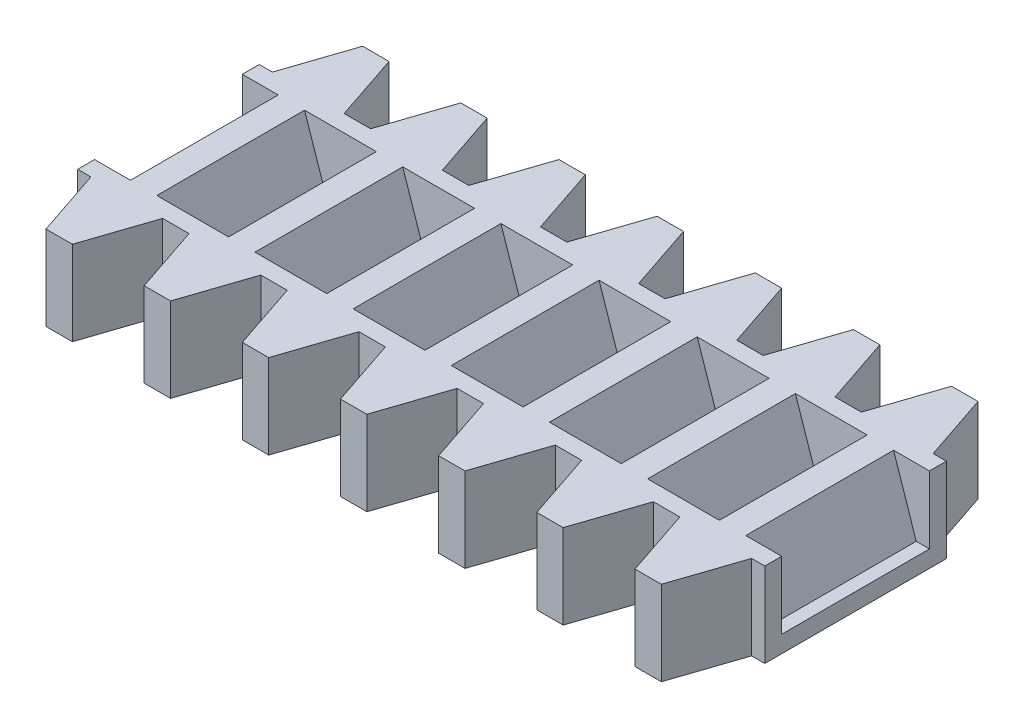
ISO-10303-21;
HEADER;
FILE_DESCRIPTION(('STEP AP214'),'2;1');
FILE_NAME('part.step','',(''),(''),'','','');
FILE_SCHEMA(('AUTOMOTIVE_DESIGN { 1 0 10303 214 1 1 1 1 }'));
ENDSEC;
DATA;
#1=APPLICATION_CONTEXT('core data for automotive mechanical design processes');
#2=APPLICATION_PROTOCOL_DEFINITION('international standard','automotive_design',2000,#1);
#3=PRODUCT_CONTEXT('',#1,'mechanical');
#4=PRODUCT('Part','Part','',(#3));
#5=PRODUCT_RELATED_PRODUCT_CATEGORY('part','',(#4));
#6=PRODUCT_DEFINITION_FORMATION('','',#4);
#7=PRODUCT_DEFINITION_CONTEXT('part definition',#1,'design');
#8=PRODUCT_DEFINITION('design','',#6,#7);
#9=PRODUCT_DEFINITION_SHAPE('','',#8);
#10=(LENGTH_UNIT() NAMED_UNIT(*) SI_UNIT(.MILLI.,.METRE.));
#11=(NAMED_UNIT(*) PLANE_ANGLE_UNIT() SI_UNIT($,.RADIAN.));
#12=(NAMED_UNIT(*) SI_UNIT($,.STERADIAN.) SOLID_ANGLE_UNIT());
#13=UNCERTAINTY_MEASURE_WITH_UNIT(LENGTH_MEASURE(1.E-05),#10,'distance_accuracy_value','');
#14=(GEOMETRIC_REPRESENTATION_CONTEXT(3) GLOBAL_UNCERTAINTY_ASSIGNED_CONTEXT((#13)) GLOBAL_UNIT_ASSIGNED_CONTEXT((#10,
#11,#12)) REPRESENTATION_CONTEXT('',''));
#15=CARTESIAN_POINT('',(0.,0.,0.));
#16=DIRECTION('',(0.,0.,1.));
#17=DIRECTION('',(1.,0.,0.));
#18=AXIS2_PLACEMENT_3D('',#15,#16,#17);
#19=CARTESIAN_POINT('',(0.,0.,0.));
#20=DIRECTION('',(0.,-1.,0.));
#21=DIRECTION('',(0.,0.,-1.));
#22=AXIS2_PLACEMENT_3D('',#19,#20,#21);
#23=PLANE('',#22);
#24=DIRECTION('',(1.,0.,0.));
#25=VECTOR('',#24,1.);
#26=CARTESIAN_POINT('',(2.325,0.,4.3));
#27=LINE('',#26,#25);
#28=CARTESIAN_POINT('',(-2.325,0.,4.3));
#29=VERTEX_POINT('',#28);
#30=CARTESIAN_POINT('',(-1.7,0.,4.3));
#31=VERTEX_POINT('',#30);
#32=EDGE_CURVE('E3038',#29,#31,#27,.T.);
#33=ORIENTED_EDGE('',*,*,#32,.F.);
#34=DIRECTION('',(0.,0.,1.));
#35=VECTOR('',#34,1.);
#36=CARTESIAN_POINT('',(-2.325,0.,4.3));
#37=LINE('',#36,#35);
#38=CARTESIAN_POINT('',(-2.325,0.,-4.3));
#39=VERTEX_POINT('',#38);
#40=EDGE_CURVE('E1464',#39,#29,#37,.T.);
#41=ORIENTED_EDGE('',*,*,#40,.F.);
#42=DIRECTION('',(-1.,0.,0.));
#43=VECTOR('',#42,1.);
#44=CARTESIAN_POINT('',(2.325,0.,-4.3));
#45=LINE('',#44,#43);
#46=CARTESIAN_POINT('',(-1.7,0.,-4.3));
#47=VERTEX_POINT('',#46);
#48=EDGE_CURVE('E1455',#47,#39,#45,.T.);
#49=ORIENTED_EDGE('',*,*,#48,.F.);
#50=DIRECTION('',(-0.318448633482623,0.,0.947940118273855));
#51=VECTOR('',#50,1.);
#52=CARTESIAN_POINT('',(-0.625,0.,-7.5));
#53=LINE('',#52,#51);
#54=CARTESIAN_POINT('',(-0.625,0.,-7.5));
#55=VERTEX_POINT('',#54);
#56=EDGE_CURVE('E3025',#55,#47,#53,.T.);
#57=ORIENTED_EDGE('',*,*,#56,.F.);
#58=DIRECTION('',(-1.,0.,0.));
#59=VECTOR('',#58,1.);
#60=CARTESIAN_POINT('',(0.625,0.,-7.5));
#61=LINE('',#60,#59);
#62=CARTESIAN_POINT('',(0.625,0.,-7.5));
#63=VERTEX_POINT('',#62);
#64=EDGE_CURVE('E3021',#63,#55,#61,.T.);
#65=ORIENTED_EDGE('',*,*,#64,.F.);
#66=DIRECTION('',(-0.318448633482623,0.,-0.947940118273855));
#67=VECTOR('',#66,1.);
#68=CARTESIAN_POINT('',(0.625,0.,-7.5));
#69=LINE('',#68,#67);
#70=CARTESIAN_POINT('',(1.7,0.,-4.3));
#71=VERTEX_POINT('',#70);
#72=EDGE_CURVE('E1538',#71,#63,#69,.T.);
#73=ORIENTED_EDGE('',*,*,#72,.F.);
#74=CARTESIAN_POINT('',(2.95,0.,-4.3));
#75=VERTEX_POINT('',#74);
#76=EDGE_CURVE('E1451',#75,#71,#45,.T.);
#77=ORIENTED_EDGE('',*,*,#76,.F.);
#78=DIRECTION('',(-0.318448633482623,0.,0.947940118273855));
#79=VECTOR('',#78,1.);
#80=CARTESIAN_POINT('',(4.025,0.,-7.5));
#81=LINE('',#80,#79);
#82=CARTESIAN_POINT('',(4.025,0.,-7.5));
#83=VERTEX_POINT('',#82);
#84=EDGE_CURVE('E1330',#83,#75,#81,.T.);
#85=ORIENTED_EDGE('',*,*,#84,.F.);
#86=DIRECTION('',(-1.,0.,0.));
#87=VECTOR('',#86,1.);
#88=CARTESIAN_POINT('',(5.275,0.,-7.5));
#89=LINE('',#88,#87);
#90=CARTESIAN_POINT('',(5.275,0.,-7.5));
#91=VERTEX_POINT('',#90);
#92=EDGE_CURVE('E1338',#91,#83,#89,.T.);
#93=ORIENTED_EDGE('',*,*,#92,.F.);
#94=DIRECTION('',(-0.318448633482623,0.,-0.947940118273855));
#95=VECTOR('',#94,1.);
#96=CARTESIAN_POINT('',(5.275,0.,-7.5));
#97=LINE('',#96,#95);
#98=CARTESIAN_POINT('',(6.35,0.,-4.3));
#99=VERTEX_POINT('',#98);
#100=EDGE_CURVE('E1325',#99,#91,#97,.T.);
#101=ORIENTED_EDGE('',*,*,#100,.F.);
#102=CARTESIAN_POINT('',(7.6,0.,-4.29999999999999));
#103=VERTEX_POINT('',#102);
#104=EDGE_CURVE('E1454',#103,#99,#45,.T.);
#105=ORIENTED_EDGE('',*,*,#104,.F.);
#106=DIRECTION('',(-0.318448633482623,0.,0.947940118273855));
#107=VECTOR('',#106,1.);
#108=CARTESIAN_POINT('',(8.675,0.,-7.5));
#109=LINE('',#108,#107);
#110=CARTESIAN_POINT('',(8.675,0.,-7.5));
#111=VERTEX_POINT('',#110);
#112=EDGE_CURVE('E1302',#111,#103,#109,.T.);
#113=ORIENTED_EDGE('',*,*,#112,.F.);
#114=DIRECTION('',(-1.,0.,0.));
#115=VECTOR('',#114,1.);
#116=CARTESIAN_POINT('',(9.925,0.,-7.49999999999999));
#117=LINE('',#116,#115);
#118=CARTESIAN_POINT('',(9.925,0.,-7.49999999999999));
#119=VERTEX_POINT('',#118);
#120=EDGE_CURVE('E1310',#119,#111,#117,.T.);
#121=ORIENTED_EDGE('',*,*,#120,.F.);
#122=DIRECTION('',(-0.318448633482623,0.,-0.947940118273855));
#123=VECTOR('',#122,1.);
#124=CARTESIAN_POINT('',(9.925,0.,-7.49999999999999));
#125=LINE('',#124,#123);
#126=CARTESIAN_POINT('',(11.,0.,-4.3));
#127=VERTEX_POINT('',#126);
#128=EDGE_CURVE('E1297',#127,#119,#125,.T.);
#129=ORIENTED_EDGE('',*,*,#128,.F.);
#130=CARTESIAN_POINT('',(12.25,0.,-4.29999999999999));
#131=VERTEX_POINT('',#130);
#132=EDGE_CURVE('E1481',#131,#127,#45,.T.);
#133=ORIENTED_EDGE('',*,*,#132,.F.);
#134=DIRECTION('',(-0.318448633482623,0.,0.947940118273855));
#135=VECTOR('',#134,1.);
#136=CARTESIAN_POINT('',(13.325,0.,-7.49999999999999));
#137=LINE('',#136,#135);
#138=CARTESIAN_POINT('',(13.325,0.,-7.49999999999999));
#139=VERTEX_POINT('',#138);
#140=EDGE_CURVE('E1274',#139,#131,#137,.T.);
#141=ORIENTED_EDGE('',*,*,#140,.F.);
#142=DIRECTION('',(-1.,0.,0.));
#143=VECTOR('',#142,1.);
#144=CARTESIAN_POINT('',(14.575,0.,-7.49999999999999));
#145=LINE('',#144,#143);
#146=CARTESIAN_POINT('',(14.575,0.,-7.49999999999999));
#147=VERTEX_POINT('',#146);
#148=EDGE_CURVE('E1282',#147,#139,#145,.T.);
#149=ORIENTED_EDGE('',*,*,#148,.F.);
#150=DIRECTION('',(-0.318448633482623,0.,-0.947940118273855));
#151=VECTOR('',#150,1.);
#152=CARTESIAN_POINT('',(14.575,0.,-7.49999999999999));
#153=LINE('',#152,#151);
#154=CARTESIAN_POINT('',(15.65,0.,-4.3));
#155=VERTEX_POINT('',#154);
#156=EDGE_CURVE('E1269',#155,#147,#153,.T.);
#157=ORIENTED_EDGE('',*,*,#156,.F.);
#158=CARTESIAN_POINT('',(16.9,0.,-4.29999999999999));
#159=VERTEX_POINT('',#158);
#160=EDGE_CURVE('E1484',#159,#155,#45,.T.);
#161=ORIENTED_EDGE('',*,*,#160,.F.);
#162=DIRECTION('',(-0.318448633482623,0.,0.947940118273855));
#163=VECTOR('',#162,1.);
#164=CARTESIAN_POINT('',(17.975,0.,-7.49999999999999));
#165=LINE('',#164,#163);
#166=CARTESIAN_POINT('',(17.975,0.,-7.49999999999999));
#167=VERTEX_POINT('',#166);
#168=EDGE_CURVE('E1246',#167,#159,#165,.T.);
#169=ORIENTED_EDGE('',*,*,#168,.F.);
#170=DIRECTION('',(-1.,0.,0.));
#171=VECTOR('',#170,1.);
#172=CARTESIAN_POINT('',(19.225,0.,-7.49999999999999));
#173=LINE('',#172,#171);
#174=CARTESIAN_POINT('',(19.225,0.,-7.49999999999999));
#175=VERTEX_POINT('',#174);
#176=EDGE_CURVE('E1254',#175,#167,#173,.T.);
#177=ORIENTED_EDGE('',*,*,#176,.F.);
#178=DIRECTION('',(-0.318448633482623,0.,-0.947940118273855));
#179=VECTOR('',#178,1.);
#180=CARTESIAN_POINT('',(19.225,0.,-7.49999999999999));
#181=LINE('',#180,#179);
#182=CARTESIAN_POINT('',(20.3,0.,-4.3));
#183=VERTEX_POINT('',#182);
#184=EDGE_CURVE('E1241',#183,#175,#181,.T.);
#185=ORIENTED_EDGE('',*,*,#184,.F.);
#186=CARTESIAN_POINT('',(21.55,0.,-4.29999999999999));
#187=VERTEX_POINT('',#186);
#188=EDGE_CURVE('E1487',#187,#183,#45,.T.);
#189=ORIENTED_EDGE('',*,*,#188,.F.);
#190=DIRECTION('',(-0.318448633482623,0.,0.947940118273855));
#191=VECTOR('',#190,1.);
#192=CARTESIAN_POINT('',(22.625,0.,-7.49999999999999));
#193=LINE('',#192,#191);
#194=CARTESIAN_POINT('',(22.625,0.,-7.49999999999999));
#195=VERTEX_POINT('',#194);
#196=EDGE_CURVE('E1218',#195,#187,#193,.T.);
#197=ORIENTED_EDGE('',*,*,#196,.F.);
#198=DIRECTION('',(-1.,0.,0.));
#199=VECTOR('',#198,1.);
#200=CARTESIAN_POINT('',(23.875,0.,-7.49999999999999));
#201=LINE('',#200,#199);
#202=CARTESIAN_POINT('',(23.875,0.,-7.49999999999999));
#203=VERTEX_POINT('',#202);
#204=EDGE_CURVE('E1226',#203,#195,#201,.T.);
#205=ORIENTED_EDGE('',*,*,#204,.F.);
#206=DIRECTION('',(-0.318448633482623,0.,-0.947940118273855));
#207=VECTOR('',#206,1.);
#208=CARTESIAN_POINT('',(23.875,0.,-7.49999999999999));
#209=LINE('',#208,#207);
#210=CARTESIAN_POINT('',(24.95,0.,-4.3));
#211=VERTEX_POINT('',#210);
#212=EDGE_CURVE('E1213',#211,#203,#209,.T.);
#213=ORIENTED_EDGE('',*,*,#212,.F.);
#214=CARTESIAN_POINT('',(26.2,0.,-4.29999999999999));
#215=VERTEX_POINT('',#214);
#216=EDGE_CURVE('E1489',#215,#211,#45,.T.);
#217=ORIENTED_EDGE('',*,*,#216,.F.);
#218=DIRECTION('',(-0.318448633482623,0.,0.947940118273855));
#219=VECTOR('',#218,1.);
#220=CARTESIAN_POINT('',(27.275,0.,-7.49999999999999));
#221=LINE('',#220,#219);
#222=CARTESIAN_POINT('',(27.275,0.,-7.49999999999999));
#223=VERTEX_POINT('',#222);
#224=EDGE_CURVE('E1190',#223,#215,#221,.T.);
#225=ORIENTED_EDGE('',*,*,#224,.F.);
#226=DIRECTION('',(-1.,0.,0.));
#227=VECTOR('',#226,1.);
#228=CARTESIAN_POINT('',(28.525,0.,-7.49999999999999));
#229=LINE('',#228,#227);
#230=CARTESIAN_POINT('',(28.525,0.,-7.49999999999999));
#231=VERTEX_POINT('',#230);
#232=EDGE_CURVE('E1198',#231,#223,#229,.T.);
#233=ORIENTED_EDGE('',*,*,#232,.F.);
#234=DIRECTION('',(-0.318448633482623,0.,-0.947940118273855));
#235=VECTOR('',#234,1.);
#236=CARTESIAN_POINT('',(28.525,0.,-7.49999999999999));
#237=LINE('',#236,#235);
#238=CARTESIAN_POINT('',(29.6,0.,-4.3));
#239=VERTEX_POINT('',#238);
#240=EDGE_CURVE('E1185',#239,#231,#237,.T.);
#241=ORIENTED_EDGE('',*,*,#240,.F.);
#242=CARTESIAN_POINT('',(30.225,0.,-4.3));
#243=VERTEX_POINT('',#242);
#244=EDGE_CURVE('E1474',#243,#239,#45,.T.);
#245=ORIENTED_EDGE('',*,*,#244,.F.);
#246=DIRECTION('',(0.,0.,-1.));
#247=VECTOR('',#246,1.);
#248=CARTESIAN_POINT('',(30.225,0.,4.3));
#249=LINE('',#248,#247);
#250=CARTESIAN_POINT('',(30.225,0.,4.3));
#251=VERTEX_POINT('',#250);
#252=EDGE_CURVE('E1353',#251,#243,#249,.T.);
#253=ORIENTED_EDGE('',*,*,#252,.F.);
#254=CARTESIAN_POINT('',(29.6,0.,4.3));
#255=VERTEX_POINT('',#254);
#256=EDGE_CURVE('E1597',#255,#251,#27,.T.);
#257=ORIENTED_EDGE('',*,*,#256,.F.);
#258=DIRECTION('',(-0.318448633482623,0.,0.947940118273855));
#259=VECTOR('',#258,1.);
#260=CARTESIAN_POINT('',(28.525,0.,7.5));
#261=LINE('',#260,#259);
#262=CARTESIAN_POINT('',(28.525,0.,7.5));
#263=VERTEX_POINT('',#262);
#264=EDGE_CURVE('E1017',#255,#263,#261,.T.);
#265=ORIENTED_EDGE('',*,*,#264,.T.);
#266=DIRECTION('',(-1.,0.,0.));
#267=VECTOR('',#266,1.);
#268=CARTESIAN_POINT('',(28.525,0.,7.5));
#269=LINE('',#268,#267);
#270=CARTESIAN_POINT('',(27.275,0.,7.50000000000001));
#271=VERTEX_POINT('',#270);
#272=EDGE_CURVE('E1022',#263,#271,#269,.T.);
#273=ORIENTED_EDGE('',*,*,#272,.T.);
#274=DIRECTION('',(-0.318448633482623,0.,-0.947940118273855));
#275=VECTOR('',#274,1.);
#276=CARTESIAN_POINT('',(27.275,0.,7.50000000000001));
#277=LINE('',#276,#275);
#278=CARTESIAN_POINT('',(26.2,0.,4.3));
#279=VERTEX_POINT('',#278);
#280=EDGE_CURVE('E1031',#271,#279,#277,.T.);
#281=ORIENTED_EDGE('',*,*,#280,.T.);
#282=CARTESIAN_POINT('',(24.95,0.,4.3));
#283=VERTEX_POINT('',#282);
#284=EDGE_CURVE('E1592',#283,#279,#27,.T.);
#285=ORIENTED_EDGE('',*,*,#284,.F.);
#286=DIRECTION('',(-0.318448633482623,0.,0.947940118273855));
#287=VECTOR('',#286,1.);
#288=CARTESIAN_POINT('',(23.875,0.,7.5));
#289=LINE('',#288,#287);
#290=CARTESIAN_POINT('',(23.875,0.,7.5));
#291=VERTEX_POINT('',#290);
#292=EDGE_CURVE('E1045',#283,#291,#289,.T.);
#293=ORIENTED_EDGE('',*,*,#292,.T.);
#294=DIRECTION('',(-1.,0.,0.));
#295=VECTOR('',#294,1.);
#296=CARTESIAN_POINT('',(23.875,0.,7.5));
#297=LINE('',#296,#295);
#298=CARTESIAN_POINT('',(22.625,0.,7.5));
#299=VERTEX_POINT('',#298);
#300=EDGE_CURVE('E1050',#291,#299,#297,.T.);
#301=ORIENTED_EDGE('',*,*,#300,.T.);
#302=DIRECTION('',(-0.318448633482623,0.,-0.947940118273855));
#303=VECTOR('',#302,1.);
#304=CARTESIAN_POINT('',(22.625,0.,7.5));
#305=LINE('',#304,#303);
#306=CARTESIAN_POINT('',(21.55,0.,4.3));
#307=VERTEX_POINT('',#306);
#308=EDGE_CURVE('E1059',#299,#307,#305,.T.);
#309=ORIENTED_EDGE('',*,*,#308,.T.);
#310=CARTESIAN_POINT('',(20.3,0.,4.3));
#311=VERTEX_POINT('',#310);
#312=EDGE_CURVE('E1587',#311,#307,#27,.T.);
#313=ORIENTED_EDGE('',*,*,#312,.F.);
#314=DIRECTION('',(-0.318448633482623,0.,0.947940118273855));
#315=VECTOR('',#314,1.);
#316=CARTESIAN_POINT('',(19.225,0.,7.5));
#317=LINE('',#316,#315);
#318=CARTESIAN_POINT('',(19.225,0.,7.5));
#319=VERTEX_POINT('',#318);
#320=EDGE_CURVE('E1073',#311,#319,#317,.T.);
#321=ORIENTED_EDGE('',*,*,#320,.T.);
#322=DIRECTION('',(-1.,0.,0.));
#323=VECTOR('',#322,1.);
#324=CARTESIAN_POINT('',(19.225,0.,7.5));
#325=LINE('',#324,#323);
#326=CARTESIAN_POINT('',(17.975,0.,7.5));
#327=VERTEX_POINT('',#326);
#328=EDGE_CURVE('E1078',#319,#327,#325,.T.);
#329=ORIENTED_EDGE('',*,*,#328,.T.);
#330=DIRECTION('',(-0.318448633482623,0.,-0.947940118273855));
#331=VECTOR('',#330,1.);
#332=CARTESIAN_POINT('',(17.975,0.,7.5));
#333=LINE('',#332,#331);
#334=CARTESIAN_POINT('',(16.9,0.,4.3));
#335=VERTEX_POINT('',#334);
#336=EDGE_CURVE('E1087',#327,#335,#333,.T.);
#337=ORIENTED_EDGE('',*,*,#336,.T.);
#338=CARTESIAN_POINT('',(15.65,0.,4.3));
#339=VERTEX_POINT('',#338);
#340=EDGE_CURVE('E1584',#339,#335,#27,.T.);
#341=ORIENTED_EDGE('',*,*,#340,.F.);
#342=DIRECTION('',(-0.318448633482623,0.,0.947940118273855));
#343=VECTOR('',#342,1.);
#344=CARTESIAN_POINT('',(14.575,0.,7.5));
#345=LINE('',#344,#343);
#346=CARTESIAN_POINT('',(14.575,0.,7.5));
#347=VERTEX_POINT('',#346);
#348=EDGE_CURVE('E1101',#339,#347,#345,.T.);
#349=ORIENTED_EDGE('',*,*,#348,.T.);
#350=DIRECTION('',(-1.,0.,0.));
#351=VECTOR('',#350,1.);
#352=CARTESIAN_POINT('',(14.575,0.,7.5));
#353=LINE('',#352,#351);
#354=CARTESIAN_POINT('',(13.325,0.,7.5));
#355=VERTEX_POINT('',#354);
#356=EDGE_CURVE('E1106',#347,#355,#353,.T.);
#357=ORIENTED_EDGE('',*,*,#356,.T.);
#358=DIRECTION('',(-0.318448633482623,0.,-0.947940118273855));
#359=VECTOR('',#358,1.);
#360=CARTESIAN_POINT('',(13.325,0.,7.5));
#361=LINE('',#360,#359);
#362=CARTESIAN_POINT('',(12.25,0.,4.3));
#363=VERTEX_POINT('',#362);
#364=EDGE_CURVE('E1115',#355,#363,#361,.T.);
#365=ORIENTED_EDGE('',*,*,#364,.T.);
#366=CARTESIAN_POINT('',(11.,0.,4.3));
#367=VERTEX_POINT('',#366);
#368=EDGE_CURVE('E1583',#367,#363,#27,.T.);
#369=ORIENTED_EDGE('',*,*,#368,.F.);
#370=DIRECTION('',(-0.318448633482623,0.,0.947940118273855));
#371=VECTOR('',#370,1.);
#372=CARTESIAN_POINT('',(9.925,0.,7.5));
#373=LINE('',#372,#371);
#374=CARTESIAN_POINT('',(9.925,0.,7.5));
#375=VERTEX_POINT('',#374);
#376=EDGE_CURVE('E1129',#367,#375,#373,.T.);
#377=ORIENTED_EDGE('',*,*,#376,.T.);
#378=DIRECTION('',(-1.,0.,0.));
#379=VECTOR('',#378,1.);
#380=CARTESIAN_POINT('',(9.925,0.,7.5));
#381=LINE('',#380,#379);
#382=CARTESIAN_POINT('',(8.675,0.,7.5));
#383=VERTEX_POINT('',#382);
#384=EDGE_CURVE('E1134',#375,#383,#381,.T.);
#385=ORIENTED_EDGE('',*,*,#384,.T.);
#386=DIRECTION('',(-0.318448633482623,0.,-0.947940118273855));
#387=VECTOR('',#386,1.);
#388=CARTESIAN_POINT('',(8.675,0.,7.5));
#389=LINE('',#388,#387);
#390=CARTESIAN_POINT('',(7.6,0.,4.3));
#391=VERTEX_POINT('',#390);
#392=EDGE_CURVE('E1143',#383,#391,#389,.T.);
#393=ORIENTED_EDGE('',*,*,#392,.T.);
#394=CARTESIAN_POINT('',(6.35,0.,4.3));
#395=VERTEX_POINT('',#394);
#396=EDGE_CURVE('E1575',#395,#391,#27,.T.);
#397=ORIENTED_EDGE('',*,*,#396,.F.);
#398=DIRECTION('',(-0.318448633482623,0.,0.947940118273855));
#399=VECTOR('',#398,1.);
#400=CARTESIAN_POINT('',(5.275,0.,7.5));
#401=LINE('',#400,#399);
#402=CARTESIAN_POINT('',(5.275,0.,7.5));
#403=VERTEX_POINT('',#402);
#404=EDGE_CURVE('E1157',#395,#403,#401,.T.);
#405=ORIENTED_EDGE('',*,*,#404,.T.);
#406=DIRECTION('',(-1.,0.,0.));
#407=VECTOR('',#406,1.);
#408=CARTESIAN_POINT('',(5.275,0.,7.5));
#409=LINE('',#408,#407);
#410=CARTESIAN_POINT('',(4.025,0.,7.5));
#411=VERTEX_POINT('',#410);
#412=EDGE_CURVE('E1162',#403,#411,#409,.T.);
#413=ORIENTED_EDGE('',*,*,#412,.T.);
#414=DIRECTION('',(-0.318448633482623,0.,-0.947940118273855));
#415=VECTOR('',#414,1.);
#416=CARTESIAN_POINT('',(4.025,0.,7.5));
#417=LINE('',#416,#415);
#418=CARTESIAN_POINT('',(2.95,0.,4.3));
#419=VERTEX_POINT('',#418);
#420=EDGE_CURVE('E1171',#411,#419,#417,.T.);
#421=ORIENTED_EDGE('',*,*,#420,.T.);
#422=CARTESIAN_POINT('',(1.7,0.,4.3));
#423=VERTEX_POINT('',#422);
#424=EDGE_CURVE('E1530',#423,#419,#27,.T.);
#425=ORIENTED_EDGE('',*,*,#424,.F.);
#426=DIRECTION('',(-0.318448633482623,0.,0.947940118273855));
#427=VECTOR('',#426,1.);
#428=CARTESIAN_POINT('',(0.625,0.,7.5));
#429=LINE('',#428,#427);
#430=CARTESIAN_POINT('',(0.625,0.,7.5));
#431=VERTEX_POINT('',#430);
#432=EDGE_CURVE('E1411',#423,#431,#429,.T.);
#433=ORIENTED_EDGE('',*,*,#432,.T.);
#434=DIRECTION('',(-1.,0.,0.));
#435=VECTOR('',#434,1.);
#436=CARTESIAN_POINT('',(0.625,0.,7.5));
#437=LINE('',#436,#435);
#438=CARTESIAN_POINT('',(-0.625,0.,7.5));
#439=VERTEX_POINT('',#438);
#440=EDGE_CURVE('E1417',#431,#439,#437,.T.);
#441=ORIENTED_EDGE('',*,*,#440,.T.);
#442=DIRECTION('',(-0.318448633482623,0.,-0.947940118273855));
#443=VECTOR('',#442,1.);
#444=CARTESIAN_POINT('',(-0.625,0.,7.5));
#445=LINE('',#444,#443);
#446=EDGE_CURVE('E1421',#439,#31,#445,.T.);
#447=ORIENTED_EDGE('',*,*,#446,.T.);
#448=EDGE_LOOP('',(#33,#41,#49,#57,#65,#73,#77,#85,#93,#101,#105,#113,#121,#129,#133,#141,#149,
#157,#161,#169,#177,#185,#189,#197,#205,#213,#217,#225,#233,#241,#245,#253,#257,#265,#273,#281,
#285,#293,#301,#309,#313,#321,#329,#337,#341,#349,#357,#365,#369,#377,#385,#393,#397,#405,#413,
#421,#425,#433,#441,#447));
#449=FACE_BOUND('',#448,.T.);
#450=DIRECTION('',(0.,0.,1.));
#451=VECTOR('',#450,1.);
#452=CARTESIAN_POINT('',(26.9,0.,-1.5));
#453=LINE('',#452,#451);
#454=CARTESIAN_POINT('',(26.9,0.,-1.5));
#455=VERTEX_POINT('',#454);
#456=CARTESIAN_POINT('',(26.9,0.,-0.5));
#457=VERTEX_POINT('',#456);
#458=EDGE_CURVE('E785',#455,#457,#453,.T.);
#459=ORIENTED_EDGE('',*,*,#458,.F.);
#460=DIRECTION('',(-1.,0.,0.));
#461=VECTOR('',#460,1.);
#462=CARTESIAN_POINT('',(26.9,0.,-1.5));
#463=LINE('',#462,#461);
#464=CARTESIAN_POINT('',(1.,0.,-1.5));
#465=VERTEX_POINT('',#464);
#466=EDGE_CURVE('E815',#455,#465,#463,.T.);
#467=ORIENTED_EDGE('',*,*,#466,.T.);
#468=DIRECTION('',(0.,0.,1.));
#469=VECTOR('',#468,1.);
#470=CARTESIAN_POINT('',(1.,0.,-1.5));
#471=LINE('',#470,#469);
#472=CARTESIAN_POINT('',(1.,0.,-0.5));
#473=VERTEX_POINT('',#472);
#474=EDGE_CURVE('E798',#465,#473,#471,.T.);
#475=ORIENTED_EDGE('',*,*,#474,.T.);
#476=DIRECTION('',(-1.,0.,0.));
#477=VECTOR('',#476,1.);
#478=CARTESIAN_POINT('',(26.9,0.,-0.5));
#479=LINE('',#478,#477);
#480=EDGE_CURVE('E812',#457,#473,#479,.T.);
#481=ORIENTED_EDGE('',*,*,#480,.F.);
#482=EDGE_LOOP('',(#459,#467,#475,#481));
#483=FACE_BOUND('',#482,.T.);
#484=DIRECTION('',(-1.,0.,0.));
#485=VECTOR('',#484,1.);
#486=CARTESIAN_POINT('',(26.9,0.,1.5));
#487=LINE('',#486,#485);
#488=CARTESIAN_POINT('',(26.9,0.,1.5));
#489=VERTEX_POINT('',#488);
#490=CARTESIAN_POINT('',(1.,0.,1.5));
#491=VERTEX_POINT('',#490);
#492=EDGE_CURVE('E743',#489,#491,#487,.T.);
#493=ORIENTED_EDGE('',*,*,#492,.F.);
#494=DIRECTION('',(0.,0.,1.));
#495=VECTOR('',#494,1.);
#496=CARTESIAN_POINT('',(26.9,0.,1.5));
#497=LINE('',#496,#495);
#498=CARTESIAN_POINT('',(26.9,0.,0.5));
#499=VERTEX_POINT('',#498);
#500=EDGE_CURVE('E732',#499,#489,#497,.T.);
#501=ORIENTED_EDGE('',*,*,#500,.F.);
#502=DIRECTION('',(-1.,0.,0.));
#503=VECTOR('',#502,1.);
#504=CARTESIAN_POINT('',(26.9,0.,0.5));
#505=LINE('',#504,#503);
#506=CARTESIAN_POINT('',(1.,0.,0.5));
#507=VERTEX_POINT('',#506);
#508=EDGE_CURVE('E776',#499,#507,#505,.T.);
#509=ORIENTED_EDGE('',*,*,#508,.T.);
#510=DIRECTION('',(0.,0.,1.));
#511=VECTOR('',#510,1.);
#512=CARTESIAN_POINT('',(1.,0.,1.5));
#513=LINE('',#512,#511);
#514=EDGE_CURVE('E760',#507,#491,#513,.T.);
#515=ORIENTED_EDGE('',*,*,#514,.T.);
#516=EDGE_LOOP('',(#493,#501,#509,#515));
#517=FACE_BOUND('',#516,.T.);
#518=ADVANCED_FACE('F34',(#449,#483,#517),#23,.T.);
#519=CARTESIAN_POINT('',(0.,4.,0.));
#520=DIRECTION('',(0.,-1.,0.));
#521=DIRECTION('',(0.,0.,-1.));
#522=AXIS2_PLACEMENT_3D('',#519,#520,#521);
#523=PLANE('',#522);
#524=DIRECTION('',(0.,0.,-1.));
#525=VECTOR('',#524,1.);
#526=CARTESIAN_POINT('',(19.225,4.,3.5));
#527=LINE('',#526,#525);
#528=CARTESIAN_POINT('',(19.225,4.,3.5));
#529=VERTEX_POINT('',#528);
#530=CARTESIAN_POINT('',(19.225,4.,-3.5));
#531=VERTEX_POINT('',#530);
#532=EDGE_CURVE('E907',#529,#531,#527,.T.);
#533=ORIENTED_EDGE('',*,*,#532,.T.);
#534=DIRECTION('',(-1.,0.,0.));
#535=VECTOR('',#534,1.);
#536=CARTESIAN_POINT('',(19.225,4.,-3.5));
#537=LINE('',#536,#535);
#538=CARTESIAN_POINT('',(22.625,4.,-3.49999999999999));
#539=VERTEX_POINT('',#538);
#540=EDGE_CURVE('E896',#539,#531,#537,.T.);
#541=ORIENTED_EDGE('',*,*,#540,.F.);
#542=DIRECTION('',(0.,0.,-1.));
#543=VECTOR('',#542,1.);
#544=CARTESIAN_POINT('',(22.625,4.,3.50000000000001));
#545=LINE('',#544,#543);
#546=CARTESIAN_POINT('',(22.625,4.,3.50000000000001));
#547=VERTEX_POINT('',#546);
#548=EDGE_CURVE('E889',#547,#539,#545,.T.);
#549=ORIENTED_EDGE('',*,*,#548,.F.);
#550=DIRECTION('',(-1.,0.,0.));
#551=VECTOR('',#550,1.);
#552=CARTESIAN_POINT('',(19.225,4.,3.5));
#553=LINE('',#552,#551);
#554=EDGE_CURVE('E904',#547,#529,#553,.T.);
#555=ORIENTED_EDGE('',*,*,#554,.T.);
#556=EDGE_LOOP('',(#533,#541,#549,#555));
#557=FACE_BOUND('',#556,.T.);
#558=DIRECTION('',(0.,0.,-1.));
#559=VECTOR('',#558,1.);
#560=CARTESIAN_POINT('',(9.925,4.,3.5));
#561=LINE('',#560,#559);
#562=CARTESIAN_POINT('',(9.925,4.,3.5));
#563=VERTEX_POINT('',#562);
#564=CARTESIAN_POINT('',(9.925,4.,-3.5));
#565=VERTEX_POINT('',#564);
#566=EDGE_CURVE('E969',#563,#565,#561,.T.);
#567=ORIENTED_EDGE('',*,*,#566,.T.);
#568=DIRECTION('',(-1.,0.,0.));
#569=VECTOR('',#568,1.);
#570=CARTESIAN_POINT('',(9.925,4.,-3.5));
#571=LINE('',#570,#569);
#572=CARTESIAN_POINT('',(13.325,4.,-3.5));
#573=VERTEX_POINT('',#572);
#574=EDGE_CURVE('E958',#573,#565,#571,.T.);
#575=ORIENTED_EDGE('',*,*,#574,.F.);
#576=DIRECTION('',(0.,0.,-1.));
#577=VECTOR('',#576,1.);
#578=CARTESIAN_POINT('',(13.325,4.,3.5));
#579=LINE('',#578,#577);
#580=CARTESIAN_POINT('',(13.325,4.,3.5));
#581=VERTEX_POINT('',#580);
#582=EDGE_CURVE('E951',#581,#573,#579,.T.);
#583=ORIENTED_EDGE('',*,*,#582,.F.);
#584=DIRECTION('',(-1.,0.,0.));
#585=VECTOR('',#584,1.);
#586=CARTESIAN_POINT('',(9.925,4.,3.5));
#587=LINE('',#586,#585);
#588=EDGE_CURVE('E966',#581,#563,#587,.T.);
#589=ORIENTED_EDGE('',*,*,#588,.T.);
#590=EDGE_LOOP('',(#567,#575,#583,#589));
#591=FACE_BOUND('',#590,.T.);
#592=DIRECTION('',(0.,0.,-1.));
#593=VECTOR('',#592,1.);
#594=CARTESIAN_POINT('',(5.275,4.,3.5));
#595=LINE('',#594,#593);
#596=CARTESIAN_POINT('',(5.275,4.,3.5));
#597=VERTEX_POINT('',#596);
#598=CARTESIAN_POINT('',(5.275,4.,-3.5));
#599=VERTEX_POINT('',#598);
#600=EDGE_CURVE('E1012',#597,#599,#595,.T.);
#601=ORIENTED_EDGE('',*,*,#600,.T.);
#602=DIRECTION('',(-1.,0.,0.));
#603=VECTOR('',#602,1.);
#604=CARTESIAN_POINT('',(5.275,4.,-3.5));
#605=LINE('',#604,#603);
#606=CARTESIAN_POINT('',(8.675,4.,-3.5));
#607=VERTEX_POINT('',#606);
#608=EDGE_CURVE('E1001',#607,#599,#605,.T.);
#609=ORIENTED_EDGE('',*,*,#608,.F.);
#610=DIRECTION('',(0.,0.,-1.));
#611=VECTOR('',#610,1.);
#612=CARTESIAN_POINT('',(8.675,4.,3.5));
#613=LINE('',#612,#611);
#614=CARTESIAN_POINT('',(8.675,4.,3.5));
#615=VERTEX_POINT('',#614);
#616=EDGE_CURVE('E994',#615,#607,#613,.T.);
#617=ORIENTED_EDGE('',*,*,#616,.F.);
#618=DIRECTION('',(-1.,0.,0.));
#619=VECTOR('',#618,1.);
#620=CARTESIAN_POINT('',(5.275,4.,3.5));
#621=LINE('',#620,#619);
#622=EDGE_CURVE('E1009',#615,#597,#621,.T.);
#623=ORIENTED_EDGE('',*,*,#622,.T.);
#624=EDGE_LOOP('',(#601,#609,#617,#623));
#625=FACE_BOUND('',#624,.T.);
#626=DIRECTION('',(0.,0.,-1.));
#627=VECTOR('',#626,1.);
#628=CARTESIAN_POINT('',(30.225,4.,4.3));
#629=LINE('',#628,#627);
#630=CARTESIAN_POINT('',(30.225,4.,4.3));
#631=VERTEX_POINT('',#630);
#632=CARTESIAN_POINT('',(30.225,4.,3.50000000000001));
#633=VERTEX_POINT('',#632);
#634=EDGE_CURVE('E1354',#631,#633,#629,.T.);
#635=ORIENTED_EDGE('',*,*,#634,.T.);
#636=DIRECTION('',(-1.,0.,0.));
#637=VECTOR('',#636,1.);
#638=CARTESIAN_POINT('',(28.525,4.,3.50000000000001));
#639=LINE('',#638,#637);
#640=CARTESIAN_POINT('',(28.525,4.,3.50000000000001));
#641=VERTEX_POINT('',#640);
#642=EDGE_CURVE('E839',#633,#641,#639,.T.);
#643=ORIENTED_EDGE('',*,*,#642,.T.);
#644=DIRECTION('',(0.,0.,-1.));
#645=VECTOR('',#644,1.);
#646=CARTESIAN_POINT('',(28.525,4.,3.50000000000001));
#647=LINE('',#646,#645);
#648=CARTESIAN_POINT('',(28.525,4.,-3.49999999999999));
#649=VERTEX_POINT('',#648);
#650=EDGE_CURVE('E842',#641,#649,#647,.T.);
#651=ORIENTED_EDGE('',*,*,#650,.T.);
#652=DIRECTION('',(-1.,0.,0.));
#653=VECTOR('',#652,1.);
#654=CARTESIAN_POINT('',(28.525,4.,-3.49999999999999));
#655=LINE('',#654,#653);
#656=CARTESIAN_POINT('',(30.225,4.,-3.49999999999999));
#657=VERTEX_POINT('',#656);
#658=EDGE_CURVE('E828',#657,#649,#655,.T.);
#659=ORIENTED_EDGE('',*,*,#658,.F.);
#660=CARTESIAN_POINT('',(30.225,4.,-4.3));
#661=VERTEX_POINT('',#660);
#662=EDGE_CURVE('E1358',#657,#661,#629,.T.);
#663=ORIENTED_EDGE('',*,*,#662,.T.);
#664=DIRECTION('',(-1.,0.,0.));
#665=VECTOR('',#664,1.);
#666=CARTESIAN_POINT('',(2.325,4.,-4.3));
#667=LINE('',#666,#665);
#668=CARTESIAN_POINT('',(29.6,4.,-4.3));
#669=VERTEX_POINT('',#668);
#670=EDGE_CURVE('E1506',#661,#669,#667,.T.);
#671=ORIENTED_EDGE('',*,*,#670,.T.);
#672=DIRECTION('',(-0.318448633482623,0.,-0.947940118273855));
#673=VECTOR('',#672,1.);
#674=CARTESIAN_POINT('',(28.525,4.,-7.49999999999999));
#675=LINE('',#674,#673);
#676=CARTESIAN_POINT('',(28.525,4.,-7.49999999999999));
#677=VERTEX_POINT('',#676);
#678=EDGE_CURVE('E1186',#669,#677,#675,.T.);
#679=ORIENTED_EDGE('',*,*,#678,.T.);
#680=DIRECTION('',(-1.,0.,0.));
#681=VECTOR('',#680,1.);
#682=CARTESIAN_POINT('',(28.525,4.,-7.49999999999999));
#683=LINE('',#682,#681);
#684=CARTESIAN_POINT('',(27.275,4.,-7.49999999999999));
#685=VERTEX_POINT('',#684);
#686=EDGE_CURVE('E1189',#677,#685,#683,.T.);
#687=ORIENTED_EDGE('',*,*,#686,.T.);
#688=DIRECTION('',(-0.318448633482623,0.,0.947940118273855));
#689=VECTOR('',#688,1.);
#690=CARTESIAN_POINT('',(27.275,4.,-7.49999999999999));
#691=LINE('',#690,#689);
#692=CARTESIAN_POINT('',(26.2,4.,-4.3));
#693=VERTEX_POINT('',#692);
#694=EDGE_CURVE('E1192',#685,#693,#691,.T.);
#695=ORIENTED_EDGE('',*,*,#694,.T.);
#696=CARTESIAN_POINT('',(24.95,4.,-4.3));
#697=VERTEX_POINT('',#696);
#698=EDGE_CURVE('E1492',#693,#697,#667,.T.);
#699=ORIENTED_EDGE('',*,*,#698,.T.);
#700=DIRECTION('',(-0.318448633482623,0.,-0.947940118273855));
#701=VECTOR('',#700,1.);
#702=CARTESIAN_POINT('',(23.875,4.,-7.49999999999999));
#703=LINE('',#702,#701);
#704=CARTESIAN_POINT('',(23.875,4.,-7.49999999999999));
#705=VERTEX_POINT('',#704);
#706=EDGE_CURVE('E1214',#697,#705,#703,.T.);
#707=ORIENTED_EDGE('',*,*,#706,.T.);
#708=DIRECTION('',(-1.,0.,0.));
#709=VECTOR('',#708,1.);
#710=CARTESIAN_POINT('',(23.875,4.,-7.49999999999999));
#711=LINE('',#710,#709);
#712=CARTESIAN_POINT('',(22.625,4.,-7.49999999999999));
#713=VERTEX_POINT('',#712);
#714=EDGE_CURVE('E1217',#705,#713,#711,.T.);
#715=ORIENTED_EDGE('',*,*,#714,.T.);
#716=DIRECTION('',(-0.318448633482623,0.,0.947940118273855));
#717=VECTOR('',#716,1.);
#718=CARTESIAN_POINT('',(22.625,4.,-7.49999999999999));
#719=LINE('',#718,#717);
#720=CARTESIAN_POINT('',(21.55,4.,-4.3));
#721=VERTEX_POINT('',#720);
#722=EDGE_CURVE('E1220',#713,#721,#719,.T.);
#723=ORIENTED_EDGE('',*,*,#722,.T.);
#724=CARTESIAN_POINT('',(20.3,4.,-4.3));
#725=VERTEX_POINT('',#724);
#726=EDGE_CURVE('E1491',#721,#725,#667,.T.);
#727=ORIENTED_EDGE('',*,*,#726,.T.);
#728=DIRECTION('',(-0.318448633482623,0.,-0.947940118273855));
#729=VECTOR('',#728,1.);
#730=CARTESIAN_POINT('',(19.225,4.,-7.49999999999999));
#731=LINE('',#730,#729);
#732=CARTESIAN_POINT('',(19.225,4.,-7.49999999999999));
#733=VERTEX_POINT('',#732);
#734=EDGE_CURVE('E1242',#725,#733,#731,.T.);
#735=ORIENTED_EDGE('',*,*,#734,.T.);
#736=DIRECTION('',(-1.,0.,0.));
#737=VECTOR('',#736,1.);
#738=CARTESIAN_POINT('',(19.225,4.,-7.49999999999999));
#739=LINE('',#738,#737);
#740=CARTESIAN_POINT('',(17.975,4.,-7.49999999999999));
#741=VERTEX_POINT('',#740);
#742=EDGE_CURVE('E1245',#733,#741,#739,.T.);
#743=ORIENTED_EDGE('',*,*,#742,.T.);
#744=DIRECTION('',(-0.318448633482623,0.,0.947940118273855));
#745=VECTOR('',#744,1.);
#746=CARTESIAN_POINT('',(17.975,4.,-7.49999999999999));
#747=LINE('',#746,#745);
#748=CARTESIAN_POINT('',(16.9,4.,-4.3));
#749=VERTEX_POINT('',#748);
#750=EDGE_CURVE('E1248',#741,#749,#747,.T.);
#751=ORIENTED_EDGE('',*,*,#750,.T.);
#752=CARTESIAN_POINT('',(15.65,4.,-4.3));
#753=VERTEX_POINT('',#752);
#754=EDGE_CURVE('E1490',#749,#753,#667,.T.);
#755=ORIENTED_EDGE('',*,*,#754,.T.);
#756=DIRECTION('',(-0.318448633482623,0.,-0.947940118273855));
#757=VECTOR('',#756,1.);
#758=CARTESIAN_POINT('',(14.575,4.,-7.49999999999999));
#759=LINE('',#758,#757);
#760=CARTESIAN_POINT('',(14.575,4.,-7.49999999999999));
#761=VERTEX_POINT('',#760);
#762=EDGE_CURVE('E1270',#753,#761,#759,.T.);
#763=ORIENTED_EDGE('',*,*,#762,.T.);
#764=DIRECTION('',(-1.,0.,0.));
#765=VECTOR('',#764,1.);
#766=CARTESIAN_POINT('',(14.575,4.,-7.49999999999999));
#767=LINE('',#766,#765);
#768=CARTESIAN_POINT('',(13.325,4.,-7.49999999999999));
#769=VERTEX_POINT('',#768);
#770=EDGE_CURVE('E1273',#761,#769,#767,.T.);
#771=ORIENTED_EDGE('',*,*,#770,.T.);
#772=DIRECTION('',(-0.318448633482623,0.,0.947940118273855));
#773=VECTOR('',#772,1.);
#774=CARTESIAN_POINT('',(13.325,4.,-7.49999999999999));
#775=LINE('',#774,#773);
#776=CARTESIAN_POINT('',(12.25,4.,-4.3));
#777=VERTEX_POINT('',#776);
#778=EDGE_CURVE('E1276',#769,#777,#775,.T.);
#779=ORIENTED_EDGE('',*,*,#778,.T.);
#780=CARTESIAN_POINT('',(11.,4.,-4.3));
#781=VERTEX_POINT('',#780);
#782=EDGE_CURVE('E1511',#777,#781,#667,.T.);
#783=ORIENTED_EDGE('',*,*,#782,.T.);
#784=DIRECTION('',(-0.318448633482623,0.,-0.947940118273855));
#785=VECTOR('',#784,1.);
#786=CARTESIAN_POINT('',(9.925,4.,-7.49999999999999));
#787=LINE('',#786,#785);
#788=CARTESIAN_POINT('',(9.925,4.,-7.49999999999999));
#789=VERTEX_POINT('',#788);
#790=EDGE_CURVE('E1298',#781,#789,#787,.T.);
#791=ORIENTED_EDGE('',*,*,#790,.T.);
#792=DIRECTION('',(-1.,0.,0.));
#793=VECTOR('',#792,1.);
#794=CARTESIAN_POINT('',(9.925,4.,-7.49999999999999));
#795=LINE('',#794,#793);
#796=CARTESIAN_POINT('',(8.675,4.,-7.5));
#797=VERTEX_POINT('',#796);
#798=EDGE_CURVE('E1301',#789,#797,#795,.T.);
#799=ORIENTED_EDGE('',*,*,#798,.T.);
#800=DIRECTION('',(-0.318448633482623,0.,0.947940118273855));
#801=VECTOR('',#800,1.);
#802=CARTESIAN_POINT('',(8.675,4.,-7.5));
#803=LINE('',#802,#801);
#804=CARTESIAN_POINT('',(7.6,4.,-4.3));
#805=VERTEX_POINT('',#804);
#806=EDGE_CURVE('E1304',#797,#805,#803,.T.);
#807=ORIENTED_EDGE('',*,*,#806,.T.);
#808=CARTESIAN_POINT('',(6.35,4.,-4.3));
#809=VERTEX_POINT('',#808);
#810=EDGE_CURVE('E1509',#805,#809,#667,.T.);
#811=ORIENTED_EDGE('',*,*,#810,.T.);
#812=DIRECTION('',(-0.318448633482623,0.,-0.947940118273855));
#813=VECTOR('',#812,1.);
#814=CARTESIAN_POINT('',(5.275,4.,-7.5));
#815=LINE('',#814,#813);
#816=CARTESIAN_POINT('',(5.275,4.,-7.5));
#817=VERTEX_POINT('',#816);
#818=EDGE_CURVE('E1326',#809,#817,#815,.T.);
#819=ORIENTED_EDGE('',*,*,#818,.T.);
#820=DIRECTION('',(-1.,0.,0.));
#821=VECTOR('',#820,1.);
#822=CARTESIAN_POINT('',(5.275,4.,-7.5));
#823=LINE('',#822,#821);
#824=CARTESIAN_POINT('',(4.025,4.,-7.5));
#825=VERTEX_POINT('',#824);
#826=EDGE_CURVE('E1329',#817,#825,#823,.T.);
#827=ORIENTED_EDGE('',*,*,#826,.T.);
#828=DIRECTION('',(-0.318448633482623,0.,0.947940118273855));
#829=VECTOR('',#828,1.);
#830=CARTESIAN_POINT('',(4.025,4.,-7.5));
#831=LINE('',#830,#829);
#832=CARTESIAN_POINT('',(2.95,4.,-4.3));
#833=VERTEX_POINT('',#832);
#834=EDGE_CURVE('E1332',#825,#833,#831,.T.);
#835=ORIENTED_EDGE('',*,*,#834,.T.);
#836=CARTESIAN_POINT('',(1.7,4.,-4.3));
#837=VERTEX_POINT('',#836);
#838=EDGE_CURVE('E1456',#833,#837,#667,.T.);
#839=ORIENTED_EDGE('',*,*,#838,.T.);
#840=DIRECTION('',(-0.318448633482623,0.,-0.947940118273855));
#841=VECTOR('',#840,1.);
#842=CARTESIAN_POINT('',(0.625,4.,-7.5));
#843=LINE('',#842,#841);
#844=CARTESIAN_POINT('',(0.625,4.,-7.5));
#845=VERTEX_POINT('',#844);
#846=EDGE_CURVE('E3016',#837,#845,#843,.T.);
#847=ORIENTED_EDGE('',*,*,#846,.T.);
#848=DIRECTION('',(-1.,0.,0.));
#849=VECTOR('',#848,1.);
#850=CARTESIAN_POINT('',(0.625,4.,-7.5));
#851=LINE('',#850,#849);
#852=CARTESIAN_POINT('',(-0.625,4.,-7.5));
#853=VERTEX_POINT('',#852);
#854=EDGE_CURVE('E3010',#845,#853,#851,.T.);
#855=ORIENTED_EDGE('',*,*,#854,.T.);
#856=DIRECTION('',(-0.318448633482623,0.,0.947940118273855));
#857=VECTOR('',#856,1.);
#858=CARTESIAN_POINT('',(-0.625,4.,-7.5));
#859=LINE('',#858,#857);
#860=CARTESIAN_POINT('',(-1.7,4.,-4.3));
#861=VERTEX_POINT('',#860);
#862=EDGE_CURVE('E3006',#853,#861,#859,.T.);
#863=ORIENTED_EDGE('',*,*,#862,.T.);
#864=CARTESIAN_POINT('',(-2.325,4.,-4.3));
#865=VERTEX_POINT('',#864);
#866=EDGE_CURVE('E1502',#861,#865,#667,.T.);
#867=ORIENTED_EDGE('',*,*,#866,.T.);
#868=DIRECTION('',(0.,0.,1.));
#869=VECTOR('',#868,1.);
#870=CARTESIAN_POINT('',(-2.325,4.,4.3));
#871=LINE('',#870,#869);
#872=CARTESIAN_POINT('',(-2.325,4.,-3.5));
#873=VERTEX_POINT('',#872);
#874=EDGE_CURVE('E1498',#865,#873,#871,.T.);
#875=ORIENTED_EDGE('',*,*,#874,.T.);
#876=DIRECTION('',(-1.,0.,0.));
#877=VECTOR('',#876,1.);
#878=CARTESIAN_POINT('',(-0.625,4.,-3.5));
#879=LINE('',#878,#877);
#880=CARTESIAN_POINT('',(-0.625,4.,-3.5));
#881=VERTEX_POINT('',#880);
#882=EDGE_CURVE('E1368',#881,#873,#879,.T.);
#883=ORIENTED_EDGE('',*,*,#882,.F.);
#884=DIRECTION('',(0.,0.,-1.));
#885=VECTOR('',#884,1.);
#886=CARTESIAN_POINT('',(-0.625,4.,3.5));
#887=LINE('',#886,#885);
#888=CARTESIAN_POINT('',(-0.625,4.,3.5));
#889=VERTEX_POINT('',#888);
#890=EDGE_CURVE('E1391',#889,#881,#887,.T.);
#891=ORIENTED_EDGE('',*,*,#890,.F.);
#892=DIRECTION('',(-1.,0.,0.));
#893=VECTOR('',#892,1.);
#894=CARTESIAN_POINT('',(-0.625,4.,3.5));
#895=LINE('',#894,#893);
#896=CARTESIAN_POINT('',(-2.325,4.,3.5));
#897=VERTEX_POINT('',#896);
#898=EDGE_CURVE('E1378',#889,#897,#895,.T.);
#899=ORIENTED_EDGE('',*,*,#898,.T.);
#900=CARTESIAN_POINT('',(-2.325,4.,4.3));
#901=VERTEX_POINT('',#900);
#902=EDGE_CURVE('E2959',#897,#901,#871,.T.);
#903=ORIENTED_EDGE('',*,*,#902,.T.);
#904=DIRECTION('',(1.,0.,0.));
#905=VECTOR('',#904,1.);
#906=CARTESIAN_POINT('',(2.325,4.,4.3));
#907=LINE('',#906,#905);
#908=CARTESIAN_POINT('',(-1.7,4.,4.3));
#909=VERTEX_POINT('',#908);
#910=EDGE_CURVE('E1517',#901,#909,#907,.T.);
#911=ORIENTED_EDGE('',*,*,#910,.T.);
#912=DIRECTION('',(-0.318448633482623,0.,-0.947940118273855));
#913=VECTOR('',#912,1.);
#914=CARTESIAN_POINT('',(-0.625,4.,7.5));
#915=LINE('',#914,#913);
#916=CARTESIAN_POINT('',(-0.625,4.,7.5));
#917=VERTEX_POINT('',#916);
#918=EDGE_CURVE('E1416',#917,#909,#915,.T.);
#919=ORIENTED_EDGE('',*,*,#918,.F.);
#920=DIRECTION('',(-1.,0.,0.));
#921=VECTOR('',#920,1.);
#922=CARTESIAN_POINT('',(0.625,4.,7.5));
#923=LINE('',#922,#921);
#924=CARTESIAN_POINT('',(0.625,4.,7.5));
#925=VERTEX_POINT('',#924);
#926=EDGE_CURVE('E1412',#925,#917,#923,.T.);
#927=ORIENTED_EDGE('',*,*,#926,.F.);
#928=DIRECTION('',(-0.318448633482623,0.,0.947940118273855));
#929=VECTOR('',#928,1.);
#930=CARTESIAN_POINT('',(0.625,4.,7.5));
#931=LINE('',#930,#929);
#932=CARTESIAN_POINT('',(1.7,4.,4.3));
#933=VERTEX_POINT('',#932);
#934=EDGE_CURVE('E1420',#933,#925,#931,.T.);
#935=ORIENTED_EDGE('',*,*,#934,.F.);
#936=CARTESIAN_POINT('',(2.95,4.,4.3));
#937=VERTEX_POINT('',#936);
#938=EDGE_CURVE('E1522',#933,#937,#907,.T.);
#939=ORIENTED_EDGE('',*,*,#938,.T.);
#940=DIRECTION('',(-0.318448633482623,0.,-0.947940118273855));
#941=VECTOR('',#940,1.);
#942=CARTESIAN_POINT('',(4.025,4.,7.5));
#943=LINE('',#942,#941);
#944=CARTESIAN_POINT('',(4.025,4.,7.5));
#945=VERTEX_POINT('',#944);
#946=EDGE_CURVE('E1161',#945,#937,#943,.T.);
#947=ORIENTED_EDGE('',*,*,#946,.F.);
#948=DIRECTION('',(-1.,0.,0.));
#949=VECTOR('',#948,1.);
#950=CARTESIAN_POINT('',(5.275,4.,7.5));
#951=LINE('',#950,#949);
#952=CARTESIAN_POINT('',(5.275,4.,7.5));
#953=VERTEX_POINT('',#952);
#954=EDGE_CURVE('E1165',#953,#945,#951,.T.);
#955=ORIENTED_EDGE('',*,*,#954,.F.);
#956=DIRECTION('',(-0.318448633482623,0.,0.947940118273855));
#957=VECTOR('',#956,1.);
#958=CARTESIAN_POINT('',(5.275,4.,7.5));
#959=LINE('',#958,#957);
#960=CARTESIAN_POINT('',(6.35,4.,4.3));
#961=VERTEX_POINT('',#960);
#962=EDGE_CURVE('E1158',#961,#953,#959,.T.);
#963=ORIENTED_EDGE('',*,*,#962,.F.);
#964=CARTESIAN_POINT('',(7.6,4.,4.3));
#965=VERTEX_POINT('',#964);
#966=EDGE_CURVE('E1527',#961,#965,#907,.T.);
#967=ORIENTED_EDGE('',*,*,#966,.T.);
#968=DIRECTION('',(-0.318448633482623,0.,-0.947940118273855));
#969=VECTOR('',#968,1.);
#970=CARTESIAN_POINT('',(8.675,4.,7.5));
#971=LINE('',#970,#969);
#972=CARTESIAN_POINT('',(8.675,4.,7.5));
#973=VERTEX_POINT('',#972);
#974=EDGE_CURVE('E1133',#973,#965,#971,.T.);
#975=ORIENTED_EDGE('',*,*,#974,.F.);
#976=DIRECTION('',(-1.,0.,0.));
#977=VECTOR('',#976,1.);
#978=CARTESIAN_POINT('',(9.925,4.,7.5));
#979=LINE('',#978,#977);
#980=CARTESIAN_POINT('',(9.925,4.,7.5));
#981=VERTEX_POINT('',#980);
#982=EDGE_CURVE('E1137',#981,#973,#979,.T.);
#983=ORIENTED_EDGE('',*,*,#982,.F.);
#984=DIRECTION('',(-0.318448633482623,0.,0.947940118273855));
#985=VECTOR('',#984,1.);
#986=CARTESIAN_POINT('',(9.925,4.,7.5));
#987=LINE('',#986,#985);
#988=CARTESIAN_POINT('',(11.,4.,4.3));
#989=VERTEX_POINT('',#988);
#990=EDGE_CURVE('E1130',#989,#981,#987,.T.);
#991=ORIENTED_EDGE('',*,*,#990,.F.);
#992=CARTESIAN_POINT('',(12.25,4.,4.3));
#993=VERTEX_POINT('',#992);
#994=EDGE_CURVE('E1576',#989,#993,#907,.T.);
#995=ORIENTED_EDGE('',*,*,#994,.T.);
#996=DIRECTION('',(-0.318448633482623,0.,-0.947940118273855));
#997=VECTOR('',#996,1.);
#998=CARTESIAN_POINT('',(13.325,4.,7.5));
#999=LINE('',#998,#997);
#1000=CARTESIAN_POINT('',(13.325,4.,7.5));
#1001=VERTEX_POINT('',#1000);
#1002=EDGE_CURVE('E1105',#1001,#993,#999,.T.);
#1003=ORIENTED_EDGE('',*,*,#1002,.F.);
#1004=DIRECTION('',(-1.,0.,0.));
#1005=VECTOR('',#1004,1.);
#1006=CARTESIAN_POINT('',(14.575,4.,7.5));
#1007=LINE('',#1006,#1005);
#1008=CARTESIAN_POINT('',(14.575,4.,7.5));
#1009=VERTEX_POINT('',#1008);
#1010=EDGE_CURVE('E1109',#1009,#1001,#1007,.T.);
#1011=ORIENTED_EDGE('',*,*,#1010,.F.);
#1012=DIRECTION('',(-0.318448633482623,0.,0.947940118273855));
#1013=VECTOR('',#1012,1.);
#1014=CARTESIAN_POINT('',(14.575,4.,7.5));
#1015=LINE('',#1014,#1013);
#1016=CARTESIAN_POINT('',(15.65,4.,4.3));
#1017=VERTEX_POINT('',#1016);
#1018=EDGE_CURVE('E1102',#1017,#1009,#1015,.T.);
#1019=ORIENTED_EDGE('',*,*,#1018,.F.);
#1020=CARTESIAN_POINT('',(16.9,4.,4.3));
#1021=VERTEX_POINT('',#1020);
#1022=EDGE_CURVE('E1579',#1017,#1021,#907,.T.);
#1023=ORIENTED_EDGE('',*,*,#1022,.T.);
#1024=DIRECTION('',(-0.318448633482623,0.,-0.947940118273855));
#1025=VECTOR('',#1024,1.);
#1026=CARTESIAN_POINT('',(17.975,4.,7.5));
#1027=LINE('',#1026,#1025);
#1028=CARTESIAN_POINT('',(17.975,4.,7.5));
#1029=VERTEX_POINT('',#1028);
#1030=EDGE_CURVE('E1077',#1029,#1021,#1027,.T.);
#1031=ORIENTED_EDGE('',*,*,#1030,.F.);
#1032=DIRECTION('',(-1.,0.,0.));
#1033=VECTOR('',#1032,1.);
#1034=CARTESIAN_POINT('',(19.225,4.,7.5));
#1035=LINE('',#1034,#1033);
#1036=CARTESIAN_POINT('',(19.225,4.,7.5));
#1037=VERTEX_POINT('',#1036);
#1038=EDGE_CURVE('E1081',#1037,#1029,#1035,.T.);
#1039=ORIENTED_EDGE('',*,*,#1038,.F.);
#1040=DIRECTION('',(-0.318448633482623,0.,0.947940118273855));
#1041=VECTOR('',#1040,1.);
#1042=CARTESIAN_POINT('',(19.225,4.,7.5));
#1043=LINE('',#1042,#1041);
#1044=CARTESIAN_POINT('',(20.3,4.,4.3));
#1045=VERTEX_POINT('',#1044);
#1046=EDGE_CURVE('E1074',#1045,#1037,#1043,.T.);
#1047=ORIENTED_EDGE('',*,*,#1046,.F.);
#1048=CARTESIAN_POINT('',(21.55,4.,4.3));
#1049=VERTEX_POINT('',#1048);
#1050=EDGE_CURVE('E1590',#1045,#1049,#907,.T.);
#1051=ORIENTED_EDGE('',*,*,#1050,.T.);
#1052=DIRECTION('',(-0.318448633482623,0.,-0.947940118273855));
#1053=VECTOR('',#1052,1.);
#1054=CARTESIAN_POINT('',(22.625,4.,7.5));
#1055=LINE('',#1054,#1053);
#1056=CARTESIAN_POINT('',(22.625,4.,7.5));
#1057=VERTEX_POINT('',#1056);
#1058=EDGE_CURVE('E1049',#1057,#1049,#1055,.T.);
#1059=ORIENTED_EDGE('',*,*,#1058,.F.);
#1060=DIRECTION('',(-1.,0.,0.));
#1061=VECTOR('',#1060,1.);
#1062=CARTESIAN_POINT('',(23.875,4.,7.5));
#1063=LINE('',#1062,#1061);
#1064=CARTESIAN_POINT('',(23.875,4.,7.5));
#1065=VERTEX_POINT('',#1064);
#1066=EDGE_CURVE('E1053',#1065,#1057,#1063,.T.);
#1067=ORIENTED_EDGE('',*,*,#1066,.F.);
#1068=DIRECTION('',(-0.318448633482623,0.,0.947940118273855));
#1069=VECTOR('',#1068,1.);
#1070=CARTESIAN_POINT('',(23.875,4.,7.5));
#1071=LINE('',#1070,#1069);
#1072=CARTESIAN_POINT('',(24.95,4.,4.3));
#1073=VERTEX_POINT('',#1072);
#1074=EDGE_CURVE('E1046',#1073,#1065,#1071,.T.);
#1075=ORIENTED_EDGE('',*,*,#1074,.F.);
#1076=CARTESIAN_POINT('',(26.2,4.,4.3));
#1077=VERTEX_POINT('',#1076);
#1078=EDGE_CURVE('E1595',#1073,#1077,#907,.T.);
#1079=ORIENTED_EDGE('',*,*,#1078,.T.);
#1080=DIRECTION('',(-0.318448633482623,0.,-0.947940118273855));
#1081=VECTOR('',#1080,1.);
#1082=CARTESIAN_POINT('',(27.275,4.,7.50000000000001));
#1083=LINE('',#1082,#1081);
#1084=CARTESIAN_POINT('',(27.275,4.,7.50000000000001));
#1085=VERTEX_POINT('',#1084);
#1086=EDGE_CURVE('E1021',#1085,#1077,#1083,.T.);
#1087=ORIENTED_EDGE('',*,*,#1086,.F.);
#1088=DIRECTION('',(-1.,0.,0.));
#1089=VECTOR('',#1088,1.);
#1090=CARTESIAN_POINT('',(28.525,4.,7.5));
#1091=LINE('',#1090,#1089);
#1092=CARTESIAN_POINT('',(28.525,4.,7.5));
#1093=VERTEX_POINT('',#1092);
#1094=EDGE_CURVE('E1025',#1093,#1085,#1091,.T.);
#1095=ORIENTED_EDGE('',*,*,#1094,.F.);
#1096=DIRECTION('',(-0.318448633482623,0.,0.947940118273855));
#1097=VECTOR('',#1096,1.);
#1098=CARTESIAN_POINT('',(28.525,4.,7.5));
#1099=LINE('',#1098,#1097);
#1100=CARTESIAN_POINT('',(29.6,4.,4.3));
#1101=VERTEX_POINT('',#1100);
#1102=EDGE_CURVE('E1018',#1101,#1093,#1099,.T.);
#1103=ORIENTED_EDGE('',*,*,#1102,.F.);
#1104=EDGE_CURVE('E1600',#1101,#631,#907,.T.);
#1105=ORIENTED_EDGE('',*,*,#1104,.T.);
#1106=EDGE_LOOP('',(#635,#643,#651,#659,#663,#671,#679,#687,#695,#699,#707,#715,#723,#727,#735,
#743,#751,#755,#763,#771,#779,#783,#791,#799,#807,#811,#819,#827,#835,#839,#847,#855,#863,#867,
#875,#883,#891,#899,#903,#911,#919,#927,#935,#939,#947,#955,#963,#967,#975,#983,#991,#995,#1003,
#1011,#1019,#1023,#1031,#1039,#1047,#1051,#1059,#1067,#1075,#1079,#1087,#1095,#1103,#1105));
#1107=FACE_BOUND('',#1106,.T.);
#1108=DIRECTION('',(0.,0.,-1.));
#1109=VECTOR('',#1108,1.);
#1110=CARTESIAN_POINT('',(4.025,4.,3.5));
#1111=LINE('',#1110,#1109);
#1112=CARTESIAN_POINT('',(4.025,4.,3.5));
#1113=VERTEX_POINT('',#1112);
#1114=CARTESIAN_POINT('',(4.025,4.,-3.5));
#1115=VERTEX_POINT('',#1114);
#1116=EDGE_CURVE('E983',#1113,#1115,#1111,.T.);
#1117=ORIENTED_EDGE('',*,*,#1116,.F.);
#1118=DIRECTION('',(-1.,0.,0.));
#1119=VECTOR('',#1118,1.);
#1120=CARTESIAN_POINT('',(0.625,4.,3.5));
#1121=LINE('',#1120,#1119);
#1122=CARTESIAN_POINT('',(0.625,4.,3.5));
#1123=VERTEX_POINT('',#1122);
#1124=EDGE_CURVE('E1405',#1113,#1123,#1121,.T.);
#1125=ORIENTED_EDGE('',*,*,#1124,.T.);
#1126=DIRECTION('',(0.,0.,-1.));
#1127=VECTOR('',#1126,1.);
#1128=CARTESIAN_POINT('',(0.625,4.,3.5));
#1129=LINE('',#1128,#1127);
#1130=CARTESIAN_POINT('',(0.625,4.,-3.5));
#1131=VERTEX_POINT('',#1130);
#1132=EDGE_CURVE('E1406',#1123,#1131,#1129,.T.);
#1133=ORIENTED_EDGE('',*,*,#1132,.T.);
#1134=DIRECTION('',(-1.,0.,0.));
#1135=VECTOR('',#1134,1.);
#1136=CARTESIAN_POINT('',(0.625,4.,-3.5));
#1137=LINE('',#1136,#1135);
#1138=EDGE_CURVE('E1399',#1115,#1131,#1137,.T.);
#1139=ORIENTED_EDGE('',*,*,#1138,.F.);
#1140=EDGE_LOOP('',(#1117,#1125,#1133,#1139));
#1141=FACE_BOUND('',#1140,.T.);
#1142=DIRECTION('',(0.,0.,-1.));
#1143=VECTOR('',#1142,1.);
#1144=CARTESIAN_POINT('',(14.575,4.,3.5));
#1145=LINE('',#1144,#1143);
#1146=CARTESIAN_POINT('',(14.575,4.,3.5));
#1147=VERTEX_POINT('',#1146);
#1148=CARTESIAN_POINT('',(14.575,4.,-3.5));
#1149=VERTEX_POINT('',#1148);
#1150=EDGE_CURVE('E938',#1147,#1149,#1145,.T.);
#1151=ORIENTED_EDGE('',*,*,#1150,.T.);
#1152=DIRECTION('',(-1.,0.,0.));
#1153=VECTOR('',#1152,1.);
#1154=CARTESIAN_POINT('',(14.575,4.,-3.5));
#1155=LINE('',#1154,#1153);
#1156=CARTESIAN_POINT('',(17.975,4.,-3.5));
#1157=VERTEX_POINT('',#1156);
#1158=EDGE_CURVE('E927',#1157,#1149,#1155,.T.);
#1159=ORIENTED_EDGE('',*,*,#1158,.F.);
#1160=DIRECTION('',(0.,0.,-1.));
#1161=VECTOR('',#1160,1.);
#1162=CARTESIAN_POINT('',(17.975,4.,3.5));
#1163=LINE('',#1162,#1161);
#1164=CARTESIAN_POINT('',(17.975,4.,3.50000000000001));
#1165=VERTEX_POINT('',#1164);
#1166=EDGE_CURVE('E920',#1165,#1157,#1163,.T.);
#1167=ORIENTED_EDGE('',*,*,#1166,.F.);
#1168=DIRECTION('',(-1.,0.,0.));
#1169=VECTOR('',#1168,1.);
#1170=CARTESIAN_POINT('',(14.575,4.,3.5));
#1171=LINE('',#1170,#1169);
#1172=EDGE_CURVE('E935',#1165,#1147,#1171,.T.);
#1173=ORIENTED_EDGE('',*,*,#1172,.T.);
#1174=EDGE_LOOP('',(#1151,#1159,#1167,#1173));
#1175=FACE_BOUND('',#1174,.T.);
#1176=DIRECTION('',(0.,0.,-1.));
#1177=VECTOR('',#1176,1.);
#1178=CARTESIAN_POINT('',(23.875,4.,3.50000000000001));
#1179=LINE('',#1178,#1177);
#1180=CARTESIAN_POINT('',(23.875,4.,3.50000000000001));
#1181=VERTEX_POINT('',#1180);
#1182=CARTESIAN_POINT('',(23.875,4.,-3.49999999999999));
#1183=VERTEX_POINT('',#1182);
#1184=EDGE_CURVE('E876',#1181,#1183,#1179,.T.);
#1185=ORIENTED_EDGE('',*,*,#1184,.T.);
#1186=DIRECTION('',(-1.,0.,0.));
#1187=VECTOR('',#1186,1.);
#1188=CARTESIAN_POINT('',(23.875,4.,-3.49999999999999));
#1189=LINE('',#1188,#1187);
#1190=CARTESIAN_POINT('',(27.275,4.,-3.49999999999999));
#1191=VERTEX_POINT('',#1190);
#1192=EDGE_CURVE('E865',#1191,#1183,#1189,.T.);
#1193=ORIENTED_EDGE('',*,*,#1192,.F.);
#1194=DIRECTION('',(0.,0.,-1.));
#1195=VECTOR('',#1194,1.);
#1196=CARTESIAN_POINT('',(27.275,4.,3.50000000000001));
#1197=LINE('',#1196,#1195);
#1198=CARTESIAN_POINT('',(27.275,4.,3.50000000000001));
#1199=VERTEX_POINT('',#1198);
#1200=EDGE_CURVE('E858',#1199,#1191,#1197,.T.);
#1201=ORIENTED_EDGE('',*,*,#1200,.F.);
#1202=DIRECTION('',(-1.,0.,0.));
#1203=VECTOR('',#1202,1.);
#1204=CARTESIAN_POINT('',(23.875,4.,3.50000000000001));
#1205=LINE('',#1204,#1203);
#1206=EDGE_CURVE('E873',#1199,#1181,#1205,.T.);
#1207=ORIENTED_EDGE('',*,*,#1206,.T.);
#1208=EDGE_LOOP('',(#1185,#1193,#1201,#1207));
#1209=FACE_BOUND('',#1208,.T.);
#1210=ADVANCED_FACE('F1545',(#557,#591,#625,#1107,#1141,#1175,#1209),#523,.F.);
#1211=CARTESIAN_POINT('',(2.325,4.,4.3));
#1212=DIRECTION('',(0.,0.,-1.));
#1213=DIRECTION('',(-1.,0.,0.));
#1214=AXIS2_PLACEMENT_3D('',#1211,#1212,#1213);
#1215=PLANE('',#1214);
#1216=ORIENTED_EDGE('',*,*,#1104,.F.);
#1217=DIRECTION('',(0.,-1.,0.));
#1218=VECTOR('',#1217,1.);
#1219=CARTESIAN_POINT('',(29.6,4.,4.3));
#1220=LINE('',#1219,#1218);
#1221=EDGE_CURVE('E1042',#1101,#255,#1220,.T.);
#1222=ORIENTED_EDGE('',*,*,#1221,.T.);
#1223=ORIENTED_EDGE('',*,*,#256,.T.);
#1224=DIRECTION('',(0.,-1.,0.));
#1225=VECTOR('',#1224,1.);
#1226=CARTESIAN_POINT('',(30.225,4.,4.3));
#1227=LINE('',#1226,#1225);
#1228=EDGE_CURVE('E1363',#631,#251,#1227,.T.);
#1229=ORIENTED_EDGE('',*,*,#1228,.F.);
#1230=EDGE_LOOP('',(#1216,#1222,#1223,#1229));
#1231=FACE_BOUND('',#1230,.T.);
#1232=ADVANCED_FACE('F1717',(#1231),#1215,.F.);
#1233=ORIENTED_EDGE('',*,*,#284,.T.);
#1234=DIRECTION('',(0.,-1.,0.));
#1235=VECTOR('',#1234,1.);
#1236=CARTESIAN_POINT('',(26.2,4.,4.3));
#1237=LINE('',#1236,#1235);
#1238=EDGE_CURVE('E1039',#1077,#279,#1237,.T.);
#1239=ORIENTED_EDGE('',*,*,#1238,.F.);
#1240=ORIENTED_EDGE('',*,*,#1078,.F.);
#1241=DIRECTION('',(0.,-1.,0.));
#1242=VECTOR('',#1241,1.);
#1243=CARTESIAN_POINT('',(24.95,4.,4.3));
#1244=LINE('',#1243,#1242);
#1245=EDGE_CURVE('E1070',#1073,#283,#1244,.T.);
#1246=ORIENTED_EDGE('',*,*,#1245,.T.);
#1247=EDGE_LOOP('',(#1233,#1239,#1240,#1246));
#1248=FACE_BOUND('',#1247,.T.);
#1249=ADVANCED_FACE('F2614',(#1248),#1215,.F.);
#1250=ORIENTED_EDGE('',*,*,#312,.T.);
#1251=DIRECTION('',(0.,-1.,0.));
#1252=VECTOR('',#1251,1.);
#1253=CARTESIAN_POINT('',(21.55,4.,4.3));
#1254=LINE('',#1253,#1252);
#1255=EDGE_CURVE('E1067',#1049,#307,#1254,.T.);
#1256=ORIENTED_EDGE('',*,*,#1255,.F.);
#1257=ORIENTED_EDGE('',*,*,#1050,.F.);
#1258=DIRECTION('',(0.,-1.,0.));
#1259=VECTOR('',#1258,1.);
#1260=CARTESIAN_POINT('',(20.3,4.,4.3));
#1261=LINE('',#1260,#1259);
#1262=EDGE_CURVE('E1098',#1045,#311,#1261,.T.);
#1263=ORIENTED_EDGE('',*,*,#1262,.T.);
#1264=EDGE_LOOP('',(#1250,#1256,#1257,#1263));
#1265=FACE_BOUND('',#1264,.T.);
#1266=ADVANCED_FACE('F2607',(#1265),#1215,.F.);
#1267=ORIENTED_EDGE('',*,*,#340,.T.);
#1268=DIRECTION('',(0.,-1.,0.));
#1269=VECTOR('',#1268,1.);
#1270=CARTESIAN_POINT('',(16.9,4.,4.3));
#1271=LINE('',#1270,#1269);
#1272=EDGE_CURVE('E1095',#1021,#335,#1271,.T.);
#1273=ORIENTED_EDGE('',*,*,#1272,.F.);
#1274=ORIENTED_EDGE('',*,*,#1022,.F.);
#1275=DIRECTION('',(0.,-1.,0.));
#1276=VECTOR('',#1275,1.);
#1277=CARTESIAN_POINT('',(15.65,4.,4.3));
#1278=LINE('',#1277,#1276);
#1279=EDGE_CURVE('E1126',#1017,#339,#1278,.T.);
#1280=ORIENTED_EDGE('',*,*,#1279,.T.);
#1281=EDGE_LOOP('',(#1267,#1273,#1274,#1280));
#1282=FACE_BOUND('',#1281,.T.);
#1283=ADVANCED_FACE('F2600',(#1282),#1215,.F.);
#1284=ORIENTED_EDGE('',*,*,#368,.T.);
#1285=DIRECTION('',(0.,-1.,0.));
#1286=VECTOR('',#1285,1.);
#1287=CARTESIAN_POINT('',(12.25,4.,4.3));
#1288=LINE('',#1287,#1286);
#1289=EDGE_CURVE('E1123',#993,#363,#1288,.T.);
#1290=ORIENTED_EDGE('',*,*,#1289,.F.);
#1291=ORIENTED_EDGE('',*,*,#994,.F.);
#1292=DIRECTION('',(0.,-1.,0.));
#1293=VECTOR('',#1292,1.);
#1294=CARTESIAN_POINT('',(11.,4.,4.3));
#1295=LINE('',#1294,#1293);
#1296=EDGE_CURVE('E1154',#989,#367,#1295,.T.);
#1297=ORIENTED_EDGE('',*,*,#1296,.T.);
#1298=EDGE_LOOP('',(#1284,#1290,#1291,#1297));
#1299=FACE_BOUND('',#1298,.T.);
#1300=ADVANCED_FACE('F2594',(#1299),#1215,.F.);
#1301=ORIENTED_EDGE('',*,*,#396,.T.);
#1302=DIRECTION('',(0.,-1.,0.));
#1303=VECTOR('',#1302,1.);
#1304=CARTESIAN_POINT('',(7.6,4.,4.3));
#1305=LINE('',#1304,#1303);
#1306=EDGE_CURVE('E1151',#965,#391,#1305,.T.);
#1307=ORIENTED_EDGE('',*,*,#1306,.F.);
#1308=ORIENTED_EDGE('',*,*,#966,.F.);
#1309=DIRECTION('',(0.,-1.,0.));
#1310=VECTOR('',#1309,1.);
#1311=CARTESIAN_POINT('',(6.35,4.,4.3));
#1312=LINE('',#1311,#1310);
#1313=EDGE_CURVE('E1182',#961,#395,#1312,.T.);
#1314=ORIENTED_EDGE('',*,*,#1313,.T.);
#1315=EDGE_LOOP('',(#1301,#1307,#1308,#1314));
#1316=FACE_BOUND('',#1315,.T.);
#1317=ADVANCED_FACE('F1574',(#1316),#1215,.F.);
#1318=CARTESIAN_POINT('',(2.325,4.,-4.3));
#1319=DIRECTION('',(0.,0.,1.));
#1320=DIRECTION('',(1.,0.,0.));
#1321=AXIS2_PLACEMENT_3D('',#1318,#1319,#1320);
#1322=PLANE('',#1321);
#1323=DIRECTION('',(0.,-1.,0.));
#1324=VECTOR('',#1323,1.);
#1325=CARTESIAN_POINT('',(29.6,4.,-4.29999999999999));
#1326=LINE('',#1325,#1324);
#1327=EDGE_CURVE('E1195',#669,#239,#1326,.T.);
#1328=ORIENTED_EDGE('',*,*,#1327,.F.);
#1329=ORIENTED_EDGE('',*,*,#670,.F.);
#1330=DIRECTION('',(0.,-1.,0.));
#1331=VECTOR('',#1330,1.);
#1332=CARTESIAN_POINT('',(30.225,4.,-4.3));
#1333=LINE('',#1332,#1331);
#1334=EDGE_CURVE('E1357',#661,#243,#1333,.T.);
#1335=ORIENTED_EDGE('',*,*,#1334,.T.);
#1336=ORIENTED_EDGE('',*,*,#244,.T.);
#1337=EDGE_LOOP('',(#1328,#1329,#1335,#1336));
#1338=FACE_BOUND('',#1337,.T.);
#1339=ADVANCED_FACE('F1733',(#1338),#1322,.F.);
#1340=DIRECTION('',(0.,-1.,0.));
#1341=VECTOR('',#1340,1.);
#1342=CARTESIAN_POINT('',(26.2,4.,-4.29999999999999));
#1343=LINE('',#1342,#1341);
#1344=EDGE_CURVE('E1204',#693,#215,#1343,.T.);
#1345=ORIENTED_EDGE('',*,*,#1344,.T.);
#1346=ORIENTED_EDGE('',*,*,#216,.T.);
#1347=DIRECTION('',(0.,-1.,0.));
#1348=VECTOR('',#1347,1.);
#1349=CARTESIAN_POINT('',(24.95,4.,-4.29999999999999));
#1350=LINE('',#1349,#1348);
#1351=EDGE_CURVE('E1223',#697,#211,#1350,.T.);
#1352=ORIENTED_EDGE('',*,*,#1351,.F.);
#1353=ORIENTED_EDGE('',*,*,#698,.F.);
#1354=EDGE_LOOP('',(#1345,#1346,#1352,#1353));
#1355=FACE_BOUND('',#1354,.T.);
#1356=ADVANCED_FACE('F2575',(#1355),#1322,.F.);
#1357=DIRECTION('',(0.,-1.,0.));
#1358=VECTOR('',#1357,1.);
#1359=CARTESIAN_POINT('',(21.55,4.,-4.29999999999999));
#1360=LINE('',#1359,#1358);
#1361=EDGE_CURVE('E1232',#721,#187,#1360,.T.);
#1362=ORIENTED_EDGE('',*,*,#1361,.T.);
#1363=ORIENTED_EDGE('',*,*,#188,.T.);
#1364=DIRECTION('',(0.,-1.,0.));
#1365=VECTOR('',#1364,1.);
#1366=CARTESIAN_POINT('',(20.3,4.,-4.29999999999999));
#1367=LINE('',#1366,#1365);
#1368=EDGE_CURVE('E1251',#725,#183,#1367,.T.);
#1369=ORIENTED_EDGE('',*,*,#1368,.F.);
#1370=ORIENTED_EDGE('',*,*,#726,.F.);
#1371=EDGE_LOOP('',(#1362,#1363,#1369,#1370));
#1372=FACE_BOUND('',#1371,.T.);
#1373=ADVANCED_FACE('F2568',(#1372),#1322,.F.);
#1374=DIRECTION('',(0.,-1.,0.));
#1375=VECTOR('',#1374,1.);
#1376=CARTESIAN_POINT('',(16.9,4.,-4.29999999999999));
#1377=LINE('',#1376,#1375);
#1378=EDGE_CURVE('E1260',#749,#159,#1377,.T.);
#1379=ORIENTED_EDGE('',*,*,#1378,.T.);
#1380=ORIENTED_EDGE('',*,*,#160,.T.);
#1381=DIRECTION('',(0.,-1.,0.));
#1382=VECTOR('',#1381,1.);
#1383=CARTESIAN_POINT('',(15.65,4.,-4.29999999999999));
#1384=LINE('',#1383,#1382);
#1385=EDGE_CURVE('E1279',#753,#155,#1384,.T.);
#1386=ORIENTED_EDGE('',*,*,#1385,.F.);
#1387=ORIENTED_EDGE('',*,*,#754,.F.);
#1388=EDGE_LOOP('',(#1379,#1380,#1386,#1387));
#1389=FACE_BOUND('',#1388,.T.);
#1390=ADVANCED_FACE('F2561',(#1389),#1322,.F.);
#1391=DIRECTION('',(0.,-1.,0.));
#1392=VECTOR('',#1391,1.);
#1393=CARTESIAN_POINT('',(12.25,4.,-4.29999999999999));
#1394=LINE('',#1393,#1392);
#1395=EDGE_CURVE('E1288',#777,#131,#1394,.T.);
#1396=ORIENTED_EDGE('',*,*,#1395,.T.);
#1397=ORIENTED_EDGE('',*,*,#132,.T.);
#1398=DIRECTION('',(0.,-1.,0.));
#1399=VECTOR('',#1398,1.);
#1400=CARTESIAN_POINT('',(11.,4.,-4.29999999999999));
#1401=LINE('',#1400,#1399);
#1402=EDGE_CURVE('E1307',#781,#127,#1401,.T.);
#1403=ORIENTED_EDGE('',*,*,#1402,.F.);
#1404=ORIENTED_EDGE('',*,*,#782,.F.);
#1405=EDGE_LOOP('',(#1396,#1397,#1403,#1404));
#1406=FACE_BOUND('',#1405,.T.);
#1407=ADVANCED_FACE('F2554',(#1406),#1322,.F.);
#1408=DIRECTION('',(0.,-1.,0.));
#1409=VECTOR('',#1408,1.);
#1410=CARTESIAN_POINT('',(7.6,4.,-4.29999999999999));
#1411=LINE('',#1410,#1409);
#1412=EDGE_CURVE('E1316',#805,#103,#1411,.T.);
#1413=ORIENTED_EDGE('',*,*,#1412,.T.);
#1414=ORIENTED_EDGE('',*,*,#104,.T.);
#1415=DIRECTION('',(0.,-1.,0.));
#1416=VECTOR('',#1415,1.);
#1417=CARTESIAN_POINT('',(6.35,4.,-4.3));
#1418=LINE('',#1417,#1416);
#1419=EDGE_CURVE('E1335',#809,#99,#1418,.T.);
#1420=ORIENTED_EDGE('',*,*,#1419,.F.);
#1421=ORIENTED_EDGE('',*,*,#810,.F.);
#1422=EDGE_LOOP('',(#1413,#1414,#1420,#1421));
#1423=FACE_BOUND('',#1422,.T.);
#1424=ADVANCED_FACE('F2547',(#1423),#1322,.F.);
#1425=DIRECTION('',(0.,-1.,0.));
#1426=VECTOR('',#1425,1.);
#1427=CARTESIAN_POINT('',(2.95,4.,-4.3));
#1428=LINE('',#1427,#1426);
#1429=EDGE_CURVE('E1344',#833,#75,#1428,.T.);
#1430=ORIENTED_EDGE('',*,*,#1429,.T.);
#1431=ORIENTED_EDGE('',*,*,#76,.T.);
#1432=DIRECTION('',(0.,-1.,0.));
#1433=VECTOR('',#1432,1.);
#1434=CARTESIAN_POINT('',(1.7,4.,-4.3));
#1435=LINE('',#1434,#1433);
#1436=EDGE_CURVE('E3002',#837,#71,#1435,.T.);
#1437=ORIENTED_EDGE('',*,*,#1436,.F.);
#1438=ORIENTED_EDGE('',*,*,#838,.F.);
#1439=EDGE_LOOP('',(#1430,#1431,#1437,#1438));
#1440=FACE_BOUND('',#1439,.T.);
#1441=ADVANCED_FACE('F1726',(#1440),#1322,.F.);
#1442=CARTESIAN_POINT('',(-2.325,4.,4.3));
#1443=DIRECTION('',(1.,0.,0.));
#1444=DIRECTION('',(0.,0.,-1.));
#1445=AXIS2_PLACEMENT_3D('',#1442,#1443,#1444);
#1446=PLANE('',#1445);
#1447=DIRECTION('',(0.,-1.,0.));
#1448=VECTOR('',#1447,1.);
#1449=CARTESIAN_POINT('',(-2.325,4.,3.5));
#1450=LINE('',#1449,#1448);
#1451=CARTESIAN_POINT('',(-2.325,0.8,3.5));
#1452=VERTEX_POINT('',#1451);
#1453=EDGE_CURVE('E1381',#897,#1452,#1450,.T.);
#1454=ORIENTED_EDGE('',*,*,#1453,.T.);
#1455=DIRECTION('',(0.,0.,-1.));
#1456=VECTOR('',#1455,1.);
#1457=CARTESIAN_POINT('',(-2.325,0.8,3.5));
#1458=LINE('',#1457,#1456);
#1459=CARTESIAN_POINT('',(-2.325,0.8,-3.5));
#1460=VERTEX_POINT('',#1459);
#1461=EDGE_CURVE('E1388',#1452,#1460,#1458,.T.);
#1462=ORIENTED_EDGE('',*,*,#1461,.T.);
#1463=DIRECTION('',(0.,-1.,0.));
#1464=VECTOR('',#1463,1.);
#1465=CARTESIAN_POINT('',(-2.325,4.,-3.5));
#1466=LINE('',#1465,#1464);
#1467=EDGE_CURVE('E1370',#873,#1460,#1466,.T.);
#1468=ORIENTED_EDGE('',*,*,#1467,.F.);
#1469=ORIENTED_EDGE('',*,*,#874,.F.);
#1470=DIRECTION('',(0.,-1.,0.));
#1471=VECTOR('',#1470,1.);
#1472=CARTESIAN_POINT('',(-2.325,4.,-4.3));
#1473=LINE('',#1472,#1471);
#1474=EDGE_CURVE('E1607',#865,#39,#1473,.T.);
#1475=ORIENTED_EDGE('',*,*,#1474,.T.);
#1476=ORIENTED_EDGE('',*,*,#40,.T.);
#1477=DIRECTION('',(0.,-1.,0.));
#1478=VECTOR('',#1477,1.);
#1479=CARTESIAN_POINT('',(-2.325,4.,4.3));
#1480=LINE('',#1479,#1478);
#1481=EDGE_CURVE('E3047',#901,#29,#1480,.T.);
#1482=ORIENTED_EDGE('',*,*,#1481,.F.);
#1483=ORIENTED_EDGE('',*,*,#902,.F.);
#1484=EDGE_LOOP('',(#1454,#1462,#1468,#1469,#1475,#1476,#1482,#1483));
#1485=FACE_BOUND('',#1484,.T.);
#1486=ADVANCED_FACE('F1722',(#1485),#1446,.F.);
#1487=DIRECTION('',(0.,-1.,0.));
#1488=VECTOR('',#1487,1.);
#1489=CARTESIAN_POINT('',(-1.7,4.,4.3));
#1490=LINE('',#1489,#1488);
#1491=EDGE_CURVE('E1425',#909,#31,#1490,.T.);
#1492=ORIENTED_EDGE('',*,*,#1491,.F.);
#1493=ORIENTED_EDGE('',*,*,#910,.F.);
#1494=ORIENTED_EDGE('',*,*,#1481,.T.);
#1495=ORIENTED_EDGE('',*,*,#32,.T.);
#1496=EDGE_LOOP('',(#1492,#1493,#1494,#1495));
#1497=FACE_BOUND('',#1496,.T.);
#1498=ADVANCED_FACE('F1725',(#1497),#1215,.F.);
#1499=ORIENTED_EDGE('',*,*,#424,.T.);
#1500=DIRECTION('',(0.,-1.,0.));
#1501=VECTOR('',#1500,1.);
#1502=CARTESIAN_POINT('',(2.95,4.,4.3));
#1503=LINE('',#1502,#1501);
#1504=EDGE_CURVE('E1179',#937,#419,#1503,.T.);
#1505=ORIENTED_EDGE('',*,*,#1504,.F.);
#1506=ORIENTED_EDGE('',*,*,#938,.F.);
#1507=DIRECTION('',(0.,-1.,0.));
#1508=VECTOR('',#1507,1.);
#1509=CARTESIAN_POINT('',(1.7,4.,4.3));
#1510=LINE('',#1509,#1508);
#1511=EDGE_CURVE('E1433',#933,#423,#1510,.T.);
#1512=ORIENTED_EDGE('',*,*,#1511,.T.);
#1513=EDGE_LOOP('',(#1499,#1505,#1506,#1512));
#1514=FACE_BOUND('',#1513,.T.);
#1515=ADVANCED_FACE('F1557',(#1514),#1215,.F.);
#1516=ORIENTED_EDGE('',*,*,#866,.F.);
#1517=DIRECTION('',(0.,-1.,0.));
#1518=VECTOR('',#1517,1.);
#1519=CARTESIAN_POINT('',(-1.7,4.,-4.3));
#1520=LINE('',#1519,#1518);
#1521=EDGE_CURVE('E3005',#861,#47,#1520,.T.);
#1522=ORIENTED_EDGE('',*,*,#1521,.T.);
#1523=ORIENTED_EDGE('',*,*,#48,.T.);
#1524=ORIENTED_EDGE('',*,*,#1474,.F.);
#1525=EDGE_LOOP('',(#1516,#1522,#1523,#1524));
#1526=FACE_BOUND('',#1525,.T.);
#1527=ADVANCED_FACE('F1728',(#1526),#1322,.F.);
#1528=CARTESIAN_POINT('',(0.625,4.,-7.5));
#1529=DIRECTION('',(-0.947940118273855,0.,0.318448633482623));
#1530=DIRECTION('',(0.318448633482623,0.,0.947940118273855));
#1531=AXIS2_PLACEMENT_3D('',#1528,#1529,#1530);
#1532=PLANE('',#1531);
#1533=ORIENTED_EDGE('',*,*,#72,.T.);
#1534=DIRECTION('',(0.,-1.,0.));
#1535=VECTOR('',#1534,1.);
#1536=CARTESIAN_POINT('',(0.625,4.,-7.5));
#1537=LINE('',#1536,#1535);
#1538=EDGE_CURVE('E1602',#845,#63,#1537,.T.);
#1539=ORIENTED_EDGE('',*,*,#1538,.F.);
#1540=ORIENTED_EDGE('',*,*,#846,.F.);
#1541=ORIENTED_EDGE('',*,*,#1436,.T.);
#1542=EDGE_LOOP('',(#1533,#1539,#1540,#1541));
#1543=FACE_BOUND('',#1542,.T.);
#1544=ADVANCED_FACE('F1731',(#1543),#1532,.F.);
#1545=CARTESIAN_POINT('',(0.625,4.,-7.5));
#1546=DIRECTION('',(0.,0.,1.));
#1547=DIRECTION('',(1.,0.,0.));
#1548=AXIS2_PLACEMENT_3D('',#1545,#1546,#1547);
#1549=PLANE('',#1548);
#1550=ORIENTED_EDGE('',*,*,#64,.T.);
#1551=DIRECTION('',(0.,-1.,0.));
#1552=VECTOR('',#1551,1.);
#1553=CARTESIAN_POINT('',(-0.625,4.,-7.5));
#1554=LINE('',#1553,#1552);
#1555=EDGE_CURVE('E3009',#853,#55,#1554,.T.);
#1556=ORIENTED_EDGE('',*,*,#1555,.F.);
#1557=ORIENTED_EDGE('',*,*,#854,.F.);
#1558=ORIENTED_EDGE('',*,*,#1538,.T.);
#1559=EDGE_LOOP('',(#1550,#1556,#1557,#1558));
#1560=FACE_BOUND('',#1559,.T.);
#1561=ADVANCED_FACE('F2511',(#1560),#1549,.F.);
#1562=CARTESIAN_POINT('',(-0.625,4.,-7.5));
#1563=DIRECTION('',(0.947940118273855,0.,0.318448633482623));
#1564=DIRECTION('',(0.318448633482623,0.,-0.947940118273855));
#1565=AXIS2_PLACEMENT_3D('',#1562,#1563,#1564);
#1566=PLANE('',#1565);
#1567=ORIENTED_EDGE('',*,*,#56,.T.);
#1568=ORIENTED_EDGE('',*,*,#1521,.F.);
#1569=ORIENTED_EDGE('',*,*,#862,.F.);
#1570=ORIENTED_EDGE('',*,*,#1555,.T.);
#1571=EDGE_LOOP('',(#1567,#1568,#1569,#1570));
#1572=FACE_BOUND('',#1571,.T.);
#1573=ADVANCED_FACE('F2503',(#1572),#1566,.F.);
#1574=CARTESIAN_POINT('',(0.625,4.,7.5));
#1575=DIRECTION('',(0.947940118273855,0.,0.318448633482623));
#1576=DIRECTION('',(0.318448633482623,0.,-0.947940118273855));
#1577=AXIS2_PLACEMENT_3D('',#1574,#1575,#1576);
#1578=PLANE('',#1577);
#1579=ORIENTED_EDGE('',*,*,#432,.F.);
#1580=ORIENTED_EDGE('',*,*,#1511,.F.);
#1581=ORIENTED_EDGE('',*,*,#934,.T.);
#1582=DIRECTION('',(0.,-1.,0.));
#1583=VECTOR('',#1582,1.);
#1584=CARTESIAN_POINT('',(0.625,4.,7.5));
#1585=LINE('',#1584,#1583);
#1586=EDGE_CURVE('E1415',#925,#431,#1585,.T.);
#1587=ORIENTED_EDGE('',*,*,#1586,.T.);
#1588=EDGE_LOOP('',(#1579,#1580,#1581,#1587));
#1589=FACE_BOUND('',#1588,.T.);
#1590=ADVANCED_FACE('F1543',(#1589),#1578,.T.);
#1591=CARTESIAN_POINT('',(-0.625,4.,7.5));
#1592=DIRECTION('',(-0.947940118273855,0.,0.318448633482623));
#1593=DIRECTION('',(0.318448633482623,0.,0.947940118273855));
#1594=AXIS2_PLACEMENT_3D('',#1591,#1592,#1593);
#1595=PLANE('',#1594);
#1596=ORIENTED_EDGE('',*,*,#446,.F.);
#1597=DIRECTION('',(0.,-1.,0.));
#1598=VECTOR('',#1597,1.);
#1599=CARTESIAN_POINT('',(-0.625,4.,7.5));
#1600=LINE('',#1599,#1598);
#1601=EDGE_CURVE('E1423',#917,#439,#1600,.T.);
#1602=ORIENTED_EDGE('',*,*,#1601,.F.);
#1603=ORIENTED_EDGE('',*,*,#918,.T.);
#1604=ORIENTED_EDGE('',*,*,#1491,.T.);
#1605=EDGE_LOOP('',(#1596,#1602,#1603,#1604));
#1606=FACE_BOUND('',#1605,.T.);
#1607=ADVANCED_FACE('F2489',(#1606),#1595,.T.);
#1608=CARTESIAN_POINT('',(0.625,4.,7.5));
#1609=DIRECTION('',(0.,0.,1.));
#1610=DIRECTION('',(1.,0.,0.));
#1611=AXIS2_PLACEMENT_3D('',#1608,#1609,#1610);
#1612=PLANE('',#1611);
#1613=ORIENTED_EDGE('',*,*,#440,.F.);
#1614=ORIENTED_EDGE('',*,*,#1586,.F.);
#1615=ORIENTED_EDGE('',*,*,#926,.T.);
#1616=ORIENTED_EDGE('',*,*,#1601,.T.);
#1617=EDGE_LOOP('',(#1613,#1614,#1615,#1616));
#1618=FACE_BOUND('',#1617,.T.);
#1619=ADVANCED_FACE('F1549',(#1618),#1612,.T.);
#1620=CARTESIAN_POINT('',(0.625,4.,3.5));
#1621=DIRECTION('',(0.947940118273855,0.318448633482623,0.));
#1622=DIRECTION('',(-0.318448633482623,0.947940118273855,0.));
#1623=AXIS2_PLACEMENT_3D('',#1620,#1621,#1622);
#1624=PLANE('',#1623);
#1625=ORIENTED_EDGE('',*,*,#1132,.F.);
#1626=DIRECTION('',(0.318448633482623,-0.947940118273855,0.));
#1627=VECTOR('',#1626,1.);
#1628=CARTESIAN_POINT('',(0.625,4.,3.5));
#1629=LINE('',#1628,#1627);
#1630=CARTESIAN_POINT('',(1.7,0.8,3.5));
#1631=VERTEX_POINT('',#1630);
#1632=EDGE_CURVE('E1400',#1123,#1631,#1629,.T.);
#1633=ORIENTED_EDGE('',*,*,#1632,.T.);
#1634=DIRECTION('',(0.,0.,-1.));
#1635=VECTOR('',#1634,1.);
#1636=CARTESIAN_POINT('',(1.7,0.8,3.5));
#1637=LINE('',#1636,#1635);
#1638=CARTESIAN_POINT('',(1.7,0.8,-3.5));
#1639=VERTEX_POINT('',#1638);
#1640=EDGE_CURVE('E1409',#1631,#1639,#1637,.T.);
#1641=ORIENTED_EDGE('',*,*,#1640,.T.);
#1642=DIRECTION('',(0.318448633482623,-0.947940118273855,0.));
#1643=VECTOR('',#1642,1.);
#1644=CARTESIAN_POINT('',(0.625,4.,-3.5));
#1645=LINE('',#1644,#1643);
#1646=EDGE_CURVE('E1394',#1131,#1639,#1645,.T.);
#1647=ORIENTED_EDGE('',*,*,#1646,.F.);
#1648=EDGE_LOOP('',(#1625,#1633,#1641,#1647));
#1649=FACE_BOUND('',#1648,.T.);
#1650=ADVANCED_FACE('F2473',(#1649),#1624,.T.);
#1651=CARTESIAN_POINT('',(1.7,0.8,3.5));
#1652=DIRECTION('',(0.,1.,0.));
#1653=DIRECTION('',(-1.,0.,0.));
#1654=AXIS2_PLACEMENT_3D('',#1651,#1652,#1653);
#1655=PLANE('',#1654);
#1656=ORIENTED_EDGE('',*,*,#1640,.F.);
#1657=DIRECTION('',(1.,0.,0.));
#1658=VECTOR('',#1657,1.);
#1659=CARTESIAN_POINT('',(1.7,0.8,3.5));
#1660=LINE('',#1659,#1658);
#1661=CARTESIAN_POINT('',(2.95,0.8,3.5));
#1662=VERTEX_POINT('',#1661);
#1663=EDGE_CURVE('E1403',#1631,#1662,#1660,.T.);
#1664=ORIENTED_EDGE('',*,*,#1663,.T.);
#1665=DIRECTION('',(0.,0.,-1.));
#1666=VECTOR('',#1665,1.);
#1667=CARTESIAN_POINT('',(2.95,0.8,3.5));
#1668=LINE('',#1667,#1666);
#1669=CARTESIAN_POINT('',(2.95,0.8,-3.5));
#1670=VERTEX_POINT('',#1669);
#1671=EDGE_CURVE('E980',#1662,#1670,#1668,.T.);
#1672=ORIENTED_EDGE('',*,*,#1671,.T.);
#1673=DIRECTION('',(1.,0.,0.));
#1674=VECTOR('',#1673,1.);
#1675=CARTESIAN_POINT('',(1.7,0.8,-3.5));
#1676=LINE('',#1675,#1674);
#1677=EDGE_CURVE('E1397',#1639,#1670,#1676,.T.);
#1678=ORIENTED_EDGE('',*,*,#1677,.F.);
#1679=EDGE_LOOP('',(#1656,#1664,#1672,#1678));
#1680=FACE_BOUND('',#1679,.T.);
#1681=ADVANCED_FACE('F2465',(#1680),#1655,.T.);
#1682=CARTESIAN_POINT('',(0.,0.,3.5));
#1683=DIRECTION('',(0.,0.,1.));
#1684=DIRECTION('',(1.,0.,0.));
#1685=AXIS2_PLACEMENT_3D('',#1682,#1683,#1684);
#1686=PLANE('',#1685);
#1687=ORIENTED_EDGE('',*,*,#1632,.F.);
#1688=ORIENTED_EDGE('',*,*,#1124,.F.);
#1689=DIRECTION('',(0.318448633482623,0.947940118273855,0.));
#1690=VECTOR('',#1689,1.);
#1691=CARTESIAN_POINT('',(4.025,4.,3.5));
#1692=LINE('',#1691,#1690);
#1693=EDGE_CURVE('E977',#1662,#1113,#1692,.T.);
#1694=ORIENTED_EDGE('',*,*,#1693,.F.);
#1695=ORIENTED_EDGE('',*,*,#1663,.F.);
#1696=EDGE_LOOP('',(#1687,#1688,#1694,#1695));
#1697=FACE_BOUND('',#1696,.T.);
#1698=ADVANCED_FACE('F2457',(#1697),#1686,.F.);
#1699=CARTESIAN_POINT('',(0.,0.,-3.5));
#1700=DIRECTION('',(0.,0.,1.));
#1701=DIRECTION('',(1.,0.,0.));
#1702=AXIS2_PLACEMENT_3D('',#1699,#1700,#1701);
#1703=PLANE('',#1702);
#1704=ORIENTED_EDGE('',*,*,#1646,.T.);
#1705=ORIENTED_EDGE('',*,*,#1677,.T.);
#1706=DIRECTION('',(0.318448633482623,0.947940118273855,0.));
#1707=VECTOR('',#1706,1.);
#1708=CARTESIAN_POINT('',(4.025,4.,-3.5));
#1709=LINE('',#1708,#1707);
#1710=EDGE_CURVE('E974',#1670,#1115,#1709,.T.);
#1711=ORIENTED_EDGE('',*,*,#1710,.T.);
#1712=ORIENTED_EDGE('',*,*,#1138,.T.);
#1713=EDGE_LOOP('',(#1704,#1705,#1711,#1712));
#1714=FACE_BOUND('',#1713,.T.);
#1715=ADVANCED_FACE('F2449',(#1714),#1703,.T.);
#1716=CARTESIAN_POINT('',(-0.625,4.,3.5));
#1717=DIRECTION('',(-0.947940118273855,0.318448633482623,0.));
#1718=DIRECTION('',(-0.318448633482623,-0.947940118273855,0.));
#1719=AXIS2_PLACEMENT_3D('',#1716,#1717,#1718);
#1720=PLANE('',#1719);
#1721=DIRECTION('',(0.,0.,-1.));
#1722=VECTOR('',#1721,1.);
#1723=CARTESIAN_POINT('',(-1.7,0.8,3.5));
#1724=LINE('',#1723,#1722);
#1725=CARTESIAN_POINT('',(-1.7,0.8,3.5));
#1726=VERTEX_POINT('',#1725);
#1727=CARTESIAN_POINT('',(-1.7,0.8,-3.5));
#1728=VERTEX_POINT('',#1727);
#1729=EDGE_CURVE('E1386',#1726,#1728,#1724,.T.);
#1730=ORIENTED_EDGE('',*,*,#1729,.F.);
#1731=DIRECTION('',(0.318448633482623,0.947940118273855,0.));
#1732=VECTOR('',#1731,1.);
#1733=CARTESIAN_POINT('',(-0.625,4.,3.5));
#1734=LINE('',#1733,#1732);
#1735=EDGE_CURVE('E1375',#1726,#889,#1734,.T.);
#1736=ORIENTED_EDGE('',*,*,#1735,.T.);
#1737=ORIENTED_EDGE('',*,*,#890,.T.);
#1738=DIRECTION('',(0.318448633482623,0.947940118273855,0.));
#1739=VECTOR('',#1738,1.);
#1740=CARTESIAN_POINT('',(-0.625,4.,-3.5));
#1741=LINE('',#1740,#1739);
#1742=EDGE_CURVE('E1366',#1728,#881,#1741,.T.);
#1743=ORIENTED_EDGE('',*,*,#1742,.F.);
#1744=EDGE_LOOP('',(#1730,#1736,#1737,#1743));
#1745=FACE_BOUND('',#1744,.T.);
#1746=ADVANCED_FACE('F2441',(#1745),#1720,.T.);
#1747=CARTESIAN_POINT('',(-1.7,0.8,3.5));
#1748=DIRECTION('',(0.,1.,0.));
#1749=DIRECTION('',(-1.,0.,0.));
#1750=AXIS2_PLACEMENT_3D('',#1747,#1748,#1749);
#1751=PLANE('',#1750);
#1752=ORIENTED_EDGE('',*,*,#1461,.F.);
#1753=DIRECTION('',(1.,0.,0.));
#1754=VECTOR('',#1753,1.);
#1755=CARTESIAN_POINT('',(-1.7,0.8,3.5));
#1756=LINE('',#1755,#1754);
#1757=EDGE_CURVE('E1384',#1452,#1726,#1756,.T.);
#1758=ORIENTED_EDGE('',*,*,#1757,.T.);
#1759=ORIENTED_EDGE('',*,*,#1729,.T.);
#1760=DIRECTION('',(1.,0.,0.));
#1761=VECTOR('',#1760,1.);
#1762=CARTESIAN_POINT('',(-1.7,0.8,-3.5));
#1763=LINE('',#1762,#1761);
#1764=EDGE_CURVE('E1372',#1460,#1728,#1763,.T.);
#1765=ORIENTED_EDGE('',*,*,#1764,.F.);
#1766=EDGE_LOOP('',(#1752,#1758,#1759,#1765));
#1767=FACE_BOUND('',#1766,.T.);
#1768=ADVANCED_FACE('F2433',(#1767),#1751,.T.);
#1769=CARTESIAN_POINT('',(0.,0.,3.5));
#1770=DIRECTION('',(0.,0.,-1.));
#1771=DIRECTION('',(-1.,0.,0.));
#1772=AXIS2_PLACEMENT_3D('',#1769,#1770,#1771);
#1773=PLANE('',#1772);
#1774=ORIENTED_EDGE('',*,*,#1735,.F.);
#1775=ORIENTED_EDGE('',*,*,#1757,.F.);
#1776=ORIENTED_EDGE('',*,*,#1453,.F.);
#1777=ORIENTED_EDGE('',*,*,#898,.F.);
#1778=EDGE_LOOP('',(#1774,#1775,#1776,#1777));
#1779=FACE_BOUND('',#1778,.T.);
#1780=ADVANCED_FACE('F2424',(#1779),#1773,.T.);
#1781=CARTESIAN_POINT('',(0.,0.,-3.5));
#1782=DIRECTION('',(0.,0.,-1.));
#1783=DIRECTION('',(-1.,0.,0.));
#1784=AXIS2_PLACEMENT_3D('',#1781,#1782,#1783);
#1785=PLANE('',#1784);
#1786=ORIENTED_EDGE('',*,*,#1742,.T.);
#1787=ORIENTED_EDGE('',*,*,#882,.T.);
#1788=ORIENTED_EDGE('',*,*,#1467,.T.);
#1789=ORIENTED_EDGE('',*,*,#1764,.T.);
#1790=EDGE_LOOP('',(#1786,#1787,#1788,#1789));
#1791=FACE_BOUND('',#1790,.T.);
#1792=ADVANCED_FACE('F2415',(#1791),#1785,.F.);
#1793=CARTESIAN_POINT('',(30.225,4.,4.3));
#1794=DIRECTION('',(-1.,0.,0.));
#1795=DIRECTION('',(0.,0.,1.));
#1796=AXIS2_PLACEMENT_3D('',#1793,#1794,#1795);
#1797=PLANE('',#1796);
#1798=DIRECTION('',(0.,0.,-1.));
#1799=VECTOR('',#1798,1.);
#1800=CARTESIAN_POINT('',(30.225,0.8,3.50000000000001));
#1801=LINE('',#1800,#1799);
#1802=CARTESIAN_POINT('',(30.225,0.8,3.50000000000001));
#1803=VERTEX_POINT('',#1802);
#1804=CARTESIAN_POINT('',(30.225,0.8,-3.49999999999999));
#1805=VERTEX_POINT('',#1804);
#1806=EDGE_CURVE('E845',#1803,#1805,#1801,.T.);
#1807=ORIENTED_EDGE('',*,*,#1806,.F.);
#1808=DIRECTION('',(0.,1.,0.));
#1809=VECTOR('',#1808,1.);
#1810=CARTESIAN_POINT('',(30.225,4.,3.50000000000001));
#1811=LINE('',#1810,#1809);
#1812=EDGE_CURVE('E836',#1803,#633,#1811,.T.);
#1813=ORIENTED_EDGE('',*,*,#1812,.T.);
#1814=ORIENTED_EDGE('',*,*,#634,.F.);
#1815=ORIENTED_EDGE('',*,*,#1228,.T.);
#1816=ORIENTED_EDGE('',*,*,#252,.T.);
#1817=ORIENTED_EDGE('',*,*,#1334,.F.);
#1818=ORIENTED_EDGE('',*,*,#662,.F.);
#1819=DIRECTION('',(0.,1.,0.));
#1820=VECTOR('',#1819,1.);
#1821=CARTESIAN_POINT('',(30.225,4.,-3.49999999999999));
#1822=LINE('',#1821,#1820);
#1823=EDGE_CURVE('E826',#1805,#657,#1822,.T.);
#1824=ORIENTED_EDGE('',*,*,#1823,.F.);
#1825=EDGE_LOOP('',(#1807,#1813,#1814,#1815,#1816,#1817,#1818,#1824));
#1826=FACE_BOUND('',#1825,.T.);
#1827=ADVANCED_FACE('F2407',(#1826),#1797,.F.);
#1828=CARTESIAN_POINT('',(5.275,4.,-7.5));
#1829=DIRECTION('',(-0.947940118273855,0.,0.318448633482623));
#1830=DIRECTION('',(0.318448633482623,0.,0.947940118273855));
#1831=AXIS2_PLACEMENT_3D('',#1828,#1829,#1830);
#1832=PLANE('',#1831);
#1833=ORIENTED_EDGE('',*,*,#100,.T.);
#1834=DIRECTION('',(0.,-1.,0.));
#1835=VECTOR('',#1834,1.);
#1836=CARTESIAN_POINT('',(5.275,4.,-7.5));
#1837=LINE('',#1836,#1835);
#1838=EDGE_CURVE('E1350',#817,#91,#1837,.T.);
#1839=ORIENTED_EDGE('',*,*,#1838,.F.);
#1840=ORIENTED_EDGE('',*,*,#818,.F.);
#1841=ORIENTED_EDGE('',*,*,#1419,.T.);
#1842=EDGE_LOOP('',(#1833,#1839,#1840,#1841));
#1843=FACE_BOUND('',#1842,.T.);
#1844=ADVANCED_FACE('F2399',(#1843),#1832,.F.);
#1845=CARTESIAN_POINT('',(5.275,4.,-7.5));
#1846=DIRECTION('',(0.,0.,1.));
#1847=DIRECTION('',(1.,0.,0.));
#1848=AXIS2_PLACEMENT_3D('',#1845,#1846,#1847);
#1849=PLANE('',#1848);
#1850=ORIENTED_EDGE('',*,*,#92,.T.);
#1851=DIRECTION('',(0.,-1.,0.));
#1852=VECTOR('',#1851,1.);
#1853=CARTESIAN_POINT('',(4.025,4.,-7.5));
#1854=LINE('',#1853,#1852);
#1855=EDGE_CURVE('E1347',#825,#83,#1854,.T.);
#1856=ORIENTED_EDGE('',*,*,#1855,.F.);
#1857=ORIENTED_EDGE('',*,*,#826,.F.);
#1858=ORIENTED_EDGE('',*,*,#1838,.T.);
#1859=EDGE_LOOP('',(#1850,#1856,#1857,#1858));
#1860=FACE_BOUND('',#1859,.T.);
#1861=ADVANCED_FACE('F2391',(#1860),#1849,.F.);
#1862=CARTESIAN_POINT('',(4.025,4.,-7.5));
#1863=DIRECTION('',(0.947940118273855,0.,0.318448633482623));
#1864=DIRECTION('',(0.318448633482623,0.,-0.947940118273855));
#1865=AXIS2_PLACEMENT_3D('',#1862,#1863,#1864);
#1866=PLANE('',#1865);
#1867=ORIENTED_EDGE('',*,*,#84,.T.);
#1868=ORIENTED_EDGE('',*,*,#1429,.F.);
#1869=ORIENTED_EDGE('',*,*,#834,.F.);
#1870=ORIENTED_EDGE('',*,*,#1855,.T.);
#1871=EDGE_LOOP('',(#1867,#1868,#1869,#1870));
#1872=FACE_BOUND('',#1871,.T.);
#1873=ADVANCED_FACE('F2383',(#1872),#1866,.F.);
#1874=CARTESIAN_POINT('',(9.925,4.,-7.49999999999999));
#1875=DIRECTION('',(-0.947940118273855,0.,0.318448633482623));
#1876=DIRECTION('',(0.318448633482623,0.,0.947940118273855));
#1877=AXIS2_PLACEMENT_3D('',#1874,#1875,#1876);
#1878=PLANE('',#1877);
#1879=ORIENTED_EDGE('',*,*,#128,.T.);
#1880=DIRECTION('',(0.,-1.,0.));
#1881=VECTOR('',#1880,1.);
#1882=CARTESIAN_POINT('',(9.925,4.,-7.49999999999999));
#1883=LINE('',#1882,#1881);
#1884=EDGE_CURVE('E1322',#789,#119,#1883,.T.);
#1885=ORIENTED_EDGE('',*,*,#1884,.F.);
#1886=ORIENTED_EDGE('',*,*,#790,.F.);
#1887=ORIENTED_EDGE('',*,*,#1402,.T.);
#1888=EDGE_LOOP('',(#1879,#1885,#1886,#1887));
#1889=FACE_BOUND('',#1888,.T.);
#1890=ADVANCED_FACE('F2375',(#1889),#1878,.F.);
#1891=CARTESIAN_POINT('',(9.925,4.,-7.49999999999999));
#1892=DIRECTION('',(0.,0.,1.));
#1893=DIRECTION('',(1.,0.,0.));
#1894=AXIS2_PLACEMENT_3D('',#1891,#1892,#1893);
#1895=PLANE('',#1894);
#1896=ORIENTED_EDGE('',*,*,#120,.T.);
#1897=DIRECTION('',(0.,-1.,0.));
#1898=VECTOR('',#1897,1.);
#1899=CARTESIAN_POINT('',(8.675,4.,-7.5));
#1900=LINE('',#1899,#1898);
#1901=EDGE_CURVE('E1319',#797,#111,#1900,.T.);
#1902=ORIENTED_EDGE('',*,*,#1901,.F.);
#1903=ORIENTED_EDGE('',*,*,#798,.F.);
#1904=ORIENTED_EDGE('',*,*,#1884,.T.);
#1905=EDGE_LOOP('',(#1896,#1902,#1903,#1904));
#1906=FACE_BOUND('',#1905,.T.);
#1907=ADVANCED_FACE('F2367',(#1906),#1895,.F.);
#1908=CARTESIAN_POINT('',(8.675,4.,-7.5));
#1909=DIRECTION('',(0.947940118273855,0.,0.318448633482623));
#1910=DIRECTION('',(0.318448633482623,0.,-0.947940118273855));
#1911=AXIS2_PLACEMENT_3D('',#1908,#1909,#1910);
#1912=PLANE('',#1911);
#1913=ORIENTED_EDGE('',*,*,#112,.T.);
#1914=ORIENTED_EDGE('',*,*,#1412,.F.);
#1915=ORIENTED_EDGE('',*,*,#806,.F.);
#1916=ORIENTED_EDGE('',*,*,#1901,.T.);
#1917=EDGE_LOOP('',(#1913,#1914,#1915,#1916));
#1918=FACE_BOUND('',#1917,.T.);
#1919=ADVANCED_FACE('F2359',(#1918),#1912,.F.);
#1920=CARTESIAN_POINT('',(14.575,4.,-7.49999999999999));
#1921=DIRECTION('',(-0.947940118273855,0.,0.318448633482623));
#1922=DIRECTION('',(0.318448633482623,0.,0.947940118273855));
#1923=AXIS2_PLACEMENT_3D('',#1920,#1921,#1922);
#1924=PLANE('',#1923);
#1925=ORIENTED_EDGE('',*,*,#156,.T.);
#1926=DIRECTION('',(0.,-1.,0.));
#1927=VECTOR('',#1926,1.);
#1928=CARTESIAN_POINT('',(14.575,4.,-7.49999999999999));
#1929=LINE('',#1928,#1927);
#1930=EDGE_CURVE('E1294',#761,#147,#1929,.T.);
#1931=ORIENTED_EDGE('',*,*,#1930,.F.);
#1932=ORIENTED_EDGE('',*,*,#762,.F.);
#1933=ORIENTED_EDGE('',*,*,#1385,.T.);
#1934=EDGE_LOOP('',(#1925,#1931,#1932,#1933));
#1935=FACE_BOUND('',#1934,.T.);
#1936=ADVANCED_FACE('F2351',(#1935),#1924,.F.);
#1937=CARTESIAN_POINT('',(14.575,4.,-7.49999999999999));
#1938=DIRECTION('',(0.,0.,1.));
#1939=DIRECTION('',(1.,0.,0.));
#1940=AXIS2_PLACEMENT_3D('',#1937,#1938,#1939);
#1941=PLANE('',#1940);
#1942=ORIENTED_EDGE('',*,*,#148,.T.);
#1943=DIRECTION('',(0.,-1.,0.));
#1944=VECTOR('',#1943,1.);
#1945=CARTESIAN_POINT('',(13.325,4.,-7.49999999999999));
#1946=LINE('',#1945,#1944);
#1947=EDGE_CURVE('E1291',#769,#139,#1946,.T.);
#1948=ORIENTED_EDGE('',*,*,#1947,.F.);
#1949=ORIENTED_EDGE('',*,*,#770,.F.);
#1950=ORIENTED_EDGE('',*,*,#1930,.T.);
#1951=EDGE_LOOP('',(#1942,#1948,#1949,#1950));
#1952=FACE_BOUND('',#1951,.T.);
#1953=ADVANCED_FACE('F2343',(#1952),#1941,.F.);
#1954=CARTESIAN_POINT('',(13.325,4.,-7.49999999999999));
#1955=DIRECTION('',(0.947940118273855,0.,0.318448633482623));
#1956=DIRECTION('',(0.318448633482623,0.,-0.947940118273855));
#1957=AXIS2_PLACEMENT_3D('',#1954,#1955,#1956);
#1958=PLANE('',#1957);
#1959=ORIENTED_EDGE('',*,*,#140,.T.);
#1960=ORIENTED_EDGE('',*,*,#1395,.F.);
#1961=ORIENTED_EDGE('',*,*,#778,.F.);
#1962=ORIENTED_EDGE('',*,*,#1947,.T.);
#1963=EDGE_LOOP('',(#1959,#1960,#1961,#1962));
#1964=FACE_BOUND('',#1963,.T.);
#1965=ADVANCED_FACE('F2335',(#1964),#1958,.F.);
#1966=CARTESIAN_POINT('',(19.225,4.,-7.49999999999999));
#1967=DIRECTION('',(-0.947940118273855,0.,0.318448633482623));
#1968=DIRECTION('',(0.318448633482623,0.,0.947940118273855));
#1969=AXIS2_PLACEMENT_3D('',#1966,#1967,#1968);
#1970=PLANE('',#1969);
#1971=ORIENTED_EDGE('',*,*,#184,.T.);
#1972=DIRECTION('',(0.,-1.,0.));
#1973=VECTOR('',#1972,1.);
#1974=CARTESIAN_POINT('',(19.225,4.,-7.49999999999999));
#1975=LINE('',#1974,#1973);
#1976=EDGE_CURVE('E1266',#733,#175,#1975,.T.);
#1977=ORIENTED_EDGE('',*,*,#1976,.F.);
#1978=ORIENTED_EDGE('',*,*,#734,.F.);
#1979=ORIENTED_EDGE('',*,*,#1368,.T.);
#1980=EDGE_LOOP('',(#1971,#1977,#1978,#1979));
#1981=FACE_BOUND('',#1980,.T.);
#1982=ADVANCED_FACE('F2327',(#1981),#1970,.F.);
#1983=CARTESIAN_POINT('',(19.225,4.,-7.49999999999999));
#1984=DIRECTION('',(0.,0.,1.));
#1985=DIRECTION('',(1.,0.,0.));
#1986=AXIS2_PLACEMENT_3D('',#1983,#1984,#1985);
#1987=PLANE('',#1986);
#1988=ORIENTED_EDGE('',*,*,#176,.T.);
#1989=DIRECTION('',(0.,-1.,0.));
#1990=VECTOR('',#1989,1.);
#1991=CARTESIAN_POINT('',(17.975,4.,-7.49999999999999));
#1992=LINE('',#1991,#1990);
#1993=EDGE_CURVE('E1263',#741,#167,#1992,.T.);
#1994=ORIENTED_EDGE('',*,*,#1993,.F.);
#1995=ORIENTED_EDGE('',*,*,#742,.F.);
#1996=ORIENTED_EDGE('',*,*,#1976,.T.);
#1997=EDGE_LOOP('',(#1988,#1994,#1995,#1996));
#1998=FACE_BOUND('',#1997,.T.);
#1999=ADVANCED_FACE('F2319',(#1998),#1987,.F.);
#2000=CARTESIAN_POINT('',(17.975,4.,-7.49999999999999));
#2001=DIRECTION('',(0.947940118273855,0.,0.318448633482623));
#2002=DIRECTION('',(0.318448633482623,0.,-0.947940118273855));
#2003=AXIS2_PLACEMENT_3D('',#2000,#2001,#2002);
#2004=PLANE('',#2003);
#2005=ORIENTED_EDGE('',*,*,#168,.T.);
#2006=ORIENTED_EDGE('',*,*,#1378,.F.);
#2007=ORIENTED_EDGE('',*,*,#750,.F.);
#2008=ORIENTED_EDGE('',*,*,#1993,.T.);
#2009=EDGE_LOOP('',(#2005,#2006,#2007,#2008));
#2010=FACE_BOUND('',#2009,.T.);
#2011=ADVANCED_FACE('F2311',(#2010),#2004,.F.);
#2012=CARTESIAN_POINT('',(23.875,4.,-7.49999999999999));
#2013=DIRECTION('',(-0.947940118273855,0.,0.318448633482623));
#2014=DIRECTION('',(0.318448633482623,0.,0.947940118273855));
#2015=AXIS2_PLACEMENT_3D('',#2012,#2013,#2014);
#2016=PLANE('',#2015);
#2017=ORIENTED_EDGE('',*,*,#212,.T.);
#2018=DIRECTION('',(0.,-1.,0.));
#2019=VECTOR('',#2018,1.);
#2020=CARTESIAN_POINT('',(23.875,4.,-7.49999999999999));
#2021=LINE('',#2020,#2019);
#2022=EDGE_CURVE('E1238',#705,#203,#2021,.T.);
#2023=ORIENTED_EDGE('',*,*,#2022,.F.);
#2024=ORIENTED_EDGE('',*,*,#706,.F.);
#2025=ORIENTED_EDGE('',*,*,#1351,.T.);
#2026=EDGE_LOOP('',(#2017,#2023,#2024,#2025));
#2027=FACE_BOUND('',#2026,.T.);
#2028=ADVANCED_FACE('F2303',(#2027),#2016,.F.);
#2029=CARTESIAN_POINT('',(23.875,4.,-7.49999999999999));
#2030=DIRECTION('',(0.,0.,1.));
#2031=DIRECTION('',(1.,0.,0.));
#2032=AXIS2_PLACEMENT_3D('',#2029,#2030,#2031);
#2033=PLANE('',#2032);
#2034=ORIENTED_EDGE('',*,*,#204,.T.);
#2035=DIRECTION('',(0.,-1.,0.));
#2036=VECTOR('',#2035,1.);
#2037=CARTESIAN_POINT('',(22.625,4.,-7.49999999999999));
#2038=LINE('',#2037,#2036);
#2039=EDGE_CURVE('E1235',#713,#195,#2038,.T.);
#2040=ORIENTED_EDGE('',*,*,#2039,.F.);
#2041=ORIENTED_EDGE('',*,*,#714,.F.);
#2042=ORIENTED_EDGE('',*,*,#2022,.T.);
#2043=EDGE_LOOP('',(#2034,#2040,#2041,#2042));
#2044=FACE_BOUND('',#2043,.T.);
#2045=ADVANCED_FACE('F2295',(#2044),#2033,.F.);
#2046=CARTESIAN_POINT('',(22.625,4.,-7.49999999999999));
#2047=DIRECTION('',(0.947940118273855,0.,0.318448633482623));
#2048=DIRECTION('',(0.318448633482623,0.,-0.947940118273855));
#2049=AXIS2_PLACEMENT_3D('',#2046,#2047,#2048);
#2050=PLANE('',#2049);
#2051=ORIENTED_EDGE('',*,*,#196,.T.);
#2052=ORIENTED_EDGE('',*,*,#1361,.F.);
#2053=ORIENTED_EDGE('',*,*,#722,.F.);
#2054=ORIENTED_EDGE('',*,*,#2039,.T.);
#2055=EDGE_LOOP('',(#2051,#2052,#2053,#2054));
#2056=FACE_BOUND('',#2055,.T.);
#2057=ADVANCED_FACE('F2287',(#2056),#2050,.F.);
#2058=CARTESIAN_POINT('',(28.525,4.,-7.49999999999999));
#2059=DIRECTION('',(-0.947940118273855,0.,0.318448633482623));
#2060=DIRECTION('',(0.318448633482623,0.,0.947940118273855));
#2061=AXIS2_PLACEMENT_3D('',#2058,#2059,#2060);
#2062=PLANE('',#2061);
#2063=ORIENTED_EDGE('',*,*,#240,.T.);
#2064=DIRECTION('',(0.,-1.,0.));
#2065=VECTOR('',#2064,1.);
#2066=CARTESIAN_POINT('',(28.525,4.,-7.49999999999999));
#2067=LINE('',#2066,#2065);
#2068=EDGE_CURVE('E1210',#677,#231,#2067,.T.);
#2069=ORIENTED_EDGE('',*,*,#2068,.F.);
#2070=ORIENTED_EDGE('',*,*,#678,.F.);
#2071=ORIENTED_EDGE('',*,*,#1327,.T.);
#2072=EDGE_LOOP('',(#2063,#2069,#2070,#2071));
#2073=FACE_BOUND('',#2072,.T.);
#2074=ADVANCED_FACE('F2279',(#2073),#2062,.F.);
#2075=CARTESIAN_POINT('',(28.525,4.,-7.49999999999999));
#2076=DIRECTION('',(0.,0.,1.));
#2077=DIRECTION('',(1.,0.,0.));
#2078=AXIS2_PLACEMENT_3D('',#2075,#2076,#2077);
#2079=PLANE('',#2078);
#2080=ORIENTED_EDGE('',*,*,#232,.T.);
#2081=DIRECTION('',(0.,-1.,0.));
#2082=VECTOR('',#2081,1.);
#2083=CARTESIAN_POINT('',(27.275,4.,-7.49999999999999));
#2084=LINE('',#2083,#2082);
#2085=EDGE_CURVE('E1207',#685,#223,#2084,.T.);
#2086=ORIENTED_EDGE('',*,*,#2085,.F.);
#2087=ORIENTED_EDGE('',*,*,#686,.F.);
#2088=ORIENTED_EDGE('',*,*,#2068,.T.);
#2089=EDGE_LOOP('',(#2080,#2086,#2087,#2088));
#2090=FACE_BOUND('',#2089,.T.);
#2091=ADVANCED_FACE('F2271',(#2090),#2079,.F.);
#2092=CARTESIAN_POINT('',(27.275,4.,-7.49999999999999));
#2093=DIRECTION('',(0.947940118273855,0.,0.318448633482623));
#2094=DIRECTION('',(0.318448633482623,0.,-0.947940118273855));
#2095=AXIS2_PLACEMENT_3D('',#2092,#2093,#2094);
#2096=PLANE('',#2095);
#2097=ORIENTED_EDGE('',*,*,#224,.T.);
#2098=ORIENTED_EDGE('',*,*,#1344,.F.);
#2099=ORIENTED_EDGE('',*,*,#694,.F.);
#2100=ORIENTED_EDGE('',*,*,#2085,.T.);
#2101=EDGE_LOOP('',(#2097,#2098,#2099,#2100));
#2102=FACE_BOUND('',#2101,.T.);
#2103=ADVANCED_FACE('F2264',(#2102),#2096,.F.);
#2104=CARTESIAN_POINT('',(5.275,4.,7.5));
#2105=DIRECTION('',(0.947940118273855,0.,0.318448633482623));
#2106=DIRECTION('',(0.318448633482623,0.,-0.947940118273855));
#2107=AXIS2_PLACEMENT_3D('',#2104,#2105,#2106);
#2108=PLANE('',#2107);
#2109=ORIENTED_EDGE('',*,*,#404,.F.);
#2110=ORIENTED_EDGE('',*,*,#1313,.F.);
#2111=ORIENTED_EDGE('',*,*,#962,.T.);
#2112=DIRECTION('',(0.,-1.,0.));
#2113=VECTOR('',#2112,1.);
#2114=CARTESIAN_POINT('',(5.275,4.,7.5));
#2115=LINE('',#2114,#2113);
#2116=EDGE_CURVE('E1168',#953,#403,#2115,.T.);
#2117=ORIENTED_EDGE('',*,*,#2116,.T.);
#2118=EDGE_LOOP('',(#2109,#2110,#2111,#2117));
#2119=FACE_BOUND('',#2118,.T.);
#2120=ADVANCED_FACE('F1572',(#2119),#2108,.T.);
#2121=CARTESIAN_POINT('',(4.025,4.,7.5));
#2122=DIRECTION('',(-0.947940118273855,0.,0.318448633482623));
#2123=DIRECTION('',(0.318448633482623,0.,0.947940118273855));
#2124=AXIS2_PLACEMENT_3D('',#2121,#2122,#2123);
#2125=PLANE('',#2124);
#2126=ORIENTED_EDGE('',*,*,#420,.F.);
#2127=DIRECTION('',(0.,-1.,0.));
#2128=VECTOR('',#2127,1.);
#2129=CARTESIAN_POINT('',(4.025,4.,7.5));
#2130=LINE('',#2129,#2128);
#2131=EDGE_CURVE('E1177',#945,#411,#2130,.T.);
#2132=ORIENTED_EDGE('',*,*,#2131,.F.);
#2133=ORIENTED_EDGE('',*,*,#946,.T.);
#2134=ORIENTED_EDGE('',*,*,#1504,.T.);
#2135=EDGE_LOOP('',(#2126,#2132,#2133,#2134));
#2136=FACE_BOUND('',#2135,.T.);
#2137=ADVANCED_FACE('F1562',(#2136),#2125,.T.);
#2138=CARTESIAN_POINT('',(5.275,4.,7.5));
#2139=DIRECTION('',(0.,0.,1.));
#2140=DIRECTION('',(1.,0.,0.));
#2141=AXIS2_PLACEMENT_3D('',#2138,#2139,#2140);
#2142=PLANE('',#2141);
#2143=ORIENTED_EDGE('',*,*,#412,.F.);
#2144=ORIENTED_EDGE('',*,*,#2116,.F.);
#2145=ORIENTED_EDGE('',*,*,#954,.T.);
#2146=ORIENTED_EDGE('',*,*,#2131,.T.);
#2147=EDGE_LOOP('',(#2143,#2144,#2145,#2146));
#2148=FACE_BOUND('',#2147,.T.);
#2149=ADVANCED_FACE('F1565',(#2148),#2142,.T.);
#2150=CARTESIAN_POINT('',(9.925,4.,7.5));
#2151=DIRECTION('',(0.947940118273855,0.,0.318448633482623));
#2152=DIRECTION('',(0.318448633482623,0.,-0.947940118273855));
#2153=AXIS2_PLACEMENT_3D('',#2150,#2151,#2152);
#2154=PLANE('',#2153);
#2155=ORIENTED_EDGE('',*,*,#376,.F.);
#2156=ORIENTED_EDGE('',*,*,#1296,.F.);
#2157=ORIENTED_EDGE('',*,*,#990,.T.);
#2158=DIRECTION('',(0.,-1.,0.));
#2159=VECTOR('',#2158,1.);
#2160=CARTESIAN_POINT('',(9.925,4.,7.5));
#2161=LINE('',#2160,#2159);
#2162=EDGE_CURVE('E1140',#981,#375,#2161,.T.);
#2163=ORIENTED_EDGE('',*,*,#2162,.T.);
#2164=EDGE_LOOP('',(#2155,#2156,#2157,#2163));
#2165=FACE_BOUND('',#2164,.T.);
#2166=ADVANCED_FACE('F2237',(#2165),#2154,.T.);
#2167=CARTESIAN_POINT('',(8.675,4.,7.5));
#2168=DIRECTION('',(-0.947940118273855,0.,0.318448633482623));
#2169=DIRECTION('',(0.318448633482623,0.,0.947940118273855));
#2170=AXIS2_PLACEMENT_3D('',#2167,#2168,#2169);
#2171=PLANE('',#2170);
#2172=ORIENTED_EDGE('',*,*,#392,.F.);
#2173=DIRECTION('',(0.,-1.,0.));
#2174=VECTOR('',#2173,1.);
#2175=CARTESIAN_POINT('',(8.675,4.,7.5));
#2176=LINE('',#2175,#2174);
#2177=EDGE_CURVE('E1149',#973,#383,#2176,.T.);
#2178=ORIENTED_EDGE('',*,*,#2177,.F.);
#2179=ORIENTED_EDGE('',*,*,#974,.T.);
#2180=ORIENTED_EDGE('',*,*,#1306,.T.);
#2181=EDGE_LOOP('',(#2172,#2178,#2179,#2180));
#2182=FACE_BOUND('',#2181,.T.);
#2183=ADVANCED_FACE('F2229',(#2182),#2171,.T.);
#2184=CARTESIAN_POINT('',(9.925,4.,7.5));
#2185=DIRECTION('',(0.,0.,1.));
#2186=DIRECTION('',(1.,0.,0.));
#2187=AXIS2_PLACEMENT_3D('',#2184,#2185,#2186);
#2188=PLANE('',#2187);
#2189=ORIENTED_EDGE('',*,*,#384,.F.);
#2190=ORIENTED_EDGE('',*,*,#2162,.F.);
#2191=ORIENTED_EDGE('',*,*,#982,.T.);
#2192=ORIENTED_EDGE('',*,*,#2177,.T.);
#2193=EDGE_LOOP('',(#2189,#2190,#2191,#2192));
#2194=FACE_BOUND('',#2193,.T.);
#2195=ADVANCED_FACE('F2221',(#2194),#2188,.T.);
#2196=CARTESIAN_POINT('',(14.575,4.,7.5));
#2197=DIRECTION('',(0.947940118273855,0.,0.318448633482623));
#2198=DIRECTION('',(0.318448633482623,0.,-0.947940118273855));
#2199=AXIS2_PLACEMENT_3D('',#2196,#2197,#2198);
#2200=PLANE('',#2199);
#2201=ORIENTED_EDGE('',*,*,#348,.F.);
#2202=ORIENTED_EDGE('',*,*,#1279,.F.);
#2203=ORIENTED_EDGE('',*,*,#1018,.T.);
#2204=DIRECTION('',(0.,-1.,0.));
#2205=VECTOR('',#2204,1.);
#2206=CARTESIAN_POINT('',(14.575,4.,7.5));
#2207=LINE('',#2206,#2205);
#2208=EDGE_CURVE('E1112',#1009,#347,#2207,.T.);
#2209=ORIENTED_EDGE('',*,*,#2208,.T.);
#2210=EDGE_LOOP('',(#2201,#2202,#2203,#2209));
#2211=FACE_BOUND('',#2210,.T.);
#2212=ADVANCED_FACE('F2213',(#2211),#2200,.T.);
#2213=CARTESIAN_POINT('',(13.325,4.,7.5));
#2214=DIRECTION('',(-0.947940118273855,0.,0.318448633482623));
#2215=DIRECTION('',(0.318448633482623,0.,0.947940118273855));
#2216=AXIS2_PLACEMENT_3D('',#2213,#2214,#2215);
#2217=PLANE('',#2216);
#2218=ORIENTED_EDGE('',*,*,#364,.F.);
#2219=DIRECTION('',(0.,-1.,0.));
#2220=VECTOR('',#2219,1.);
#2221=CARTESIAN_POINT('',(13.325,4.,7.5));
#2222=LINE('',#2221,#2220);
#2223=EDGE_CURVE('E1121',#1001,#355,#2222,.T.);
#2224=ORIENTED_EDGE('',*,*,#2223,.F.);
#2225=ORIENTED_EDGE('',*,*,#1002,.T.);
#2226=ORIENTED_EDGE('',*,*,#1289,.T.);
#2227=EDGE_LOOP('',(#2218,#2224,#2225,#2226));
#2228=FACE_BOUND('',#2227,.T.);
#2229=ADVANCED_FACE('F2205',(#2228),#2217,.T.);
#2230=CARTESIAN_POINT('',(14.575,4.,7.5));
#2231=DIRECTION('',(0.,0.,1.));
#2232=DIRECTION('',(1.,0.,0.));
#2233=AXIS2_PLACEMENT_3D('',#2230,#2231,#2232);
#2234=PLANE('',#2233);
#2235=ORIENTED_EDGE('',*,*,#356,.F.);
#2236=ORIENTED_EDGE('',*,*,#2208,.F.);
#2237=ORIENTED_EDGE('',*,*,#1010,.T.);
#2238=ORIENTED_EDGE('',*,*,#2223,.T.);
#2239=EDGE_LOOP('',(#2235,#2236,#2237,#2238));
#2240=FACE_BOUND('',#2239,.T.);
#2241=ADVANCED_FACE('F2197',(#2240),#2234,.T.);
#2242=CARTESIAN_POINT('',(19.225,4.,7.5));
#2243=DIRECTION('',(0.947940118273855,0.,0.318448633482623));
#2244=DIRECTION('',(0.318448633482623,0.,-0.947940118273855));
#2245=AXIS2_PLACEMENT_3D('',#2242,#2243,#2244);
#2246=PLANE('',#2245);
#2247=ORIENTED_EDGE('',*,*,#320,.F.);
#2248=ORIENTED_EDGE('',*,*,#1262,.F.);
#2249=ORIENTED_EDGE('',*,*,#1046,.T.);
#2250=DIRECTION('',(0.,-1.,0.));
#2251=VECTOR('',#2250,1.);
#2252=CARTESIAN_POINT('',(19.225,4.,7.5));
#2253=LINE('',#2252,#2251);
#2254=EDGE_CURVE('E1084',#1037,#319,#2253,.T.);
#2255=ORIENTED_EDGE('',*,*,#2254,.T.);
#2256=EDGE_LOOP('',(#2247,#2248,#2249,#2255));
#2257=FACE_BOUND('',#2256,.T.);
#2258=ADVANCED_FACE('F2189',(#2257),#2246,.T.);
#2259=CARTESIAN_POINT('',(17.975,4.,7.5));
#2260=DIRECTION('',(-0.947940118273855,0.,0.318448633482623));
#2261=DIRECTION('',(0.318448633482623,0.,0.947940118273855));
#2262=AXIS2_PLACEMENT_3D('',#2259,#2260,#2261);
#2263=PLANE('',#2262);
#2264=ORIENTED_EDGE('',*,*,#336,.F.);
#2265=DIRECTION('',(0.,-1.,0.));
#2266=VECTOR('',#2265,1.);
#2267=CARTESIAN_POINT('',(17.975,4.,7.5));
#2268=LINE('',#2267,#2266);
#2269=EDGE_CURVE('E1093',#1029,#327,#2268,.T.);
#2270=ORIENTED_EDGE('',*,*,#2269,.F.);
#2271=ORIENTED_EDGE('',*,*,#1030,.T.);
#2272=ORIENTED_EDGE('',*,*,#1272,.T.);
#2273=EDGE_LOOP('',(#2264,#2270,#2271,#2272));
#2274=FACE_BOUND('',#2273,.T.);
#2275=ADVANCED_FACE('F2181',(#2274),#2263,.T.);
#2276=CARTESIAN_POINT('',(19.225,4.,7.5));
#2277=DIRECTION('',(0.,0.,1.));
#2278=DIRECTION('',(1.,0.,0.));
#2279=AXIS2_PLACEMENT_3D('',#2276,#2277,#2278);
#2280=PLANE('',#2279);
#2281=ORIENTED_EDGE('',*,*,#328,.F.);
#2282=ORIENTED_EDGE('',*,*,#2254,.F.);
#2283=ORIENTED_EDGE('',*,*,#1038,.T.);
#2284=ORIENTED_EDGE('',*,*,#2269,.T.);
#2285=EDGE_LOOP('',(#2281,#2282,#2283,#2284));
#2286=FACE_BOUND('',#2285,.T.);
#2287=ADVANCED_FACE('F2173',(#2286),#2280,.T.);
#2288=CARTESIAN_POINT('',(23.875,4.,7.5));
#2289=DIRECTION('',(0.947940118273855,0.,0.318448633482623));
#2290=DIRECTION('',(0.318448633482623,0.,-0.947940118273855));
#2291=AXIS2_PLACEMENT_3D('',#2288,#2289,#2290);
#2292=PLANE('',#2291);
#2293=ORIENTED_EDGE('',*,*,#292,.F.);
#2294=ORIENTED_EDGE('',*,*,#1245,.F.);
#2295=ORIENTED_EDGE('',*,*,#1074,.T.);
#2296=DIRECTION('',(0.,-1.,0.));
#2297=VECTOR('',#2296,1.);
#2298=CARTESIAN_POINT('',(23.875,4.,7.5));
#2299=LINE('',#2298,#2297);
#2300=EDGE_CURVE('E1056',#1065,#291,#2299,.T.);
#2301=ORIENTED_EDGE('',*,*,#2300,.T.);
#2302=EDGE_LOOP('',(#2293,#2294,#2295,#2301));
#2303=FACE_BOUND('',#2302,.T.);
#2304=ADVANCED_FACE('F2165',(#2303),#2292,.T.);
#2305=CARTESIAN_POINT('',(22.625,4.,7.5));
#2306=DIRECTION('',(-0.947940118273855,0.,0.318448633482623));
#2307=DIRECTION('',(0.318448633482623,0.,0.947940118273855));
#2308=AXIS2_PLACEMENT_3D('',#2305,#2306,#2307);
#2309=PLANE('',#2308);
#2310=ORIENTED_EDGE('',*,*,#308,.F.);
#2311=DIRECTION('',(0.,-1.,0.));
#2312=VECTOR('',#2311,1.);
#2313=CARTESIAN_POINT('',(22.625,4.,7.5));
#2314=LINE('',#2313,#2312);
#2315=EDGE_CURVE('E1065',#1057,#299,#2314,.T.);
#2316=ORIENTED_EDGE('',*,*,#2315,.F.);
#2317=ORIENTED_EDGE('',*,*,#1058,.T.);
#2318=ORIENTED_EDGE('',*,*,#1255,.T.);
#2319=EDGE_LOOP('',(#2310,#2316,#2317,#2318));
#2320=FACE_BOUND('',#2319,.T.);
#2321=ADVANCED_FACE('F2157',(#2320),#2309,.T.);
#2322=CARTESIAN_POINT('',(23.875,4.,7.5));
#2323=DIRECTION('',(0.,0.,1.));
#2324=DIRECTION('',(1.,0.,0.));
#2325=AXIS2_PLACEMENT_3D('',#2322,#2323,#2324);
#2326=PLANE('',#2325);
#2327=ORIENTED_EDGE('',*,*,#300,.F.);
#2328=ORIENTED_EDGE('',*,*,#2300,.F.);
#2329=ORIENTED_EDGE('',*,*,#1066,.T.);
#2330=ORIENTED_EDGE('',*,*,#2315,.T.);
#2331=EDGE_LOOP('',(#2327,#2328,#2329,#2330));
#2332=FACE_BOUND('',#2331,.T.);
#2333=ADVANCED_FACE('F2149',(#2332),#2326,.T.);
#2334=CARTESIAN_POINT('',(28.525,4.,7.5));
#2335=DIRECTION('',(0.947940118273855,0.,0.318448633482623));
#2336=DIRECTION('',(0.318448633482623,0.,-0.947940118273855));
#2337=AXIS2_PLACEMENT_3D('',#2334,#2335,#2336);
#2338=PLANE('',#2337);
#2339=ORIENTED_EDGE('',*,*,#264,.F.);
#2340=ORIENTED_EDGE('',*,*,#1221,.F.);
#2341=ORIENTED_EDGE('',*,*,#1102,.T.);
#2342=DIRECTION('',(0.,-1.,0.));
#2343=VECTOR('',#2342,1.);
#2344=CARTESIAN_POINT('',(28.525,4.,7.5));
#2345=LINE('',#2344,#2343);
#2346=EDGE_CURVE('E1028',#1093,#263,#2345,.T.);
#2347=ORIENTED_EDGE('',*,*,#2346,.T.);
#2348=EDGE_LOOP('',(#2339,#2340,#2341,#2347));
#2349=FACE_BOUND('',#2348,.T.);
#2350=ADVANCED_FACE('F2141',(#2349),#2338,.T.);
#2351=CARTESIAN_POINT('',(27.275,4.,7.50000000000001));
#2352=DIRECTION('',(-0.947940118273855,0.,0.318448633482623));
#2353=DIRECTION('',(0.318448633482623,0.,0.947940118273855));
#2354=AXIS2_PLACEMENT_3D('',#2351,#2352,#2353);
#2355=PLANE('',#2354);
#2356=ORIENTED_EDGE('',*,*,#280,.F.);
#2357=DIRECTION('',(0.,-1.,0.));
#2358=VECTOR('',#2357,1.);
#2359=CARTESIAN_POINT('',(27.275,4.,7.50000000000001));
#2360=LINE('',#2359,#2358);
#2361=EDGE_CURVE('E1037',#1085,#271,#2360,.T.);
#2362=ORIENTED_EDGE('',*,*,#2361,.F.);
#2363=ORIENTED_EDGE('',*,*,#1086,.T.);
#2364=ORIENTED_EDGE('',*,*,#1238,.T.);
#2365=EDGE_LOOP('',(#2356,#2362,#2363,#2364));
#2366=FACE_BOUND('',#2365,.T.);
#2367=ADVANCED_FACE('F2133',(#2366),#2355,.T.);
#2368=CARTESIAN_POINT('',(28.525,4.,7.5));
#2369=DIRECTION('',(0.,0.,1.));
#2370=DIRECTION('',(1.,0.,0.));
#2371=AXIS2_PLACEMENT_3D('',#2368,#2369,#2370);
#2372=PLANE('',#2371);
#2373=ORIENTED_EDGE('',*,*,#272,.F.);
#2374=ORIENTED_EDGE('',*,*,#2346,.F.);
#2375=ORIENTED_EDGE('',*,*,#1094,.T.);
#2376=ORIENTED_EDGE('',*,*,#2361,.T.);
#2377=EDGE_LOOP('',(#2373,#2374,#2375,#2376));
#2378=FACE_BOUND('',#2377,.T.);
#2379=ADVANCED_FACE('F2125',(#2378),#2372,.T.);
#2380=CARTESIAN_POINT('',(5.275,4.,3.5));
#2381=DIRECTION('',(0.947940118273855,0.318448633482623,0.));
#2382=DIRECTION('',(-0.318448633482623,0.947940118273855,0.));
#2383=AXIS2_PLACEMENT_3D('',#2380,#2381,#2382);
#2384=PLANE('',#2383);
#2385=ORIENTED_EDGE('',*,*,#600,.F.);
#2386=DIRECTION('',(0.318448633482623,-0.947940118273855,0.));
#2387=VECTOR('',#2386,1.);
#2388=CARTESIAN_POINT('',(5.275,4.,3.5));
#2389=LINE('',#2388,#2387);
#2390=CARTESIAN_POINT('',(6.35,0.8,3.5));
#2391=VERTEX_POINT('',#2390);
#2392=EDGE_CURVE('E1004',#597,#2391,#2389,.T.);
#2393=ORIENTED_EDGE('',*,*,#2392,.T.);
#2394=DIRECTION('',(0.,0.,-1.));
#2395=VECTOR('',#2394,1.);
#2396=CARTESIAN_POINT('',(6.35,0.8,3.5));
#2397=LINE('',#2396,#2395);
#2398=CARTESIAN_POINT('',(6.35,0.8,-3.5));
#2399=VERTEX_POINT('',#2398);
#2400=EDGE_CURVE('E1015',#2391,#2399,#2397,.T.);
#2401=ORIENTED_EDGE('',*,*,#2400,.T.);
#2402=DIRECTION('',(0.318448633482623,-0.947940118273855,0.));
#2403=VECTOR('',#2402,1.);
#2404=CARTESIAN_POINT('',(5.275,4.,-3.5));
#2405=LINE('',#2404,#2403);
#2406=EDGE_CURVE('E996',#599,#2399,#2405,.T.);
#2407=ORIENTED_EDGE('',*,*,#2406,.F.);
#2408=EDGE_LOOP('',(#2385,#2393,#2401,#2407));
#2409=FACE_BOUND('',#2408,.T.);
#2410=ADVANCED_FACE('F2117',(#2409),#2384,.T.);
#2411=CARTESIAN_POINT('',(6.35,0.8,3.5));
#2412=DIRECTION('',(0.,1.,0.));
#2413=DIRECTION('',(-1.,0.,0.));
#2414=AXIS2_PLACEMENT_3D('',#2411,#2412,#2413);
#2415=PLANE('',#2414);
#2416=ORIENTED_EDGE('',*,*,#2400,.F.);
#2417=DIRECTION('',(1.,0.,0.));
#2418=VECTOR('',#2417,1.);
#2419=CARTESIAN_POINT('',(6.35,0.8,3.5));
#2420=LINE('',#2419,#2418);
#2421=CARTESIAN_POINT('',(7.6,0.8,3.5));
#2422=VERTEX_POINT('',#2421);
#2423=EDGE_CURVE('E1007',#2391,#2422,#2420,.T.);
#2424=ORIENTED_EDGE('',*,*,#2423,.T.);
#2425=DIRECTION('',(0.,0.,-1.));
#2426=VECTOR('',#2425,1.);
#2427=CARTESIAN_POINT('',(7.6,0.8,3.5));
#2428=LINE('',#2427,#2426);
#2429=CARTESIAN_POINT('',(7.6,0.8,-3.5));
#2430=VERTEX_POINT('',#2429);
#2431=EDGE_CURVE('E991',#2422,#2430,#2428,.T.);
#2432=ORIENTED_EDGE('',*,*,#2431,.T.);
#2433=DIRECTION('',(1.,0.,0.));
#2434=VECTOR('',#2433,1.);
#2435=CARTESIAN_POINT('',(6.35,0.8,-3.5));
#2436=LINE('',#2435,#2434);
#2437=EDGE_CURVE('E999',#2399,#2430,#2436,.T.);
#2438=ORIENTED_EDGE('',*,*,#2437,.F.);
#2439=EDGE_LOOP('',(#2416,#2424,#2432,#2438));
#2440=FACE_BOUND('',#2439,.T.);
#2441=ADVANCED_FACE('F2109',(#2440),#2415,.T.);
#2442=CARTESIAN_POINT('',(4.65,0.,3.5));
#2443=DIRECTION('',(0.,0.,1.));
#2444=DIRECTION('',(1.,0.,0.));
#2445=AXIS2_PLACEMENT_3D('',#2442,#2443,#2444);
#2446=PLANE('',#2445);
#2447=ORIENTED_EDGE('',*,*,#2392,.F.);
#2448=ORIENTED_EDGE('',*,*,#622,.F.);
#2449=DIRECTION('',(0.318448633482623,0.947940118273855,0.));
#2450=VECTOR('',#2449,1.);
#2451=CARTESIAN_POINT('',(8.675,4.,3.5));
#2452=LINE('',#2451,#2450);
#2453=EDGE_CURVE('E989',#2422,#615,#2452,.T.);
#2454=ORIENTED_EDGE('',*,*,#2453,.F.);
#2455=ORIENTED_EDGE('',*,*,#2423,.F.);
#2456=EDGE_LOOP('',(#2447,#2448,#2454,#2455));
#2457=FACE_BOUND('',#2456,.T.);
#2458=ADVANCED_FACE('F2101',(#2457),#2446,.F.);
#2459=CARTESIAN_POINT('',(4.65,0.,-3.5));
#2460=DIRECTION('',(0.,0.,1.));
#2461=DIRECTION('',(1.,0.,0.));
#2462=AXIS2_PLACEMENT_3D('',#2459,#2460,#2461);
#2463=PLANE('',#2462);
#2464=ORIENTED_EDGE('',*,*,#2406,.T.);
#2465=ORIENTED_EDGE('',*,*,#2437,.T.);
#2466=DIRECTION('',(0.318448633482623,0.947940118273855,0.));
#2467=VECTOR('',#2466,1.);
#2468=CARTESIAN_POINT('',(8.675,4.,-3.5));
#2469=LINE('',#2468,#2467);
#2470=EDGE_CURVE('E986',#2430,#607,#2469,.T.);
#2471=ORIENTED_EDGE('',*,*,#2470,.T.);
#2472=ORIENTED_EDGE('',*,*,#608,.T.);
#2473=EDGE_LOOP('',(#2464,#2465,#2471,#2472));
#2474=FACE_BOUND('',#2473,.T.);
#2475=ADVANCED_FACE('F2093',(#2474),#2463,.T.);
#2476=CARTESIAN_POINT('',(8.675,4.,3.5));
#2477=DIRECTION('',(-0.947940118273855,0.318448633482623,0.));
#2478=DIRECTION('',(-0.318448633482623,-0.947940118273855,0.));
#2479=AXIS2_PLACEMENT_3D('',#2476,#2477,#2478);
#2480=PLANE('',#2479);
#2481=ORIENTED_EDGE('',*,*,#2431,.F.);
#2482=ORIENTED_EDGE('',*,*,#2453,.T.);
#2483=ORIENTED_EDGE('',*,*,#616,.T.);
#2484=ORIENTED_EDGE('',*,*,#2470,.F.);
#2485=EDGE_LOOP('',(#2481,#2482,#2483,#2484));
#2486=FACE_BOUND('',#2485,.T.);
#2487=ADVANCED_FACE('F2085',(#2486),#2480,.T.);
#2488=CARTESIAN_POINT('',(4.025,4.,3.5));
#2489=DIRECTION('',(-0.947940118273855,0.318448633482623,0.));
#2490=DIRECTION('',(-0.318448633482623,-0.947940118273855,0.));
#2491=AXIS2_PLACEMENT_3D('',#2488,#2489,#2490);
#2492=PLANE('',#2491);
#2493=ORIENTED_EDGE('',*,*,#1671,.F.);
#2494=ORIENTED_EDGE('',*,*,#1693,.T.);
#2495=ORIENTED_EDGE('',*,*,#1116,.T.);
#2496=ORIENTED_EDGE('',*,*,#1710,.F.);
#2497=EDGE_LOOP('',(#2493,#2494,#2495,#2496));
#2498=FACE_BOUND('',#2497,.T.);
#2499=ADVANCED_FACE('F2077',(#2498),#2492,.T.);
#2500=CARTESIAN_POINT('',(9.925,4.,3.5));
#2501=DIRECTION('',(0.947940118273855,0.318448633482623,0.));
#2502=DIRECTION('',(-0.318448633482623,0.947940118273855,0.));
#2503=AXIS2_PLACEMENT_3D('',#2500,#2501,#2502);
#2504=PLANE('',#2503);
#2505=ORIENTED_EDGE('',*,*,#566,.F.);
#2506=DIRECTION('',(0.318448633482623,-0.947940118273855,0.));
#2507=VECTOR('',#2506,1.);
#2508=CARTESIAN_POINT('',(9.925,4.,3.5));
#2509=LINE('',#2508,#2507);
#2510=CARTESIAN_POINT('',(11.,0.8,3.5));
#2511=VERTEX_POINT('',#2510);
#2512=EDGE_CURVE('E961',#563,#2511,#2509,.T.);
#2513=ORIENTED_EDGE('',*,*,#2512,.T.);
#2514=DIRECTION('',(0.,0.,-1.));
#2515=VECTOR('',#2514,1.);
#2516=CARTESIAN_POINT('',(11.,0.8,3.5));
#2517=LINE('',#2516,#2515);
#2518=CARTESIAN_POINT('',(11.,0.8,-3.5));
#2519=VERTEX_POINT('',#2518);
#2520=EDGE_CURVE('E972',#2511,#2519,#2517,.T.);
#2521=ORIENTED_EDGE('',*,*,#2520,.T.);
#2522=DIRECTION('',(0.318448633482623,-0.947940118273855,0.));
#2523=VECTOR('',#2522,1.);
#2524=CARTESIAN_POINT('',(9.925,4.,-3.5));
#2525=LINE('',#2524,#2523);
#2526=EDGE_CURVE('E953',#565,#2519,#2525,.T.);
#2527=ORIENTED_EDGE('',*,*,#2526,.F.);
#2528=EDGE_LOOP('',(#2505,#2513,#2521,#2527));
#2529=FACE_BOUND('',#2528,.T.);
#2530=ADVANCED_FACE('F2069',(#2529),#2504,.T.);
#2531=CARTESIAN_POINT('',(11.,0.8,3.5));
#2532=DIRECTION('',(0.,1.,0.));
#2533=DIRECTION('',(-1.,0.,0.));
#2534=AXIS2_PLACEMENT_3D('',#2531,#2532,#2533);
#2535=PLANE('',#2534);
#2536=ORIENTED_EDGE('',*,*,#2520,.F.);
#2537=DIRECTION('',(1.,0.,0.));
#2538=VECTOR('',#2537,1.);
#2539=CARTESIAN_POINT('',(11.,0.8,3.5));
#2540=LINE('',#2539,#2538);
#2541=CARTESIAN_POINT('',(12.25,0.8,3.5));
#2542=VERTEX_POINT('',#2541);
#2543=EDGE_CURVE('E964',#2511,#2542,#2540,.T.);
#2544=ORIENTED_EDGE('',*,*,#2543,.T.);
#2545=DIRECTION('',(0.,0.,-1.));
#2546=VECTOR('',#2545,1.);
#2547=CARTESIAN_POINT('',(12.25,0.8,3.5));
#2548=LINE('',#2547,#2546);
#2549=CARTESIAN_POINT('',(12.25,0.8,-3.5));
#2550=VERTEX_POINT('',#2549);
#2551=EDGE_CURVE('E948',#2542,#2550,#2548,.T.);
#2552=ORIENTED_EDGE('',*,*,#2551,.T.);
#2553=DIRECTION('',(1.,0.,0.));
#2554=VECTOR('',#2553,1.);
#2555=CARTESIAN_POINT('',(11.,0.8,-3.5));
#2556=LINE('',#2555,#2554);
#2557=EDGE_CURVE('E956',#2519,#2550,#2556,.T.);
#2558=ORIENTED_EDGE('',*,*,#2557,.F.);
#2559=EDGE_LOOP('',(#2536,#2544,#2552,#2558));
#2560=FACE_BOUND('',#2559,.T.);
#2561=ADVANCED_FACE('F2061',(#2560),#2535,.T.);
#2562=CARTESIAN_POINT('',(9.3,0.,3.5));
#2563=DIRECTION('',(0.,0.,1.));
#2564=DIRECTION('',(1.,0.,0.));
#2565=AXIS2_PLACEMENT_3D('',#2562,#2563,#2564);
#2566=PLANE('',#2565);
#2567=ORIENTED_EDGE('',*,*,#2512,.F.);
#2568=ORIENTED_EDGE('',*,*,#588,.F.);
#2569=DIRECTION('',(0.318448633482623,0.947940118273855,0.));
#2570=VECTOR('',#2569,1.);
#2571=CARTESIAN_POINT('',(13.325,4.,3.5));
#2572=LINE('',#2571,#2570);
#2573=EDGE_CURVE('E946',#2542,#581,#2572,.T.);
#2574=ORIENTED_EDGE('',*,*,#2573,.F.);
#2575=ORIENTED_EDGE('',*,*,#2543,.F.);
#2576=EDGE_LOOP('',(#2567,#2568,#2574,#2575));
#2577=FACE_BOUND('',#2576,.T.);
#2578=ADVANCED_FACE('F2053',(#2577),#2566,.F.);
#2579=CARTESIAN_POINT('',(9.3,0.,-3.5));
#2580=DIRECTION('',(0.,0.,1.));
#2581=DIRECTION('',(1.,0.,0.));
#2582=AXIS2_PLACEMENT_3D('',#2579,#2580,#2581);
#2583=PLANE('',#2582);
#2584=ORIENTED_EDGE('',*,*,#2526,.T.);
#2585=ORIENTED_EDGE('',*,*,#2557,.T.);
#2586=DIRECTION('',(0.318448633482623,0.947940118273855,0.));
#2587=VECTOR('',#2586,1.);
#2588=CARTESIAN_POINT('',(13.325,4.,-3.5));
#2589=LINE('',#2588,#2587);
#2590=EDGE_CURVE('E943',#2550,#573,#2589,.T.);
#2591=ORIENTED_EDGE('',*,*,#2590,.T.);
#2592=ORIENTED_EDGE('',*,*,#574,.T.);
#2593=EDGE_LOOP('',(#2584,#2585,#2591,#2592));
#2594=FACE_BOUND('',#2593,.T.);
#2595=ADVANCED_FACE('F2045',(#2594),#2583,.T.);
#2596=CARTESIAN_POINT('',(13.325,4.,3.5));
#2597=DIRECTION('',(-0.947940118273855,0.318448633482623,0.));
#2598=DIRECTION('',(-0.318448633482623,-0.947940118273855,0.));
#2599=AXIS2_PLACEMENT_3D('',#2596,#2597,#2598);
#2600=PLANE('',#2599);
#2601=ORIENTED_EDGE('',*,*,#2551,.F.);
#2602=ORIENTED_EDGE('',*,*,#2573,.T.);
#2603=ORIENTED_EDGE('',*,*,#582,.T.);
#2604=ORIENTED_EDGE('',*,*,#2590,.F.);
#2605=EDGE_LOOP('',(#2601,#2602,#2603,#2604));
#2606=FACE_BOUND('',#2605,.T.);
#2607=ADVANCED_FACE('F2037',(#2606),#2600,.T.);
#2608=CARTESIAN_POINT('',(14.575,4.,3.5));
#2609=DIRECTION('',(0.947940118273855,0.318448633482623,0.));
#2610=DIRECTION('',(-0.318448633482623,0.947940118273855,0.));
#2611=AXIS2_PLACEMENT_3D('',#2608,#2609,#2610);
#2612=PLANE('',#2611);
#2613=ORIENTED_EDGE('',*,*,#1150,.F.);
#2614=DIRECTION('',(0.318448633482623,-0.947940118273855,0.));
#2615=VECTOR('',#2614,1.);
#2616=CARTESIAN_POINT('',(14.575,4.,3.5));
#2617=LINE('',#2616,#2615);
#2618=CARTESIAN_POINT('',(15.65,0.8,3.5));
#2619=VERTEX_POINT('',#2618);
#2620=EDGE_CURVE('E930',#1147,#2619,#2617,.T.);
#2621=ORIENTED_EDGE('',*,*,#2620,.T.);
#2622=DIRECTION('',(0.,0.,-1.));
#2623=VECTOR('',#2622,1.);
#2624=CARTESIAN_POINT('',(15.65,0.8,3.5));
#2625=LINE('',#2624,#2623);
#2626=CARTESIAN_POINT('',(15.65,0.8,-3.5));
#2627=VERTEX_POINT('',#2626);
#2628=EDGE_CURVE('E941',#2619,#2627,#2625,.T.);
#2629=ORIENTED_EDGE('',*,*,#2628,.T.);
#2630=DIRECTION('',(0.318448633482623,-0.947940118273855,0.));
#2631=VECTOR('',#2630,1.);
#2632=CARTESIAN_POINT('',(14.575,4.,-3.5));
#2633=LINE('',#2632,#2631);
#2634=EDGE_CURVE('E922',#1149,#2627,#2633,.T.);
#2635=ORIENTED_EDGE('',*,*,#2634,.F.);
#2636=EDGE_LOOP('',(#2613,#2621,#2629,#2635));
#2637=FACE_BOUND('',#2636,.T.);
#2638=ADVANCED_FACE('F2029',(#2637),#2612,.T.);
#2639=CARTESIAN_POINT('',(15.65,0.8,3.5));
#2640=DIRECTION('',(0.,1.,0.));
#2641=DIRECTION('',(-1.,0.,0.));
#2642=AXIS2_PLACEMENT_3D('',#2639,#2640,#2641);
#2643=PLANE('',#2642);
#2644=ORIENTED_EDGE('',*,*,#2628,.F.);
#2645=DIRECTION('',(1.,0.,0.));
#2646=VECTOR('',#2645,1.);
#2647=CARTESIAN_POINT('',(15.65,0.8,3.5));
#2648=LINE('',#2647,#2646);
#2649=CARTESIAN_POINT('',(16.9,0.8,3.5));
#2650=VERTEX_POINT('',#2649);
#2651=EDGE_CURVE('E933',#2619,#2650,#2648,.T.);
#2652=ORIENTED_EDGE('',*,*,#2651,.T.);
#2653=DIRECTION('',(0.,0.,-1.));
#2654=VECTOR('',#2653,1.);
#2655=CARTESIAN_POINT('',(16.9,0.8,3.5));
#2656=LINE('',#2655,#2654);
#2657=CARTESIAN_POINT('',(16.9,0.8,-3.5));
#2658=VERTEX_POINT('',#2657);
#2659=EDGE_CURVE('E917',#2650,#2658,#2656,.T.);
#2660=ORIENTED_EDGE('',*,*,#2659,.T.);
#2661=DIRECTION('',(1.,0.,0.));
#2662=VECTOR('',#2661,1.);
#2663=CARTESIAN_POINT('',(15.65,0.8,-3.5));
#2664=LINE('',#2663,#2662);
#2665=EDGE_CURVE('E925',#2627,#2658,#2664,.T.);
#2666=ORIENTED_EDGE('',*,*,#2665,.F.);
#2667=EDGE_LOOP('',(#2644,#2652,#2660,#2666));
#2668=FACE_BOUND('',#2667,.T.);
#2669=ADVANCED_FACE('F2021',(#2668),#2643,.T.);
#2670=CARTESIAN_POINT('',(13.95,0.,3.5));
#2671=DIRECTION('',(0.,0.,1.));
#2672=DIRECTION('',(1.,0.,0.));
#2673=AXIS2_PLACEMENT_3D('',#2670,#2671,#2672);
#2674=PLANE('',#2673);
#2675=ORIENTED_EDGE('',*,*,#2620,.F.);
#2676=ORIENTED_EDGE('',*,*,#1172,.F.);
#2677=DIRECTION('',(0.318448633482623,0.947940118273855,0.));
#2678=VECTOR('',#2677,1.);
#2679=CARTESIAN_POINT('',(17.975,4.,3.5));
#2680=LINE('',#2679,#2678);
#2681=EDGE_CURVE('E915',#2650,#1165,#2680,.T.);
#2682=ORIENTED_EDGE('',*,*,#2681,.F.);
#2683=ORIENTED_EDGE('',*,*,#2651,.F.);
#2684=EDGE_LOOP('',(#2675,#2676,#2682,#2683));
#2685=FACE_BOUND('',#2684,.T.);
#2686=ADVANCED_FACE('F2013',(#2685),#2674,.F.);
#2687=CARTESIAN_POINT('',(13.95,0.,-3.5));
#2688=DIRECTION('',(0.,0.,1.));
#2689=DIRECTION('',(1.,0.,0.));
#2690=AXIS2_PLACEMENT_3D('',#2687,#2688,#2689);
#2691=PLANE('',#2690);
#2692=ORIENTED_EDGE('',*,*,#2634,.T.);
#2693=ORIENTED_EDGE('',*,*,#2665,.T.);
#2694=DIRECTION('',(0.318448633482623,0.947940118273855,0.));
#2695=VECTOR('',#2694,1.);
#2696=CARTESIAN_POINT('',(17.975,4.,-3.5));
#2697=LINE('',#2696,#2695);
#2698=EDGE_CURVE('E912',#2658,#1157,#2697,.T.);
#2699=ORIENTED_EDGE('',*,*,#2698,.T.);
#2700=ORIENTED_EDGE('',*,*,#1158,.T.);
#2701=EDGE_LOOP('',(#2692,#2693,#2699,#2700));
#2702=FACE_BOUND('',#2701,.T.);
#2703=ADVANCED_FACE('F2005',(#2702),#2691,.T.);
#2704=CARTESIAN_POINT('',(17.975,4.,3.5));
#2705=DIRECTION('',(-0.947940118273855,0.318448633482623,0.));
#2706=DIRECTION('',(-0.318448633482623,-0.947940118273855,0.));
#2707=AXIS2_PLACEMENT_3D('',#2704,#2705,#2706);
#2708=PLANE('',#2707);
#2709=ORIENTED_EDGE('',*,*,#2659,.F.);
#2710=ORIENTED_EDGE('',*,*,#2681,.T.);
#2711=ORIENTED_EDGE('',*,*,#1166,.T.);
#2712=ORIENTED_EDGE('',*,*,#2698,.F.);
#2713=EDGE_LOOP('',(#2709,#2710,#2711,#2712));
#2714=FACE_BOUND('',#2713,.T.);
#2715=ADVANCED_FACE('F1997',(#2714),#2708,.T.);
#2716=CARTESIAN_POINT('',(19.225,4.,3.5));
#2717=DIRECTION('',(0.947940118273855,0.318448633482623,0.));
#2718=DIRECTION('',(-0.318448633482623,0.947940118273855,0.));
#2719=AXIS2_PLACEMENT_3D('',#2716,#2717,#2718);
#2720=PLANE('',#2719);
#2721=ORIENTED_EDGE('',*,*,#532,.F.);
#2722=DIRECTION('',(0.318448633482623,-0.947940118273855,0.));
#2723=VECTOR('',#2722,1.);
#2724=CARTESIAN_POINT('',(19.225,4.,3.5));
#2725=LINE('',#2724,#2723);
#2726=CARTESIAN_POINT('',(20.3,0.8,3.5));
#2727=VERTEX_POINT('',#2726);
#2728=EDGE_CURVE('E899',#529,#2727,#2725,.T.);
#2729=ORIENTED_EDGE('',*,*,#2728,.T.);
#2730=DIRECTION('',(0.,0.,-1.));
#2731=VECTOR('',#2730,1.);
#2732=CARTESIAN_POINT('',(20.3,0.8,3.5));
#2733=LINE('',#2732,#2731);
#2734=CARTESIAN_POINT('',(20.3,0.8,-3.5));
#2735=VERTEX_POINT('',#2734);
#2736=EDGE_CURVE('E910',#2727,#2735,#2733,.T.);
#2737=ORIENTED_EDGE('',*,*,#2736,.T.);
#2738=DIRECTION('',(0.318448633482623,-0.947940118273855,0.));
#2739=VECTOR('',#2738,1.);
#2740=CARTESIAN_POINT('',(19.225,4.,-3.5));
#2741=LINE('',#2740,#2739);
#2742=EDGE_CURVE('E891',#531,#2735,#2741,.T.);
#2743=ORIENTED_EDGE('',*,*,#2742,.F.);
#2744=EDGE_LOOP('',(#2721,#2729,#2737,#2743));
#2745=FACE_BOUND('',#2744,.T.);
#2746=ADVANCED_FACE('F1989',(#2745),#2720,.T.);
#2747=CARTESIAN_POINT('',(20.3,0.8,3.5));
#2748=DIRECTION('',(0.,1.,0.));
#2749=DIRECTION('',(-1.,0.,0.));
#2750=AXIS2_PLACEMENT_3D('',#2747,#2748,#2749);
#2751=PLANE('',#2750);
#2752=ORIENTED_EDGE('',*,*,#2736,.F.);
#2753=DIRECTION('',(1.,0.,0.));
#2754=VECTOR('',#2753,1.);
#2755=CARTESIAN_POINT('',(20.3,0.8,3.5));
#2756=LINE('',#2755,#2754);
#2757=CARTESIAN_POINT('',(21.55,0.8,3.50000000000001));
#2758=VERTEX_POINT('',#2757);
#2759=EDGE_CURVE('E902',#2727,#2758,#2756,.T.);
#2760=ORIENTED_EDGE('',*,*,#2759,.T.);
#2761=DIRECTION('',(0.,0.,-1.));
#2762=VECTOR('',#2761,1.);
#2763=CARTESIAN_POINT('',(21.55,0.8,3.50000000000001));
#2764=LINE('',#2763,#2762);
#2765=CARTESIAN_POINT('',(21.55,0.8,-3.49999999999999));
#2766=VERTEX_POINT('',#2765);
#2767=EDGE_CURVE('E886',#2758,#2766,#2764,.T.);
#2768=ORIENTED_EDGE('',*,*,#2767,.T.);
#2769=DIRECTION('',(1.,0.,0.));
#2770=VECTOR('',#2769,1.);
#2771=CARTESIAN_POINT('',(20.3,0.8,-3.5));
#2772=LINE('',#2771,#2770);
#2773=EDGE_CURVE('E894',#2735,#2766,#2772,.T.);
#2774=ORIENTED_EDGE('',*,*,#2773,.F.);
#2775=EDGE_LOOP('',(#2752,#2760,#2768,#2774));
#2776=FACE_BOUND('',#2775,.T.);
#2777=ADVANCED_FACE('F1981',(#2776),#2751,.T.);
#2778=CARTESIAN_POINT('',(18.6,0.,3.5));
#2779=DIRECTION('',(0.,0.,1.));
#2780=DIRECTION('',(1.,0.,0.));
#2781=AXIS2_PLACEMENT_3D('',#2778,#2779,#2780);
#2782=PLANE('',#2781);
#2783=ORIENTED_EDGE('',*,*,#2728,.F.);
#2784=ORIENTED_EDGE('',*,*,#554,.F.);
#2785=DIRECTION('',(0.318448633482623,0.947940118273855,0.));
#2786=VECTOR('',#2785,1.);
#2787=CARTESIAN_POINT('',(22.625,4.,3.50000000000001));
#2788=LINE('',#2787,#2786);
#2789=EDGE_CURVE('E884',#2758,#547,#2788,.T.);
#2790=ORIENTED_EDGE('',*,*,#2789,.F.);
#2791=ORIENTED_EDGE('',*,*,#2759,.F.);
#2792=EDGE_LOOP('',(#2783,#2784,#2790,#2791));
#2793=FACE_BOUND('',#2792,.T.);
#2794=ADVANCED_FACE('F1973',(#2793),#2782,.F.);
#2795=CARTESIAN_POINT('',(18.6,0.,-3.5));
#2796=DIRECTION('',(0.,0.,1.));
#2797=DIRECTION('',(1.,0.,0.));
#2798=AXIS2_PLACEMENT_3D('',#2795,#2796,#2797);
#2799=PLANE('',#2798);
#2800=ORIENTED_EDGE('',*,*,#2742,.T.);
#2801=ORIENTED_EDGE('',*,*,#2773,.T.);
#2802=DIRECTION('',(0.318448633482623,0.947940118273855,0.));
#2803=VECTOR('',#2802,1.);
#2804=CARTESIAN_POINT('',(22.625,4.,-3.49999999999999));
#2805=LINE('',#2804,#2803);
#2806=EDGE_CURVE('E881',#2766,#539,#2805,.T.);
#2807=ORIENTED_EDGE('',*,*,#2806,.T.);
#2808=ORIENTED_EDGE('',*,*,#540,.T.);
#2809=EDGE_LOOP('',(#2800,#2801,#2807,#2808));
#2810=FACE_BOUND('',#2809,.T.);
#2811=ADVANCED_FACE('F1965',(#2810),#2799,.T.);
#2812=CARTESIAN_POINT('',(22.625,4.,3.50000000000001));
#2813=DIRECTION('',(-0.947940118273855,0.318448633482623,0.));
#2814=DIRECTION('',(-0.318448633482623,-0.947940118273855,0.));
#2815=AXIS2_PLACEMENT_3D('',#2812,#2813,#2814);
#2816=PLANE('',#2815);
#2817=ORIENTED_EDGE('',*,*,#2767,.F.);
#2818=ORIENTED_EDGE('',*,*,#2789,.T.);
#2819=ORIENTED_EDGE('',*,*,#548,.T.);
#2820=ORIENTED_EDGE('',*,*,#2806,.F.);
#2821=EDGE_LOOP('',(#2817,#2818,#2819,#2820));
#2822=FACE_BOUND('',#2821,.T.);
#2823=ADVANCED_FACE('F1957',(#2822),#2816,.T.);
#2824=CARTESIAN_POINT('',(23.875,4.,3.50000000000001));
#2825=DIRECTION('',(0.947940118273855,0.318448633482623,0.));
#2826=DIRECTION('',(-0.318448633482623,0.947940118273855,0.));
#2827=AXIS2_PLACEMENT_3D('',#2824,#2825,#2826);
#2828=PLANE('',#2827);
#2829=ORIENTED_EDGE('',*,*,#1184,.F.);
#2830=DIRECTION('',(0.318448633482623,-0.947940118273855,0.));
#2831=VECTOR('',#2830,1.);
#2832=CARTESIAN_POINT('',(23.875,4.,3.50000000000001));
#2833=LINE('',#2832,#2831);
#2834=CARTESIAN_POINT('',(24.95,0.8,3.50000000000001));
#2835=VERTEX_POINT('',#2834);
#2836=EDGE_CURVE('E868',#1181,#2835,#2833,.T.);
#2837=ORIENTED_EDGE('',*,*,#2836,.T.);
#2838=DIRECTION('',(0.,0.,-1.));
#2839=VECTOR('',#2838,1.);
#2840=CARTESIAN_POINT('',(24.95,0.8,3.50000000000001));
#2841=LINE('',#2840,#2839);
#2842=CARTESIAN_POINT('',(24.95,0.8,-3.49999999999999));
#2843=VERTEX_POINT('',#2842);
#2844=EDGE_CURVE('E879',#2835,#2843,#2841,.T.);
#2845=ORIENTED_EDGE('',*,*,#2844,.T.);
#2846=DIRECTION('',(0.318448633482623,-0.947940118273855,0.));
#2847=VECTOR('',#2846,1.);
#2848=CARTESIAN_POINT('',(23.875,4.,-3.49999999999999));
#2849=LINE('',#2848,#2847);
#2850=EDGE_CURVE('E860',#1183,#2843,#2849,.T.);
#2851=ORIENTED_EDGE('',*,*,#2850,.F.);
#2852=EDGE_LOOP('',(#2829,#2837,#2845,#2851));
#2853=FACE_BOUND('',#2852,.T.);
#2854=ADVANCED_FACE('F1949',(#2853),#2828,.T.);
#2855=CARTESIAN_POINT('',(24.95,0.8,3.50000000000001));
#2856=DIRECTION('',(0.,1.,0.));
#2857=DIRECTION('',(-1.,0.,0.));
#2858=AXIS2_PLACEMENT_3D('',#2855,#2856,#2857);
#2859=PLANE('',#2858);
#2860=ORIENTED_EDGE('',*,*,#2844,.F.);
#2861=DIRECTION('',(1.,0.,0.));
#2862=VECTOR('',#2861,1.);
#2863=CARTESIAN_POINT('',(24.95,0.8,3.50000000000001));
#2864=LINE('',#2863,#2862);
#2865=CARTESIAN_POINT('',(26.2,0.8,3.50000000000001));
#2866=VERTEX_POINT('',#2865);
#2867=EDGE_CURVE('E871',#2835,#2866,#2864,.T.);
#2868=ORIENTED_EDGE('',*,*,#2867,.T.);
#2869=DIRECTION('',(0.,0.,-1.));
#2870=VECTOR('',#2869,1.);
#2871=CARTESIAN_POINT('',(26.2,0.8,3.50000000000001));
#2872=LINE('',#2871,#2870);
#2873=CARTESIAN_POINT('',(26.2,0.8,-3.49999999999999));
#2874=VERTEX_POINT('',#2873);
#2875=EDGE_CURVE('E855',#2866,#2874,#2872,.T.);
#2876=ORIENTED_EDGE('',*,*,#2875,.T.);
#2877=DIRECTION('',(1.,0.,0.));
#2878=VECTOR('',#2877,1.);
#2879=CARTESIAN_POINT('',(24.95,0.8,-3.49999999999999));
#2880=LINE('',#2879,#2878);
#2881=EDGE_CURVE('E863',#2843,#2874,#2880,.T.);
#2882=ORIENTED_EDGE('',*,*,#2881,.F.);
#2883=EDGE_LOOP('',(#2860,#2868,#2876,#2882));
#2884=FACE_BOUND('',#2883,.T.);
#2885=ADVANCED_FACE('F1941',(#2884),#2859,.T.);
#2886=CARTESIAN_POINT('',(23.25,0.,3.50000000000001));
#2887=DIRECTION('',(0.,0.,1.));
#2888=DIRECTION('',(1.,0.,0.));
#2889=AXIS2_PLACEMENT_3D('',#2886,#2887,#2888);
#2890=PLANE('',#2889);
#2891=ORIENTED_EDGE('',*,*,#2836,.F.);
#2892=ORIENTED_EDGE('',*,*,#1206,.F.);
#2893=DIRECTION('',(0.318448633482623,0.947940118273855,0.));
#2894=VECTOR('',#2893,1.);
#2895=CARTESIAN_POINT('',(27.275,4.,3.50000000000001));
#2896=LINE('',#2895,#2894);
#2897=EDGE_CURVE('E853',#2866,#1199,#2896,.T.);
#2898=ORIENTED_EDGE('',*,*,#2897,.F.);
#2899=ORIENTED_EDGE('',*,*,#2867,.F.);
#2900=EDGE_LOOP('',(#2891,#2892,#2898,#2899));
#2901=FACE_BOUND('',#2900,.T.);
#2902=ADVANCED_FACE('F1933',(#2901),#2890,.F.);
#2903=CARTESIAN_POINT('',(23.25,0.,-3.49999999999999));
#2904=DIRECTION('',(0.,0.,1.));
#2905=DIRECTION('',(1.,0.,0.));
#2906=AXIS2_PLACEMENT_3D('',#2903,#2904,#2905);
#2907=PLANE('',#2906);
#2908=ORIENTED_EDGE('',*,*,#2850,.T.);
#2909=ORIENTED_EDGE('',*,*,#2881,.T.);
#2910=DIRECTION('',(0.318448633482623,0.947940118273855,0.));
#2911=VECTOR('',#2910,1.);
#2912=CARTESIAN_POINT('',(27.275,4.,-3.49999999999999));
#2913=LINE('',#2912,#2911);
#2914=EDGE_CURVE('E850',#2874,#1191,#2913,.T.);
#2915=ORIENTED_EDGE('',*,*,#2914,.T.);
#2916=ORIENTED_EDGE('',*,*,#1192,.T.);
#2917=EDGE_LOOP('',(#2908,#2909,#2915,#2916));
#2918=FACE_BOUND('',#2917,.T.);
#2919=ADVANCED_FACE('F1925',(#2918),#2907,.T.);
#2920=CARTESIAN_POINT('',(27.275,4.,3.50000000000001));
#2921=DIRECTION('',(-0.947940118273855,0.318448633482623,0.));
#2922=DIRECTION('',(-0.318448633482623,-0.947940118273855,0.));
#2923=AXIS2_PLACEMENT_3D('',#2920,#2921,#2922);
#2924=PLANE('',#2923);
#2925=ORIENTED_EDGE('',*,*,#2875,.F.);
#2926=ORIENTED_EDGE('',*,*,#2897,.T.);
#2927=ORIENTED_EDGE('',*,*,#1200,.T.);
#2928=ORIENTED_EDGE('',*,*,#2914,.F.);
#2929=EDGE_LOOP('',(#2925,#2926,#2927,#2928));
#2930=FACE_BOUND('',#2929,.T.);
#2931=ADVANCED_FACE('F1917',(#2930),#2924,.T.);
#2932=CARTESIAN_POINT('',(28.525,4.,3.50000000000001));
#2933=DIRECTION('',(0.947940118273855,0.318448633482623,0.));
#2934=DIRECTION('',(-0.318448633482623,0.947940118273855,0.));
#2935=AXIS2_PLACEMENT_3D('',#2932,#2933,#2934);
#2936=PLANE('',#2935);
#2937=ORIENTED_EDGE('',*,*,#650,.F.);
#2938=DIRECTION('',(0.318448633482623,-0.947940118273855,0.));
#2939=VECTOR('',#2938,1.);
#2940=CARTESIAN_POINT('',(28.525,4.,3.50000000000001));
#2941=LINE('',#2940,#2939);
#2942=CARTESIAN_POINT('',(29.6,0.8,3.50000000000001));
#2943=VERTEX_POINT('',#2942);
#2944=EDGE_CURVE('E831',#641,#2943,#2941,.T.);
#2945=ORIENTED_EDGE('',*,*,#2944,.T.);
#2946=DIRECTION('',(0.,0.,-1.));
#2947=VECTOR('',#2946,1.);
#2948=CARTESIAN_POINT('',(29.6,0.8,3.50000000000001));
#2949=LINE('',#2948,#2947);
#2950=CARTESIAN_POINT('',(29.6,0.8,-3.49999999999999));
#2951=VERTEX_POINT('',#2950);
#2952=EDGE_CURVE('E848',#2943,#2951,#2949,.T.);
#2953=ORIENTED_EDGE('',*,*,#2952,.T.);
#2954=DIRECTION('',(0.318448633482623,-0.947940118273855,0.));
#2955=VECTOR('',#2954,1.);
#2956=CARTESIAN_POINT('',(28.525,4.,-3.49999999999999));
#2957=LINE('',#2956,#2955);
#2958=EDGE_CURVE('E821',#649,#2951,#2957,.T.);
#2959=ORIENTED_EDGE('',*,*,#2958,.F.);
#2960=EDGE_LOOP('',(#2937,#2945,#2953,#2959));
#2961=FACE_BOUND('',#2960,.T.);
#2962=ADVANCED_FACE('F1909',(#2961),#2936,.T.);
#2963=CARTESIAN_POINT('',(29.6,0.8,3.50000000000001));
#2964=DIRECTION('',(0.,1.,0.));
#2965=DIRECTION('',(-1.,0.,0.));
#2966=AXIS2_PLACEMENT_3D('',#2963,#2964,#2965);
#2967=PLANE('',#2966);
#2968=ORIENTED_EDGE('',*,*,#2952,.F.);
#2969=DIRECTION('',(1.,0.,0.));
#2970=VECTOR('',#2969,1.);
#2971=CARTESIAN_POINT('',(29.6,0.8,3.50000000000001));
#2972=LINE('',#2971,#2970);
#2973=EDGE_CURVE('E834',#2943,#1803,#2972,.T.);
#2974=ORIENTED_EDGE('',*,*,#2973,.T.);
#2975=ORIENTED_EDGE('',*,*,#1806,.T.);
#2976=DIRECTION('',(1.,0.,0.));
#2977=VECTOR('',#2976,1.);
#2978=CARTESIAN_POINT('',(29.6,0.8,-3.49999999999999));
#2979=LINE('',#2978,#2977);
#2980=EDGE_CURVE('E824',#2951,#1805,#2979,.T.);
#2981=ORIENTED_EDGE('',*,*,#2980,.F.);
#2982=EDGE_LOOP('',(#2968,#2974,#2975,#2981));
#2983=FACE_BOUND('',#2982,.T.);
#2984=ADVANCED_FACE('F1901',(#2983),#2967,.T.);
#2985=CARTESIAN_POINT('',(27.9,0.,3.50000000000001));
#2986=DIRECTION('',(0.,0.,1.));
#2987=DIRECTION('',(1.,0.,0.));
#2988=AXIS2_PLACEMENT_3D('',#2985,#2986,#2987);
#2989=PLANE('',#2988);
#2990=ORIENTED_EDGE('',*,*,#2944,.F.);
#2991=ORIENTED_EDGE('',*,*,#642,.F.);
#2992=ORIENTED_EDGE('',*,*,#1812,.F.);
#2993=ORIENTED_EDGE('',*,*,#2973,.F.);
#2994=EDGE_LOOP('',(#2990,#2991,#2992,#2993));
#2995=FACE_BOUND('',#2994,.T.);
#2996=ADVANCED_FACE('F1893',(#2995),#2989,.F.);
#2997=CARTESIAN_POINT('',(27.9,0.,-3.49999999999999));
#2998=DIRECTION('',(0.,0.,1.));
#2999=DIRECTION('',(1.,0.,0.));
#3000=AXIS2_PLACEMENT_3D('',#2997,#2998,#2999);
#3001=PLANE('',#3000);
#3002=ORIENTED_EDGE('',*,*,#2958,.T.);
#3003=ORIENTED_EDGE('',*,*,#2980,.T.);
#3004=ORIENTED_EDGE('',*,*,#1823,.T.);
#3005=ORIENTED_EDGE('',*,*,#658,.T.);
#3006=EDGE_LOOP('',(#3002,#3003,#3004,#3005));
#3007=FACE_BOUND('',#3006,.T.);
#3008=ADVANCED_FACE('F1886',(#3007),#3001,.T.);
#3009=CARTESIAN_POINT('',(26.9,-2.,0.));
#3010=DIRECTION('',(-1.,0.,0.));
#3011=DIRECTION('',(0.,0.,1.));
#3012=AXIS2_PLACEMENT_3D('',#3009,#3010,#3011);
#3013=CYLINDRICAL_SURFACE('',#3012,2.);
#3014=CARTESIAN_POINT('',(1.,-2.,0.));
#3015=DIRECTION('',(1.,0.,0.));
#3016=DIRECTION('',(0.,0.,-1.));
#3017=AXIS2_PLACEMENT_3D('',#3014,#3015,#3016);
#3018=CIRCLE('',#3017,2.);
#3019=CARTESIAN_POINT('',(1.,-1.55559027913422,-1.95));
#3020=VERTEX_POINT('',#3019);
#3021=CARTESIAN_POINT('',(1.,-0.677124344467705,-1.5));
#3022=VERTEX_POINT('',#3021);
#3023=EDGE_CURVE('E778',#3020,#3022,#3018,.T.);
#3024=ORIENTED_EDGE('',*,*,#3023,.T.);
#3025=DIRECTION('',(-1.,0.,0.));
#3026=VECTOR('',#3025,1.);
#3027=CARTESIAN_POINT('',(26.9,-0.677124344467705,-1.5));
#3028=LINE('',#3027,#3026);
#3029=CARTESIAN_POINT('',(26.9,-0.677124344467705,-1.5));
#3030=VERTEX_POINT('',#3029);
#3031=EDGE_CURVE('E818',#3030,#3022,#3028,.T.);
#3032=ORIENTED_EDGE('',*,*,#3031,.F.);
#3033=CARTESIAN_POINT('',(26.9,-2.,0.));
#3034=DIRECTION('',(1.,0.,0.));
#3035=DIRECTION('',(0.,0.,-1.));
#3036=AXIS2_PLACEMENT_3D('',#3033,#3034,#3035);
#3037=CIRCLE('',#3036,2.);
#3038=CARTESIAN_POINT('',(26.9,-1.55559027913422,-1.95));
#3039=VERTEX_POINT('',#3038);
#3040=EDGE_CURVE('E779',#3039,#3030,#3037,.T.);
#3041=ORIENTED_EDGE('',*,*,#3040,.F.);
#3042=DIRECTION('',(-1.,0.,0.));
#3043=VECTOR('',#3042,1.);
#3044=CARTESIAN_POINT('',(26.9,-1.55559027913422,-1.95));
#3045=LINE('',#3044,#3043);
#3046=EDGE_CURVE('E793',#3039,#3020,#3045,.T.);
#3047=ORIENTED_EDGE('',*,*,#3046,.T.);
#3048=EDGE_LOOP('',(#3024,#3032,#3041,#3047));
#3049=FACE_BOUND('',#3048,.T.);
#3050=ADVANCED_FACE('F1697',(#3049),#3013,.T.);
#3051=CARTESIAN_POINT('',(26.9,0.,-1.5));
#3052=DIRECTION('',(0.,0.,1.));
#3053=DIRECTION('',(0.,-1.,0.));
#3054=AXIS2_PLACEMENT_3D('',#3051,#3052,#3053);
#3055=PLANE('',#3054);
#3056=DIRECTION('',(0.,1.,0.));
#3057=VECTOR('',#3056,1.);
#3058=CARTESIAN_POINT('',(1.,0.,-1.5));
#3059=LINE('',#3058,#3057);
#3060=EDGE_CURVE('E796',#3022,#465,#3059,.T.);
#3061=ORIENTED_EDGE('',*,*,#3060,.T.);
#3062=ORIENTED_EDGE('',*,*,#466,.F.);
#3063=DIRECTION('',(0.,1.,0.));
#3064=VECTOR('',#3063,1.);
#3065=CARTESIAN_POINT('',(26.9,0.,-1.5));
#3066=LINE('',#3065,#3064);
#3067=EDGE_CURVE('E782',#3030,#455,#3066,.T.);
#3068=ORIENTED_EDGE('',*,*,#3067,.F.);
#3069=ORIENTED_EDGE('',*,*,#3031,.T.);
#3070=EDGE_LOOP('',(#3061,#3062,#3068,#3069));
#3071=FACE_BOUND('',#3070,.T.);
#3072=ADVANCED_FACE('F1693',(#3071),#3055,.F.);
#3073=CARTESIAN_POINT('',(26.9,0.,-0.5));
#3074=DIRECTION('',(0.,0.,-1.));
#3075=DIRECTION('',(0.,1.,0.));
#3076=AXIS2_PLACEMENT_3D('',#3073,#3074,#3075);
#3077=PLANE('',#3076);
#3078=DIRECTION('',(0.,-1.,0.));
#3079=VECTOR('',#3078,1.);
#3080=CARTESIAN_POINT('',(1.,0.,-0.5));
#3081=LINE('',#3080,#3079);
#3082=CARTESIAN_POINT('',(1.,-1.07225346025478,-0.5));
#3083=VERTEX_POINT('',#3082);
#3084=EDGE_CURVE('E801',#473,#3083,#3081,.T.);
#3085=ORIENTED_EDGE('',*,*,#3084,.T.);
#3086=DIRECTION('',(-1.,0.,0.));
#3087=VECTOR('',#3086,1.);
#3088=CARTESIAN_POINT('',(26.9,-1.07225346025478,-0.5));
#3089=LINE('',#3088,#3087);
#3090=CARTESIAN_POINT('',(26.9,-1.07225346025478,-0.5));
#3091=VERTEX_POINT('',#3090);
#3092=EDGE_CURVE('E809',#3091,#3083,#3089,.T.);
#3093=ORIENTED_EDGE('',*,*,#3092,.F.);
#3094=DIRECTION('',(0.,-1.,0.));
#3095=VECTOR('',#3094,1.);
#3096=CARTESIAN_POINT('',(26.9,0.,-0.5));
#3097=LINE('',#3096,#3095);
#3098=EDGE_CURVE('E787',#457,#3091,#3097,.T.);
#3099=ORIENTED_EDGE('',*,*,#3098,.F.);
#3100=ORIENTED_EDGE('',*,*,#480,.T.);
#3101=EDGE_LOOP('',(#3085,#3093,#3099,#3100));
#3102=FACE_BOUND('',#3101,.T.);
#3103=ADVANCED_FACE('F1686',(#3102),#3077,.F.);
#3104=CARTESIAN_POINT('',(26.9,-1.07225346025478,-0.5));
#3105=DIRECTION('',(0.,0.422618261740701,-0.906307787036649));
#3106=DIRECTION('',(0.,0.906307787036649,0.422618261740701));
#3107=AXIS2_PLACEMENT_3D('',#3104,#3105,#3106);
#3108=PLANE('',#3107);
#3109=DIRECTION('',(-1.,0.,0.));
#3110=VECTOR('',#3109,1.);
#3111=CARTESIAN_POINT('',(26.9,-2.44226182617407,-1.13884539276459));
#3112=LINE('',#3111,#3110);
#3113=CARTESIAN_POINT('',(1.00936922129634,-2.44226182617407,-1.13884539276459));
#3114=VERTEX_POINT('',#3113);
#3115=CARTESIAN_POINT('',(26.8906307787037,-2.44226182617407,-1.13884539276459));
#3116=VERTEX_POINT('',#3115);
#3117=EDGE_CURVE('E1638',#3114,#3116,#3112,.F.);
#3118=ORIENTED_EDGE('',*,*,#3117,.T.);
#3119=CARTESIAN_POINT('',(26.8,-2.4,-1.119138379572));
#3120=DIRECTION('',(0.,0.422618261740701,-0.906307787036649));
#3121=DIRECTION('',(0.,0.906307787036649,0.422618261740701));
#3122=AXIS2_PLACEMENT_3D('',#3119,#3120,#3121);
#3123=ELLIPSE('',#3122,0.110337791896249,0.1);
#3124=CARTESIAN_POINT('',(26.9,-2.4,-1.119138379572));
#3125=VERTEX_POINT('',#3124);
#3126=EDGE_CURVE('E1641',#3116,#3125,#3123,.F.);
#3127=ORIENTED_EDGE('',*,*,#3126,.T.);
#3128=DIRECTION('',(0.,-0.906307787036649,-0.422618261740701));
#3129=VECTOR('',#3128,1.);
#3130=CARTESIAN_POINT('',(26.9,-1.07225346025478,-0.5));
#3131=LINE('',#3130,#3129);
#3132=EDGE_CURVE('E789',#3091,#3125,#3131,.T.);
#3133=ORIENTED_EDGE('',*,*,#3132,.F.);
#3134=ORIENTED_EDGE('',*,*,#3092,.T.);
#3135=DIRECTION('',(0.,-0.906307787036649,-0.422618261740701));
#3136=VECTOR('',#3135,1.);
#3137=CARTESIAN_POINT('',(1.,-1.07225346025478,-0.5));
#3138=LINE('',#3137,#3136);
#3139=CARTESIAN_POINT('',(1.,-2.4,-1.119138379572));
#3140=VERTEX_POINT('',#3139);
#3141=EDGE_CURVE('E803',#3083,#3140,#3138,.T.);
#3142=ORIENTED_EDGE('',*,*,#3141,.T.);
#3143=CARTESIAN_POINT('',(1.1,-2.4,-1.119138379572));
#3144=DIRECTION('',(0.,0.422618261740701,-0.906307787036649));
#3145=DIRECTION('',(0.,-0.906307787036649,-0.422618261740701));
#3146=AXIS2_PLACEMENT_3D('',#3143,#3144,#3145);
#3147=ELLIPSE('',#3146,0.110337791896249,0.1);
#3148=EDGE_CURVE('E1636',#3140,#3114,#3147,.F.);
#3149=ORIENTED_EDGE('',*,*,#3148,.T.);
#3150=EDGE_LOOP('',(#3118,#3127,#3133,#3134,#3142,#3149));
#3151=FACE_BOUND('',#3150,.T.);
#3152=ADVANCED_FACE('F1680',(#3151),#3108,.F.);
#3153=CARTESIAN_POINT('',(26.9,-2.5,-1.1657691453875));
#3154=DIRECTION('',(0.,1.,0.));
#3155=DIRECTION('',(0.,0.,1.));
#3156=AXIS2_PLACEMENT_3D('',#3153,#3154,#3155);
#3157=PLANE('',#3156);
#3158=DIRECTION('',(0.,0.,-1.));
#3159=VECTOR('',#3158,1.);
#3160=CARTESIAN_POINT('',(26.8,-2.5,-1.1657691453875));
#3161=LINE('',#3160,#3159);
#3162=CARTESIAN_POINT('',(26.8,-2.5,-1.85));
#3163=VERTEX_POINT('',#3162);
#3164=CARTESIAN_POINT('',(26.8,-2.5,-1.22947617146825));
#3165=VERTEX_POINT('',#3164);
#3166=EDGE_CURVE('E1631',#3163,#3165,#3161,.F.);
#3167=ORIENTED_EDGE('',*,*,#3166,.T.);
#3168=DIRECTION('',(-1.,0.,0.));
#3169=VECTOR('',#3168,1.);
#3170=CARTESIAN_POINT('',(26.9,-2.5,-1.22947617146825));
#3171=LINE('',#3170,#3169);
#3172=CARTESIAN_POINT('',(1.1,-2.5,-1.22947617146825));
#3173=VERTEX_POINT('',#3172);
#3174=EDGE_CURVE('E1633',#3165,#3173,#3171,.T.);
#3175=ORIENTED_EDGE('',*,*,#3174,.T.);
#3176=DIRECTION('',(0.,0.,-1.));
#3177=VECTOR('',#3176,1.);
#3178=CARTESIAN_POINT('',(1.1,-2.5,-1.1657691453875));
#3179=LINE('',#3178,#3177);
#3180=CARTESIAN_POINT('',(1.1,-2.5,-1.85));
#3181=VERTEX_POINT('',#3180);
#3182=EDGE_CURVE('E1627',#3173,#3181,#3179,.T.);
#3183=ORIENTED_EDGE('',*,*,#3182,.T.);
#3184=DIRECTION('',(-1.,0.,0.));
#3185=VECTOR('',#3184,1.);
#3186=CARTESIAN_POINT('',(26.9,-2.5,-1.85));
#3187=LINE('',#3186,#3185);
#3188=EDGE_CURVE('E1629',#3181,#3163,#3187,.F.);
#3189=ORIENTED_EDGE('',*,*,#3188,.T.);
#3190=EDGE_LOOP('',(#3167,#3175,#3183,#3189));
#3191=FACE_BOUND('',#3190,.T.);
#3192=ADVANCED_FACE('F1709',(#3191),#3157,.F.);
#3193=CARTESIAN_POINT('',(26.9,-2.5,-1.95));
#3194=DIRECTION('',(0.,0.,1.));
#3195=DIRECTION('',(1.,0.,0.));
#3196=AXIS2_PLACEMENT_3D('',#3193,#3194,#3195);
#3197=PLANE('',#3196);
#3198=DIRECTION('',(0.,1.,0.));
#3199=VECTOR('',#3198,1.);
#3200=CARTESIAN_POINT('',(26.9,-2.5,-1.95));
#3201=LINE('',#3200,#3199);
#3202=CARTESIAN_POINT('',(26.9,-2.4,-1.95));
#3203=VERTEX_POINT('',#3202);
#3204=EDGE_CURVE('E791',#3203,#3039,#3201,.T.);
#3205=ORIENTED_EDGE('',*,*,#3204,.F.);
#3206=DIRECTION('',(-1.,0.,0.));
#3207=VECTOR('',#3206,1.);
#3208=CARTESIAN_POINT('',(26.9,-2.4,-1.95));
#3209=LINE('',#3208,#3207);
#3210=CARTESIAN_POINT('',(1.,-2.4,-1.95));
#3211=VERTEX_POINT('',#3210);
#3212=EDGE_CURVE('E43',#3203,#3211,#3209,.T.);
#3213=ORIENTED_EDGE('',*,*,#3212,.T.);
#3214=DIRECTION('',(0.,1.,0.));
#3215=VECTOR('',#3214,1.);
#3216=CARTESIAN_POINT('',(1.,-2.5,-1.95));
#3217=LINE('',#3216,#3215);
#3218=EDGE_CURVE('E783',#3211,#3020,#3217,.T.);
#3219=ORIENTED_EDGE('',*,*,#3218,.T.);
#3220=ORIENTED_EDGE('',*,*,#3046,.F.);
#3221=EDGE_LOOP('',(#3205,#3213,#3219,#3220));
#3222=FACE_BOUND('',#3221,.T.);
#3223=ADVANCED_FACE('F1699',(#3222),#3197,.F.);
#3224=CARTESIAN_POINT('',(26.9,-2.,0.));
#3225=DIRECTION('',(1.,0.,0.));
#3226=DIRECTION('',(0.,0.,-1.));
#3227=AXIS2_PLACEMENT_3D('',#3224,#3225,#3226);
#3228=PLANE('',#3227);
#3229=ORIENTED_EDGE('',*,*,#3132,.T.);
#3230=DIRECTION('',(0.,0.,-1.));
#3231=VECTOR('',#3230,1.);
#3232=CARTESIAN_POINT('',(26.9,-2.4,-1.95));
#3233=LINE('',#3232,#3231);
#3234=EDGE_CURVE('E58',#3125,#3203,#3233,.T.);
#3235=ORIENTED_EDGE('',*,*,#3234,.T.);
#3236=ORIENTED_EDGE('',*,*,#3204,.T.);
#3237=ORIENTED_EDGE('',*,*,#3040,.T.);
#3238=ORIENTED_EDGE('',*,*,#3067,.T.);
#3239=ORIENTED_EDGE('',*,*,#458,.T.);
#3240=ORIENTED_EDGE('',*,*,#3098,.T.);
#3241=EDGE_LOOP('',(#3229,#3235,#3236,#3237,#3238,#3239,#3240));
#3242=FACE_BOUND('',#3241,.T.);
#3243=ADVANCED_FACE('F1700',(#3242),#3228,.T.);
#3244=CARTESIAN_POINT('',(1.,-2.,0.));
#3245=DIRECTION('',(1.,0.,0.));
#3246=DIRECTION('',(0.,0.,-1.));
#3247=AXIS2_PLACEMENT_3D('',#3244,#3245,#3246);
#3248=PLANE('',#3247);
#3249=ORIENTED_EDGE('',*,*,#3218,.F.);
#3250=DIRECTION('',(0.,0.,-1.));
#3251=VECTOR('',#3250,1.);
#3252=CARTESIAN_POINT('',(1.,-2.4,0.));
#3253=LINE('',#3252,#3251);
#3254=EDGE_CURVE('E11',#3211,#3140,#3253,.F.);
#3255=ORIENTED_EDGE('',*,*,#3254,.T.);
#3256=ORIENTED_EDGE('',*,*,#3141,.F.);
#3257=ORIENTED_EDGE('',*,*,#3084,.F.);
#3258=ORIENTED_EDGE('',*,*,#474,.F.);
#3259=ORIENTED_EDGE('',*,*,#3060,.F.);
#3260=ORIENTED_EDGE('',*,*,#3023,.F.);
#3261=EDGE_LOOP('',(#3249,#3255,#3256,#3257,#3258,#3259,#3260));
#3262=FACE_BOUND('',#3261,.T.);
#3263=ADVANCED_FACE('F1677',(#3262),#3248,.F.);
#3264=CARTESIAN_POINT('',(26.9,0.,0.5));
#3265=DIRECTION('',(0.,0.,1.));
#3266=DIRECTION('',(0.,-1.,0.));
#3267=AXIS2_PLACEMENT_3D('',#3264,#3265,#3266);
#3268=PLANE('',#3267);
#3269=DIRECTION('',(0.,1.,0.));
#3270=VECTOR('',#3269,1.);
#3271=CARTESIAN_POINT('',(1.,0.,0.5));
#3272=LINE('',#3271,#3270);
#3273=CARTESIAN_POINT('',(1.,-1.07225346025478,0.5));
#3274=VERTEX_POINT('',#3273);
#3275=EDGE_CURVE('E757',#3274,#507,#3272,.T.);
#3276=ORIENTED_EDGE('',*,*,#3275,.T.);
#3277=ORIENTED_EDGE('',*,*,#508,.F.);
#3278=DIRECTION('',(0.,1.,0.));
#3279=VECTOR('',#3278,1.);
#3280=CARTESIAN_POINT('',(26.9,0.,0.5));
#3281=LINE('',#3280,#3279);
#3282=CARTESIAN_POINT('',(26.9,-1.07225346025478,0.5));
#3283=VERTEX_POINT('',#3282);
#3284=EDGE_CURVE('E771',#3283,#499,#3281,.T.);
#3285=ORIENTED_EDGE('',*,*,#3284,.F.);
#3286=DIRECTION('',(-1.,0.,0.));
#3287=VECTOR('',#3286,1.);
#3288=CARTESIAN_POINT('',(26.9,-1.07225346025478,0.5));
#3289=LINE('',#3288,#3287);
#3290=EDGE_CURVE('E756',#3283,#3274,#3289,.T.);
#3291=ORIENTED_EDGE('',*,*,#3290,.T.);
#3292=EDGE_LOOP('',(#3276,#3277,#3285,#3291));
#3293=FACE_BOUND('',#3292,.T.);
#3294=ADVANCED_FACE('F1707',(#3293),#3268,.F.);
#3295=CARTESIAN_POINT('',(26.9,0.,1.5));
#3296=DIRECTION('',(0.,0.,-1.));
#3297=DIRECTION('',(0.,1.,0.));
#3298=AXIS2_PLACEMENT_3D('',#3295,#3296,#3297);
#3299=PLANE('',#3298);
#3300=DIRECTION('',(0.,-1.,0.));
#3301=VECTOR('',#3300,1.);
#3302=CARTESIAN_POINT('',(1.,0.,1.5));
#3303=LINE('',#3302,#3301);
#3304=CARTESIAN_POINT('',(1.,-0.677124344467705,1.5));
#3305=VERTEX_POINT('',#3304);
#3306=EDGE_CURVE('E740',#491,#3305,#3303,.T.);
#3307=ORIENTED_EDGE('',*,*,#3306,.T.);
#3308=DIRECTION('',(-1.,0.,0.));
#3309=VECTOR('',#3308,1.);
#3310=CARTESIAN_POINT('',(26.9,-0.677124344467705,1.5));
#3311=LINE('',#3310,#3309);
#3312=CARTESIAN_POINT('',(26.9,-0.677124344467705,1.5));
#3313=VERTEX_POINT('',#3312);
#3314=EDGE_CURVE('E737',#3313,#3305,#3311,.T.);
#3315=ORIENTED_EDGE('',*,*,#3314,.F.);
#3316=DIRECTION('',(0.,-1.,0.));
#3317=VECTOR('',#3316,1.);
#3318=CARTESIAN_POINT('',(26.9,0.,1.5));
#3319=LINE('',#3318,#3317);
#3320=EDGE_CURVE('E724',#489,#3313,#3319,.T.);
#3321=ORIENTED_EDGE('',*,*,#3320,.F.);
#3322=ORIENTED_EDGE('',*,*,#492,.T.);
#3323=EDGE_LOOP('',(#3307,#3315,#3321,#3322));
#3324=FACE_BOUND('',#3323,.T.);
#3325=ADVANCED_FACE('F738',(#3324),#3299,.F.);
#3326=CARTESIAN_POINT('',(26.9,-2.,0.));
#3327=DIRECTION('',(-1.,0.,0.));
#3328=DIRECTION('',(0.,0.,1.));
#3329=AXIS2_PLACEMENT_3D('',#3326,#3327,#3328);
#3330=CYLINDRICAL_SURFACE('',#3329,2.);
#3331=CARTESIAN_POINT('',(1.,-2.,0.));
#3332=DIRECTION('',(1.,0.,0.));
#3333=DIRECTION('',(0.,0.,1.));
#3334=AXIS2_PLACEMENT_3D('',#3331,#3332,#3333);
#3335=CIRCLE('',#3334,2.);
#3336=CARTESIAN_POINT('',(1.,-1.55559027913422,1.95));
#3337=VERTEX_POINT('',#3336);
#3338=EDGE_CURVE('E764',#3305,#3337,#3335,.T.);
#3339=ORIENTED_EDGE('',*,*,#3338,.T.);
#3340=DIRECTION('',(-1.,0.,0.));
#3341=VECTOR('',#3340,1.);
#3342=CARTESIAN_POINT('',(26.9,-1.55559027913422,1.95));
#3343=LINE('',#3342,#3341);
#3344=CARTESIAN_POINT('',(26.9,-1.55559027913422,1.95));
#3345=VERTEX_POINT('',#3344);
#3346=EDGE_CURVE('E744',#3345,#3337,#3343,.T.);
#3347=ORIENTED_EDGE('',*,*,#3346,.F.);
#3348=CARTESIAN_POINT('',(26.9,-2.,0.));
#3349=DIRECTION('',(1.,0.,0.));
#3350=DIRECTION('',(0.,0.,1.));
#3351=AXIS2_PLACEMENT_3D('',#3348,#3349,#3350);
#3352=CIRCLE('',#3351,2.);
#3353=EDGE_CURVE('E729',#3313,#3345,#3352,.T.);
#3354=ORIENTED_EDGE('',*,*,#3353,.F.);
#3355=ORIENTED_EDGE('',*,*,#3314,.T.);
#3356=EDGE_LOOP('',(#3339,#3347,#3354,#3355));
#3357=FACE_BOUND('',#3356,.T.);
#3358=ADVANCED_FACE('F746',(#3357),#3330,.T.);
#3359=CARTESIAN_POINT('',(26.9,-2.5,1.95));
#3360=DIRECTION('',(0.,0.,-1.));
#3361=DIRECTION('',(-1.,0.,0.));
#3362=AXIS2_PLACEMENT_3D('',#3359,#3360,#3361);
#3363=PLANE('',#3362);
#3364=DIRECTION('',(0.,-1.,0.));
#3365=VECTOR('',#3364,1.);
#3366=CARTESIAN_POINT('',(1.,-2.5,1.95));
#3367=LINE('',#3366,#3365);
#3368=CARTESIAN_POINT('',(1.,-2.4,1.95));
#3369=VERTEX_POINT('',#3368);
#3370=EDGE_CURVE('E766',#3337,#3369,#3367,.T.);
#3371=ORIENTED_EDGE('',*,*,#3370,.T.);
#3372=DIRECTION('',(-1.,0.,0.));
#3373=VECTOR('',#3372,1.);
#3374=CARTESIAN_POINT('',(26.9,-2.4,1.95));
#3375=LINE('',#3374,#3373);
#3376=CARTESIAN_POINT('',(26.9,-2.4,1.95));
#3377=VERTEX_POINT('',#3376);
#3378=EDGE_CURVE('E1614',#3369,#3377,#3375,.F.);
#3379=ORIENTED_EDGE('',*,*,#3378,.T.);
#3380=DIRECTION('',(0.,-1.,0.));
#3381=VECTOR('',#3380,1.);
#3382=CARTESIAN_POINT('',(26.9,-2.5,1.95));
#3383=LINE('',#3382,#3381);
#3384=EDGE_CURVE('E749',#3345,#3377,#3383,.T.);
#3385=ORIENTED_EDGE('',*,*,#3384,.F.);
#3386=ORIENTED_EDGE('',*,*,#3346,.T.);
#3387=EDGE_LOOP('',(#3371,#3379,#3385,#3386));
#3388=FACE_BOUND('',#3387,.T.);
#3389=ADVANCED_FACE('F1808',(#3388),#3363,.F.);
#3390=CARTESIAN_POINT('',(26.9,-2.5,1.1657691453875));
#3391=DIRECTION('',(0.,1.,0.));
#3392=DIRECTION('',(0.,0.,1.));
#3393=AXIS2_PLACEMENT_3D('',#3390,#3391,#3392);
#3394=PLANE('',#3393);
#3395=DIRECTION('',(0.,0.,-1.));
#3396=VECTOR('',#3395,1.);
#3397=CARTESIAN_POINT('',(26.8,-2.5,1.1657691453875));
#3398=LINE('',#3397,#3396);
#3399=CARTESIAN_POINT('',(26.8,-2.5,1.22947617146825));
#3400=VERTEX_POINT('',#3399);
#3401=CARTESIAN_POINT('',(26.8,-2.5,1.85));
#3402=VERTEX_POINT('',#3401);
#3403=EDGE_CURVE('E1609',#3400,#3402,#3398,.F.);
#3404=ORIENTED_EDGE('',*,*,#3403,.T.);
#3405=DIRECTION('',(-1.,0.,0.));
#3406=VECTOR('',#3405,1.);
#3407=CARTESIAN_POINT('',(26.9,-2.5,1.85));
#3408=LINE('',#3407,#3406);
#3409=CARTESIAN_POINT('',(1.1,-2.5,1.85));
#3410=VERTEX_POINT('',#3409);
#3411=EDGE_CURVE('E1611',#3402,#3410,#3408,.T.);
#3412=ORIENTED_EDGE('',*,*,#3411,.T.);
#3413=DIRECTION('',(0.,0.,-1.));
#3414=VECTOR('',#3413,1.);
#3415=CARTESIAN_POINT('',(1.1,-2.5,1.1657691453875));
#3416=LINE('',#3415,#3414);
#3417=CARTESIAN_POINT('',(1.1,-2.5,1.22947617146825));
#3418=VERTEX_POINT('',#3417);
#3419=EDGE_CURVE('E1604',#3410,#3418,#3416,.T.);
#3420=ORIENTED_EDGE('',*,*,#3419,.T.);
#3421=DIRECTION('',(-1.,0.,0.));
#3422=VECTOR('',#3421,1.);
#3423=CARTESIAN_POINT('',(26.9,-2.5,1.22947617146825));
#3424=LINE('',#3423,#3422);
#3425=EDGE_CURVE('E1606',#3418,#3400,#3424,.F.);
#3426=ORIENTED_EDGE('',*,*,#3425,.T.);
#3427=EDGE_LOOP('',(#3404,#3412,#3420,#3426));
#3428=FACE_BOUND('',#3427,.T.);
#3429=ADVANCED_FACE('F1800',(#3428),#3394,.F.);
#3430=CARTESIAN_POINT('',(26.9,-1.07225346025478,0.5));
#3431=DIRECTION('',(0.,0.422618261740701,0.906307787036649));
#3432=DIRECTION('',(0.,-0.906307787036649,0.422618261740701));
#3433=AXIS2_PLACEMENT_3D('',#3430,#3431,#3432);
#3434=PLANE('',#3433);
#3435=DIRECTION('',(0.,0.906307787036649,-0.422618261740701));
#3436=VECTOR('',#3435,1.);
#3437=CARTESIAN_POINT('',(26.9,-1.07225346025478,0.5));
#3438=LINE('',#3437,#3436);
#3439=CARTESIAN_POINT('',(26.9,-2.4,1.119138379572));
#3440=VERTEX_POINT('',#3439);
#3441=EDGE_CURVE('E751',#3440,#3283,#3438,.T.);
#3442=ORIENTED_EDGE('',*,*,#3441,.F.);
#3443=CARTESIAN_POINT('',(26.8,-2.4,1.119138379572));
#3444=DIRECTION('',(0.,0.422618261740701,0.906307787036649));
#3445=DIRECTION('',(0.,0.906307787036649,-0.422618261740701));
#3446=AXIS2_PLACEMENT_3D('',#3443,#3444,#3445);
#3447=ELLIPSE('',#3446,0.110337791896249,0.1);
#3448=CARTESIAN_POINT('',(26.8906307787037,-2.44226182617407,1.13884539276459));
#3449=VERTEX_POINT('',#3448);
#3450=EDGE_CURVE('E1623',#3440,#3449,#3447,.F.);
#3451=ORIENTED_EDGE('',*,*,#3450,.T.);
#3452=DIRECTION('',(-1.,0.,0.));
#3453=VECTOR('',#3452,1.);
#3454=CARTESIAN_POINT('',(26.9,-2.44226182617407,1.13884539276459));
#3455=LINE('',#3454,#3453);
#3456=CARTESIAN_POINT('',(1.00936922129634,-2.44226182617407,1.13884539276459));
#3457=VERTEX_POINT('',#3456);
#3458=EDGE_CURVE('E1621',#3449,#3457,#3455,.T.);
#3459=ORIENTED_EDGE('',*,*,#3458,.T.);
#3460=CARTESIAN_POINT('',(1.1,-2.4,1.119138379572));
#3461=DIRECTION('',(0.,0.422618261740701,0.906307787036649));
#3462=DIRECTION('',(0.,-0.906307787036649,0.422618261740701));
#3463=AXIS2_PLACEMENT_3D('',#3460,#3461,#3462);
#3464=ELLIPSE('',#3463,0.110337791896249,0.1);
#3465=CARTESIAN_POINT('',(1.,-2.4,1.119138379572));
#3466=VERTEX_POINT('',#3465);
#3467=EDGE_CURVE('E1619',#3457,#3466,#3464,.F.);
#3468=ORIENTED_EDGE('',*,*,#3467,.T.);
#3469=DIRECTION('',(0.,0.906307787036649,-0.422618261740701));
#3470=VECTOR('',#3469,1.);
#3471=CARTESIAN_POINT('',(1.,-1.07225346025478,0.5));
#3472=LINE('',#3471,#3470);
#3473=EDGE_CURVE('E769',#3466,#3274,#3472,.T.);
#3474=ORIENTED_EDGE('',*,*,#3473,.T.);
#3475=ORIENTED_EDGE('',*,*,#3290,.F.);
#3476=EDGE_LOOP('',(#3442,#3451,#3459,#3468,#3474,#3475));
#3477=FACE_BOUND('',#3476,.T.);
#3478=ADVANCED_FACE('F1793',(#3477),#3434,.F.);
#3479=CARTESIAN_POINT('',(26.9,-2.,0.));
#3480=DIRECTION('',(-1.,0.,0.));
#3481=DIRECTION('',(0.,0.,1.));
#3482=AXIS2_PLACEMENT_3D('',#3479,#3480,#3481);
#3483=PLANE('',#3482);
#3484=ORIENTED_EDGE('',*,*,#3384,.T.);
#3485=DIRECTION('',(0.,0.,-1.));
#3486=VECTOR('',#3485,1.);
#3487=CARTESIAN_POINT('',(26.9,-2.4,0.));
#3488=LINE('',#3487,#3486);
#3489=EDGE_CURVE('E1617',#3377,#3440,#3488,.T.);
#3490=ORIENTED_EDGE('',*,*,#3489,.T.);
#3491=ORIENTED_EDGE('',*,*,#3441,.T.);
#3492=ORIENTED_EDGE('',*,*,#3284,.T.);
#3493=ORIENTED_EDGE('',*,*,#500,.T.);
#3494=ORIENTED_EDGE('',*,*,#3320,.T.);
#3495=ORIENTED_EDGE('',*,*,#3353,.T.);
#3496=EDGE_LOOP('',(#3484,#3490,#3491,#3492,#3493,#3494,#3495));
#3497=FACE_BOUND('',#3496,.T.);
#3498=ADVANCED_FACE('F727',(#3497),#3483,.F.);
#3499=CARTESIAN_POINT('',(1.,-2.,0.));
#3500=DIRECTION('',(-1.,0.,0.));
#3501=DIRECTION('',(0.,0.,1.));
#3502=AXIS2_PLACEMENT_3D('',#3499,#3500,#3501);
#3503=PLANE('',#3502);
#3504=ORIENTED_EDGE('',*,*,#3473,.F.);
#3505=DIRECTION('',(0.,0.,-1.));
#3506=VECTOR('',#3505,1.);
#3507=CARTESIAN_POINT('',(1.,-2.4,1.95));
#3508=LINE('',#3507,#3506);
#3509=EDGE_CURVE('E1625',#3466,#3369,#3508,.F.);
#3510=ORIENTED_EDGE('',*,*,#3509,.T.);
#3511=ORIENTED_EDGE('',*,*,#3370,.F.);
#3512=ORIENTED_EDGE('',*,*,#3338,.F.);
#3513=ORIENTED_EDGE('',*,*,#3306,.F.);
#3514=ORIENTED_EDGE('',*,*,#514,.F.);
#3515=ORIENTED_EDGE('',*,*,#3275,.F.);
#3516=EDGE_LOOP('',(#3504,#3510,#3511,#3512,#3513,#3514,#3515));
#3517=FACE_BOUND('',#3516,.T.);
#3518=ADVANCED_FACE('F1751',(#3517),#3503,.T.);
#3519=CARTESIAN_POINT('',(26.9,-2.4,1.22947617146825));
#3520=DIRECTION('',(-1.,0.,0.));
#3521=DIRECTION('',(0.,0.,1.));
#3522=AXIS2_PLACEMENT_3D('',#3519,#3520,#3521);
#3523=CYLINDRICAL_SURFACE('',#3522,0.1);
#3524=CARTESIAN_POINT('',(1.1,-2.4,1.22947617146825));
#3525=DIRECTION('',(-0.707106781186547,0.,0.707106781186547));
#3526=DIRECTION('',(0.707106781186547,0.,0.707106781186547));
#3527=AXIS2_PLACEMENT_3D('',#3524,#3525,#3526);
#3528=ELLIPSE('',#3527,0.14142135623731,0.1);
#3529=EDGE_CURVE('E1649',#3457,#3418,#3528,.T.);
#3530=ORIENTED_EDGE('',*,*,#3529,.F.);
#3531=ORIENTED_EDGE('',*,*,#3458,.F.);
#3532=CARTESIAN_POINT('',(26.8,-2.4,1.22947617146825));
#3533=DIRECTION('',(-0.707106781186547,0.,-0.707106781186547));
#3534=DIRECTION('',(-0.707106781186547,0.,0.707106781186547));
#3535=AXIS2_PLACEMENT_3D('',#3532,#3533,#3534);
#3536=ELLIPSE('',#3535,0.14142135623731,0.1);
#3537=EDGE_CURVE('E761',#3400,#3449,#3536,.F.);
#3538=ORIENTED_EDGE('',*,*,#3537,.F.);
#3539=ORIENTED_EDGE('',*,*,#3425,.F.);
#3540=EDGE_LOOP('',(#3530,#3531,#3538,#3539));
#3541=FACE_BOUND('',#3540,.T.);
#3542=ADVANCED_FACE('F1747',(#3541),#3523,.T.);
#3543=CARTESIAN_POINT('',(26.8,-2.4,0.));
#3544=DIRECTION('',(0.,0.,-1.));
#3545=DIRECTION('',(-1.,0.,0.));
#3546=AXIS2_PLACEMENT_3D('',#3543,#3544,#3545);
#3547=CYLINDRICAL_SURFACE('',#3546,0.1);
#3548=ORIENTED_EDGE('',*,*,#3450,.F.);
#3549=ORIENTED_EDGE('',*,*,#3489,.F.);
#3550=CARTESIAN_POINT('',(26.8,-2.4,1.85));
#3551=DIRECTION('',(0.707106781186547,0.,-0.707106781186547));
#3552=DIRECTION('',(-0.707106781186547,0.,-0.707106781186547));
#3553=AXIS2_PLACEMENT_3D('',#3550,#3551,#3552);
#3554=ELLIPSE('',#3553,0.14142135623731,0.1);
#3555=EDGE_CURVE('E1647',#3402,#3377,#3554,.F.);
#3556=ORIENTED_EDGE('',*,*,#3555,.F.);
#3557=ORIENTED_EDGE('',*,*,#3403,.F.);
#3558=ORIENTED_EDGE('',*,*,#3537,.T.);
#3559=EDGE_LOOP('',(#3548,#3549,#3556,#3557,#3558));
#3560=FACE_BOUND('',#3559,.T.);
#3561=ADVANCED_FACE('F1743',(#3560),#3547,.T.);
#3562=CARTESIAN_POINT('',(1.1,-2.4,1.1657691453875));
#3563=DIRECTION('',(0.,0.,1.));
#3564=DIRECTION('',(1.,0.,0.));
#3565=AXIS2_PLACEMENT_3D('',#3562,#3563,#3564);
#3566=CYLINDRICAL_SURFACE('',#3565,0.1);
#3567=ORIENTED_EDGE('',*,*,#3529,.T.);
#3568=ORIENTED_EDGE('',*,*,#3419,.F.);
#3569=CARTESIAN_POINT('',(1.1,-2.4,1.85));
#3570=DIRECTION('',(0.707106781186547,0.,0.707106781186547));
#3571=DIRECTION('',(-0.707106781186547,0.,0.707106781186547));
#3572=AXIS2_PLACEMENT_3D('',#3569,#3570,#3571);
#3573=ELLIPSE('',#3572,0.14142135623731,0.1);
#3574=EDGE_CURVE('E1645',#3369,#3410,#3573,.T.);
#3575=ORIENTED_EDGE('',*,*,#3574,.F.);
#3576=ORIENTED_EDGE('',*,*,#3509,.F.);
#3577=ORIENTED_EDGE('',*,*,#3467,.F.);
#3578=EDGE_LOOP('',(#3567,#3568,#3575,#3576,#3577));
#3579=FACE_BOUND('',#3578,.T.);
#3580=ADVANCED_FACE('F1739',(#3579),#3566,.T.);
#3581=CARTESIAN_POINT('',(26.9,-2.4,1.85));
#3582=DIRECTION('',(-1.,0.,0.));
#3583=DIRECTION('',(0.,0.,1.));
#3584=AXIS2_PLACEMENT_3D('',#3581,#3582,#3583);
#3585=CYLINDRICAL_SURFACE('',#3584,0.1);
#3586=ORIENTED_EDGE('',*,*,#3555,.T.);
#3587=ORIENTED_EDGE('',*,*,#3378,.F.);
#3588=ORIENTED_EDGE('',*,*,#3574,.T.);
#3589=ORIENTED_EDGE('',*,*,#3411,.F.);
#3590=EDGE_LOOP('',(#3586,#3587,#3588,#3589));
#3591=FACE_BOUND('',#3590,.T.);
#3592=ADVANCED_FACE('F1736',(#3591),#3585,.T.);
#3593=CARTESIAN_POINT('',(26.9,-2.4,-1.85));
#3594=DIRECTION('',(-1.,0.,0.));
#3595=DIRECTION('',(0.,0.,1.));
#3596=AXIS2_PLACEMENT_3D('',#3593,#3594,#3595);
#3597=CYLINDRICAL_SURFACE('',#3596,0.1);
#3598=CARTESIAN_POINT('',(1.1,-2.4,-1.85));
#3599=DIRECTION('',(0.707106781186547,0.,-0.707106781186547));
#3600=DIRECTION('',(-0.707106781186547,0.,-0.707106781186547));
#3601=AXIS2_PLACEMENT_3D('',#3598,#3599,#3600);
#3602=ELLIPSE('',#3601,0.14142135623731,0.1);
#3603=EDGE_CURVE('E1657',#3211,#3181,#3602,.F.);
#3604=ORIENTED_EDGE('',*,*,#3603,.F.);
#3605=ORIENTED_EDGE('',*,*,#3212,.F.);
#3606=CARTESIAN_POINT('',(26.8,-2.4,-1.85));
#3607=DIRECTION('',(-0.707106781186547,0.,-0.707106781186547));
#3608=DIRECTION('',(-0.707106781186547,0.,0.707106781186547));
#3609=AXIS2_PLACEMENT_3D('',#3606,#3607,#3608);
#3610=ELLIPSE('',#3609,0.14142135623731,0.1);
#3611=EDGE_CURVE('E38',#3163,#3203,#3610,.F.);
#3612=ORIENTED_EDGE('',*,*,#3611,.F.);
#3613=ORIENTED_EDGE('',*,*,#3188,.F.);
#3614=EDGE_LOOP('',(#3604,#3605,#3612,#3613));
#3615=FACE_BOUND('',#3614,.T.);
#3616=ADVANCED_FACE('F36',(#3615),#3597,.T.);
#3617=CARTESIAN_POINT('',(26.8,-2.4,0.));
#3618=DIRECTION('',(0.,0.,1.));
#3619=DIRECTION('',(1.,0.,0.));
#3620=AXIS2_PLACEMENT_3D('',#3617,#3618,#3619);
#3621=CYLINDRICAL_SURFACE('',#3620,0.1);
#3622=ORIENTED_EDGE('',*,*,#3234,.F.);
#3623=ORIENTED_EDGE('',*,*,#3126,.F.);
#3624=CARTESIAN_POINT('',(26.8,-2.4,-1.22947617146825));
#3625=DIRECTION('',(-0.707106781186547,0.,0.707106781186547));
#3626=DIRECTION('',(0.707106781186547,0.,0.707106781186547));
#3627=AXIS2_PLACEMENT_3D('',#3624,#3625,#3626);
#3628=ELLIPSE('',#3627,0.14142135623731,0.1);
#3629=EDGE_CURVE('E1656',#3165,#3116,#3628,.T.);
#3630=ORIENTED_EDGE('',*,*,#3629,.F.);
#3631=ORIENTED_EDGE('',*,*,#3166,.F.);
#3632=ORIENTED_EDGE('',*,*,#3611,.T.);
#3633=EDGE_LOOP('',(#3622,#3623,#3630,#3631,#3632));
#3634=FACE_BOUND('',#3633,.T.);
#3635=ADVANCED_FACE('F1667',(#3634),#3621,.T.);
#3636=CARTESIAN_POINT('',(1.1,-2.4,-1.1657691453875));
#3637=DIRECTION('',(0.,0.,-1.));
#3638=DIRECTION('',(-1.,0.,0.));
#3639=AXIS2_PLACEMENT_3D('',#3636,#3637,#3638);
#3640=CYLINDRICAL_SURFACE('',#3639,0.1);
#3641=ORIENTED_EDGE('',*,*,#3603,.T.);
#3642=ORIENTED_EDGE('',*,*,#3182,.F.);
#3643=CARTESIAN_POINT('',(1.1,-2.4,-1.22947617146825));
#3644=DIRECTION('',(-0.707106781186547,0.,-0.707106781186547));
#3645=DIRECTION('',(0.707106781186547,0.,-0.707106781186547));
#3646=AXIS2_PLACEMENT_3D('',#3643,#3644,#3645);
#3647=ELLIPSE('',#3646,0.14142135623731,0.1);
#3648=EDGE_CURVE('E1654',#3114,#3173,#3647,.F.);
#3649=ORIENTED_EDGE('',*,*,#3648,.F.);
#3650=ORIENTED_EDGE('',*,*,#3148,.F.);
#3651=ORIENTED_EDGE('',*,*,#3254,.F.);
#3652=EDGE_LOOP('',(#3641,#3642,#3649,#3650,#3651));
#3653=FACE_BOUND('',#3652,.T.);
#3654=ADVANCED_FACE('F1673',(#3653),#3640,.T.);
#3655=CARTESIAN_POINT('',(26.9,-2.4,-1.22947617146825));
#3656=DIRECTION('',(-1.,0.,0.));
#3657=DIRECTION('',(0.,0.,1.));
#3658=AXIS2_PLACEMENT_3D('',#3655,#3656,#3657);
#3659=CYLINDRICAL_SURFACE('',#3658,0.1);
#3660=ORIENTED_EDGE('',*,*,#3629,.T.);
#3661=ORIENTED_EDGE('',*,*,#3117,.F.);
#3662=ORIENTED_EDGE('',*,*,#3648,.T.);
#3663=ORIENTED_EDGE('',*,*,#3174,.F.);
#3664=EDGE_LOOP('',(#3660,#3661,#3662,#3663));
#3665=FACE_BOUND('',#3664,.T.);
#3666=ADVANCED_FACE('F1753',(#3665),#3659,.T.);
#3667=CLOSED_SHELL('',(#518,#1210,#1232,#1249,#1266,#1283,#1300,#1317,#1339,#1356,#1373,#1390,
#1407,#1424,#1441,#1486,#1498,#1515,#1527,#1544,#1561,#1573,#1590,#1607,#1619,#1650,#1681,#1698,
#1715,#1746,#1768,#1780,#1792,#1827,#1844,#1861,#1873,#1890,#1907,#1919,#1936,#1953,#1965,#1982,
#1999,#2011,#2028,#2045,#2057,#2074,#2091,#2103,#2120,#2137,#2149,#2166,#2183,#2195,#2212,#2229,
#2241,#2258,#2275,#2287,#2304,#2321,#2333,#2350,#2367,#2379,#2410,#2441,#2458,#2475,#2487,#2499,
#2530,#2561,#2578,#2595,#2607,#2638,#2669,#2686,#2703,#2715,#2746,#2777,#2794,#2811,#2823,#2854,
#2885,#2902,#2919,#2931,#2962,#2984,#2996,#3008,#3050,#3072,#3103,#3152,#3192,#3223,#3243,#3263,
#3294,#3325,#3358,#3389,#3429,#3478,#3498,#3518,#3542,#3561,#3580,#3592,#3616,#3635,#3654,#3666));
#3668=MANIFOLD_SOLID_BREP('B2',#3667);
#3669=ADVANCED_BREP_SHAPE_REPRESENTATION('',(#18,#3668),#14);
#3670=SHAPE_DEFINITION_REPRESENTATION(#9,#3669);
ENDSEC;
END-ISO-10303-21;
